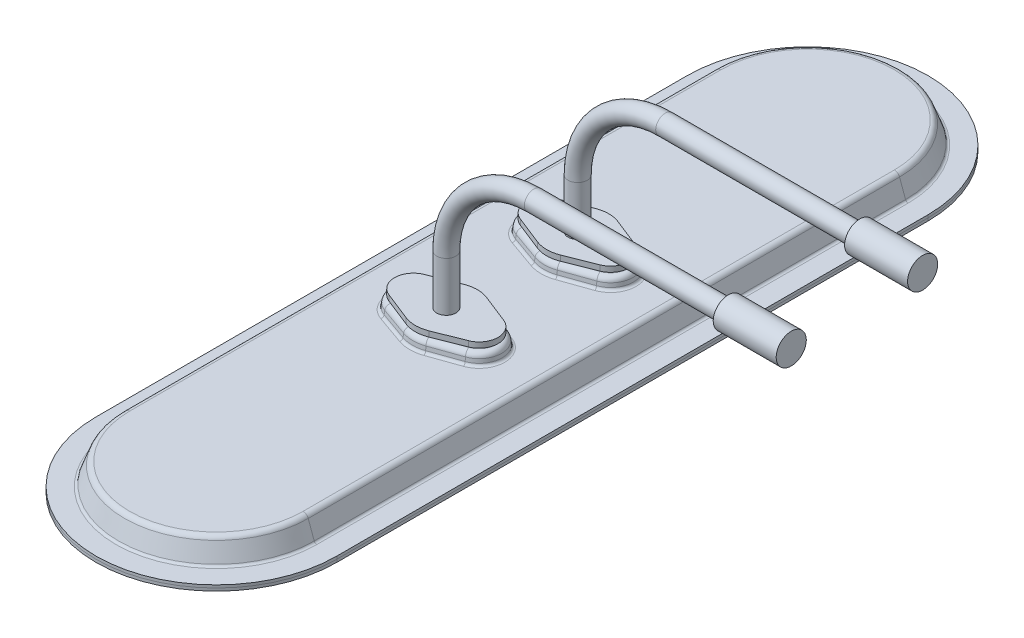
ISO-10303-21;
HEADER;
FILE_DESCRIPTION(('STEP AP214'),'2;1');
FILE_NAME('part.step','',(''),(''),'','','');
FILE_SCHEMA(('AUTOMOTIVE_DESIGN { 1 0 10303 214 1 1 1 1 }'));
ENDSEC;
DATA;
#1=APPLICATION_CONTEXT('core data for automotive mechanical design processes');
#2=APPLICATION_PROTOCOL_DEFINITION('international standard','automotive_design',2000,#1);
#3=PRODUCT_CONTEXT('',#1,'mechanical');
#4=PRODUCT('Part','Part','',(#3));
#5=PRODUCT_RELATED_PRODUCT_CATEGORY('part','',(#4));
#6=PRODUCT_DEFINITION_FORMATION('','',#4);
#7=PRODUCT_DEFINITION_CONTEXT('part definition',#1,'design');
#8=PRODUCT_DEFINITION('design','',#6,#7);
#9=PRODUCT_DEFINITION_SHAPE('','',#8);
#10=(LENGTH_UNIT() NAMED_UNIT(*) SI_UNIT(.MILLI.,.METRE.));
#11=(NAMED_UNIT(*) PLANE_ANGLE_UNIT() SI_UNIT($,.RADIAN.));
#12=(NAMED_UNIT(*) SI_UNIT($,.STERADIAN.) SOLID_ANGLE_UNIT());
#13=UNCERTAINTY_MEASURE_WITH_UNIT(LENGTH_MEASURE(1.E-05),#10,'distance_accuracy_value','');
#14=(GEOMETRIC_REPRESENTATION_CONTEXT(3) GLOBAL_UNCERTAINTY_ASSIGNED_CONTEXT((#13)) GLOBAL_UNIT_ASSIGNED_CONTEXT((#10,
#11,#12)) REPRESENTATION_CONTEXT('',''));
#15=CARTESIAN_POINT('',(0.,0.,0.));
#16=DIRECTION('',(0.,0.,1.));
#17=DIRECTION('',(1.,0.,0.));
#18=AXIS2_PLACEMENT_3D('',#15,#16,#17);
#19=CARTESIAN_POINT('',(0.,51.8,-38.1));
#20=DIRECTION('',(0.,-1.,0.));
#21=DIRECTION('',(0.,0.,-1.));
#22=AXIS2_PLACEMENT_3D('',#19,#20,#21);
#23=CYLINDRICAL_SURFACE('',#22,5.55625);
#24=CARTESIAN_POINT('',(0.,51.8,-38.1));
#25=DIRECTION('',(0.,1.,0.));
#26=DIRECTION('',(0.,0.,1.));
#27=AXIS2_PLACEMENT_3D('',#24,#25,#26);
#28=CIRCLE('',#27,5.55625);
#29=CARTESIAN_POINT('',(-5.55624999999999,51.8,-38.1));
#30=VERTEX_POINT('',#29);
#31=EDGE_CURVE('P0_E181',#30,#30,#28,.T.);
#32=ORIENTED_EDGE('',*,*,#31,.F.);
#33=EDGE_LOOP('',(#32));
#34=FACE_BOUND('',#33,.T.);
#35=CARTESIAN_POINT('',(0.,23.225,-38.1));
#36=DIRECTION('',(0.,-1.,0.));
#37=DIRECTION('',(0.,0.,-1.));
#38=AXIS2_PLACEMENT_3D('',#35,#36,#37);
#39=CIRCLE('',#38,5.55625);
#40=CARTESIAN_POINT('',(0.,23.225,-43.65625));
#41=VERTEX_POINT('',#40);
#42=EDGE_CURVE('P0_E26',#41,#41,#39,.T.);
#43=ORIENTED_EDGE('',*,*,#42,.F.);
#44=EDGE_LOOP('',(#43));
#45=FACE_BOUND('',#44,.T.);
#46=ADVANCED_FACE('P0_F16',(#34,#45),#23,.T.);
#47=CARTESIAN_POINT('',(50.8,102.6,-38.1));
#48=DIRECTION('',(1.,0.,0.));
#49=DIRECTION('',(0.,0.,-1.));
#50=AXIS2_PLACEMENT_3D('',#47,#48,#49);
#51=CYLINDRICAL_SURFACE('',#50,5.55625);
#52=CARTESIAN_POINT('',(163.5125,102.6,-38.1));
#53=DIRECTION('',(-1.,0.,0.));
#54=DIRECTION('',(0.,0.,1.));
#55=AXIS2_PLACEMENT_3D('',#52,#53,#54);
#56=CIRCLE('',#55,5.55625);
#57=CARTESIAN_POINT('',(163.5125,102.6,-32.54375));
#58=VERTEX_POINT('',#57);
#59=EDGE_CURVE('P0_E11',#58,#58,#56,.F.);
#60=ORIENTED_EDGE('',*,*,#59,.F.);
#61=EDGE_LOOP('',(#60));
#62=FACE_BOUND('',#61,.T.);
#63=CARTESIAN_POINT('',(50.8,102.6,-38.1));
#64=DIRECTION('',(1.,0.,0.));
#65=DIRECTION('',(0.,0.,1.));
#66=AXIS2_PLACEMENT_3D('',#63,#64,#65);
#67=CIRCLE('',#66,5.55625);
#68=CARTESIAN_POINT('',(50.8,108.15625,-38.1));
#69=VERTEX_POINT('',#68);
#70=EDGE_CURVE('P0_E200',#69,#69,#67,.T.);
#71=ORIENTED_EDGE('',*,*,#70,.T.);
#72=EDGE_LOOP('',(#71));
#73=FACE_BOUND('',#72,.T.);
#74=ADVANCED_FACE('P0_F18',(#62,#73),#51,.T.);
#75=CARTESIAN_POINT('',(50.8,51.8,-38.1));
#76=DIRECTION('',(0.,0.,-1.));
#77=DIRECTION('',(-1.,0.,0.));
#78=AXIS2_PLACEMENT_3D('',#75,#76,#77);
#79=TOROIDAL_SURFACE('',#78,50.8,5.55625);
#80=CARTESIAN_POINT('',(50.8,51.8,-38.1));
#81=DIRECTION('',(0.,0.,-1.));
#82=DIRECTION('',(-1.,0.,0.));
#83=AXIS2_PLACEMENT_3D('',#80,#81,#82);
#84=CIRCLE('',#83,56.35625);
#85=EDGE_CURVE('',#30,#69,#84,.T.);
#86=ORIENTED_EDGE('',*,*,#31,.T.);
#87=ORIENTED_EDGE('',*,*,#70,.F.);
#88=ORIENTED_EDGE('',*,*,#85,.T.);
#89=ORIENTED_EDGE('',*,*,#85,.F.);
#90=EDGE_LOOP('',(#86,#88,#87,#89));
#91=FACE_BOUND('',#90,.T.);
#92=ADVANCED_FACE('P0_F215',(#91),#79,.T.);
#93=CARTESIAN_POINT('',(0.,23.225,-38.1));
#94=DIRECTION('',(0.,-1.,0.));
#95=DIRECTION('',(0.,0.,-1.));
#96=AXIS2_PLACEMENT_3D('',#93,#94,#95);
#97=PLANE('',#96);
#98=CARTESIAN_POINT('',(0.,23.225,-38.1));
#99=DIRECTION('',(0.,-1.,0.));
#100=DIRECTION('',(0.,0.,-1.));
#101=AXIS2_PLACEMENT_3D('',#98,#99,#100);
#102=CIRCLE('',#101,18.);
#103=CARTESIAN_POINT('',(-6.63157894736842,23.225,-54.8338626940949));
#104=VERTEX_POINT('',#103);
#105=CARTESIAN_POINT('',(6.63157894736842,23.225,-54.8338626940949));
#106=VERTEX_POINT('',#105);
#107=EDGE_CURVE('P0_E178',#104,#106,#102,.T.);
#108=ORIENTED_EDGE('',*,*,#107,.F.);
#109=DIRECTION('',(-0.929659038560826,0.,0.368421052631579));
#110=VECTOR('',#109,1.);
#111=CARTESIAN_POINT('',(-6.63157894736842,23.225,-54.8338626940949));
#112=LINE('',#111,#110);
#113=CARTESIAN_POINT('',(-23.0526315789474,23.225,-48.3262494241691));
#114=VERTEX_POINT('',#113);
#115=EDGE_CURVE('P0_E121',#104,#114,#112,.T.);
#116=ORIENTED_EDGE('',*,*,#115,.T.);
#117=CARTESIAN_POINT('',(-19.,23.225,-38.1));
#118=DIRECTION('',(0.,1.,0.));
#119=DIRECTION('',(0.,0.,1.));
#120=AXIS2_PLACEMENT_3D('',#117,#118,#119);
#121=CIRCLE('',#120,11.);
#122=CARTESIAN_POINT('',(-23.0526315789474,23.225,-27.8737505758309));
#123=VERTEX_POINT('',#122);
#124=EDGE_CURVE('P0_E112',#114,#123,#121,.T.);
#125=ORIENTED_EDGE('',*,*,#124,.T.);
#126=DIRECTION('',(-0.929659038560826,0.,-0.368421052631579));
#127=VECTOR('',#126,1.);
#128=CARTESIAN_POINT('',(-6.63157894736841,23.225,-21.3661373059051));
#129=LINE('',#128,#127);
#130=CARTESIAN_POINT('',(-6.63157894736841,23.225,-21.3661373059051));
#131=VERTEX_POINT('',#130);
#132=EDGE_CURVE('P0_E119',#131,#123,#129,.T.);
#133=ORIENTED_EDGE('',*,*,#132,.F.);
#134=CARTESIAN_POINT('',(0.,23.225,-38.1000000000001));
#135=DIRECTION('',(0.,-1.,0.));
#136=DIRECTION('',(0.,0.,-1.));
#137=AXIS2_PLACEMENT_3D('',#134,#135,#136);
#138=CIRCLE('',#137,18.);
#139=CARTESIAN_POINT('',(6.63157894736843,23.225,-21.3661373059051));
#140=VERTEX_POINT('',#139);
#141=EDGE_CURVE('P0_E139',#140,#131,#138,.T.);
#142=ORIENTED_EDGE('',*,*,#141,.F.);
#143=DIRECTION('',(0.929659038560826,0.,-0.36842105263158));
#144=VECTOR('',#143,1.);
#145=CARTESIAN_POINT('',(6.63157894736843,23.225,-21.3661373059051));
#146=LINE('',#145,#144);
#147=CARTESIAN_POINT('',(23.0526315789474,23.225,-27.8737505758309));
#148=VERTEX_POINT('',#147);
#149=EDGE_CURVE('P0_E144',#140,#148,#146,.T.);
#150=ORIENTED_EDGE('',*,*,#149,.T.);
#151=CARTESIAN_POINT('',(19.,23.225,-38.1));
#152=DIRECTION('',(0.,-1.,0.));
#153=DIRECTION('',(0.,0.,-1.));
#154=AXIS2_PLACEMENT_3D('',#151,#152,#153);
#155=CIRCLE('',#154,11.);
#156=CARTESIAN_POINT('',(23.0526315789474,23.225,-48.3262494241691));
#157=VERTEX_POINT('',#156);
#158=EDGE_CURVE('P0_E269',#157,#148,#155,.T.);
#159=ORIENTED_EDGE('',*,*,#158,.F.);
#160=DIRECTION('',(0.929659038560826,0.,0.368421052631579));
#161=VECTOR('',#160,1.);
#162=CARTESIAN_POINT('',(6.63157894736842,23.225,-54.8338626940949));
#163=LINE('',#162,#161);
#164=EDGE_CURVE('P0_E265',#106,#157,#163,.T.);
#165=ORIENTED_EDGE('',*,*,#164,.F.);
#166=EDGE_LOOP('',(#108,#116,#125,#133,#142,#150,#159,#165));
#167=FACE_BOUND('',#166,.T.);
#168=ORIENTED_EDGE('',*,*,#42,.T.);
#169=EDGE_LOOP('',(#168));
#170=FACE_BOUND('',#169,.T.);
#171=ADVANCED_FACE('P0_F115',(#167,#170),#97,.F.);
#172=CARTESIAN_POINT('',(0.,23.225,-38.1));
#173=DIRECTION('',(0.,-1.,0.));
#174=DIRECTION('',(0.,0.,-1.));
#175=AXIS2_PLACEMENT_3D('',#172,#173,#174);
#176=CYLINDRICAL_SURFACE('',#175,18.);
#177=CARTESIAN_POINT('',(0.,20.05,-38.1));
#178=DIRECTION('',(0.,-1.,0.));
#179=DIRECTION('',(0.,0.,-1.));
#180=AXIS2_PLACEMENT_3D('',#177,#178,#179);
#181=CIRCLE('',#180,18.);
#182=CARTESIAN_POINT('',(-6.63157894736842,20.05,-54.8338626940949));
#183=VERTEX_POINT('',#182);
#184=CARTESIAN_POINT('',(6.63157894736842,20.05,-54.8338626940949));
#185=VERTEX_POINT('',#184);
#186=EDGE_CURVE('P0_E150',#183,#185,#181,.T.);
#187=ORIENTED_EDGE('',*,*,#186,.F.);
#188=DIRECTION('',(0.,-1.,0.));
#189=VECTOR('',#188,1.);
#190=CARTESIAN_POINT('',(-6.63157894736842,23.225,-54.8338626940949));
#191=LINE('',#190,#189);
#192=EDGE_CURVE('P0_E39',#104,#183,#191,.T.);
#193=ORIENTED_EDGE('',*,*,#192,.F.);
#194=ORIENTED_EDGE('',*,*,#107,.T.);
#195=DIRECTION('',(0.,-1.,0.));
#196=VECTOR('',#195,1.);
#197=CARTESIAN_POINT('',(6.63157894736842,23.225,-54.8338626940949));
#198=LINE('',#197,#196);
#199=EDGE_CURVE('P0_E90',#106,#185,#198,.T.);
#200=ORIENTED_EDGE('',*,*,#199,.T.);
#201=EDGE_LOOP('',(#187,#193,#194,#200));
#202=FACE_BOUND('',#201,.T.);
#203=ADVANCED_FACE('P0_F226',(#202),#176,.T.);
#204=CARTESIAN_POINT('',(-6.63157894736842,23.225,-54.8338626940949));
#205=DIRECTION('',(0.368421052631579,0.,0.929659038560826));
#206=DIRECTION('',(0.929659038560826,0.,-0.368421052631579));
#207=AXIS2_PLACEMENT_3D('',#204,#205,#206);
#208=PLANE('',#207);
#209=DIRECTION('',(-0.929659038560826,0.,0.368421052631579));
#210=VECTOR('',#209,1.);
#211=CARTESIAN_POINT('',(-6.63157894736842,20.05,-54.8338626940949));
#212=LINE('',#211,#210);
#213=CARTESIAN_POINT('',(-23.0526315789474,20.05,-48.3262494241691));
#214=VERTEX_POINT('',#213);
#215=EDGE_CURVE('P0_E77',#183,#214,#212,.T.);
#216=ORIENTED_EDGE('',*,*,#215,.T.);
#217=DIRECTION('',(0.,-1.,0.));
#218=VECTOR('',#217,1.);
#219=CARTESIAN_POINT('',(-23.0526315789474,23.225,-48.3262494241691));
#220=LINE('',#219,#218);
#221=EDGE_CURVE('P0_E134',#114,#214,#220,.T.);
#222=ORIENTED_EDGE('',*,*,#221,.F.);
#223=ORIENTED_EDGE('',*,*,#115,.F.);
#224=ORIENTED_EDGE('',*,*,#192,.T.);
#225=EDGE_LOOP('',(#216,#222,#223,#224));
#226=FACE_BOUND('',#225,.T.);
#227=ADVANCED_FACE('P0_F234',(#226),#208,.F.);
#228=CARTESIAN_POINT('',(-19.,23.225,-38.1));
#229=DIRECTION('',(0.,-1.,0.));
#230=DIRECTION('',(0.,0.,-1.));
#231=AXIS2_PLACEMENT_3D('',#228,#229,#230);
#232=CYLINDRICAL_SURFACE('',#231,11.);
#233=CARTESIAN_POINT('',(-19.,20.05,-38.1));
#234=DIRECTION('',(0.,1.,0.));
#235=DIRECTION('',(0.,0.,1.));
#236=AXIS2_PLACEMENT_3D('',#233,#234,#235);
#237=CIRCLE('',#236,11.);
#238=CARTESIAN_POINT('',(-23.0526315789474,20.05,-27.8737505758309));
#239=VERTEX_POINT('',#238);
#240=EDGE_CURVE('P0_E129',#214,#239,#237,.T.);
#241=ORIENTED_EDGE('',*,*,#240,.T.);
#242=DIRECTION('',(0.,-1.,0.));
#243=VECTOR('',#242,1.);
#244=CARTESIAN_POINT('',(-23.0526315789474,23.225,-27.8737505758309));
#245=LINE('',#244,#243);
#246=EDGE_CURVE('P0_E126',#123,#239,#245,.T.);
#247=ORIENTED_EDGE('',*,*,#246,.F.);
#248=ORIENTED_EDGE('',*,*,#124,.F.);
#249=ORIENTED_EDGE('',*,*,#221,.T.);
#250=EDGE_LOOP('',(#241,#247,#248,#249));
#251=FACE_BOUND('',#250,.T.);
#252=ADVANCED_FACE('P0_F127',(#251),#232,.T.);
#253=CARTESIAN_POINT('',(-6.63157894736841,23.225,-21.3661373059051));
#254=DIRECTION('',(-0.368421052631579,0.,0.929659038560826));
#255=DIRECTION('',(0.929659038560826,0.,0.368421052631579));
#256=AXIS2_PLACEMENT_3D('',#253,#254,#255);
#257=PLANE('',#256);
#258=DIRECTION('',(-0.929659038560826,0.,-0.368421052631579));
#259=VECTOR('',#258,1.);
#260=CARTESIAN_POINT('',(-6.63157894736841,20.05,-21.3661373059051));
#261=LINE('',#260,#259);
#262=CARTESIAN_POINT('',(-6.63157894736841,20.05,-21.3661373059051));
#263=VERTEX_POINT('',#262);
#264=EDGE_CURVE('P0_E171',#263,#239,#261,.T.);
#265=ORIENTED_EDGE('',*,*,#264,.F.);
#266=DIRECTION('',(0.,-1.,0.));
#267=VECTOR('',#266,1.);
#268=CARTESIAN_POINT('',(-6.63157894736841,23.225,-21.3661373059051));
#269=LINE('',#268,#267);
#270=EDGE_CURVE('P0_E135',#131,#263,#269,.T.);
#271=ORIENTED_EDGE('',*,*,#270,.F.);
#272=ORIENTED_EDGE('',*,*,#132,.T.);
#273=ORIENTED_EDGE('',*,*,#246,.T.);
#274=EDGE_LOOP('',(#265,#271,#272,#273));
#275=FACE_BOUND('',#274,.T.);
#276=ADVANCED_FACE('P0_F137',(#275),#257,.T.);
#277=CARTESIAN_POINT('',(0.,23.225,-38.1000000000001));
#278=DIRECTION('',(0.,-1.,0.));
#279=DIRECTION('',(0.,0.,-1.));
#280=AXIS2_PLACEMENT_3D('',#277,#278,#279);
#281=CYLINDRICAL_SURFACE('',#280,18.);
#282=CARTESIAN_POINT('',(0.,20.05,-38.1000000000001));
#283=DIRECTION('',(0.,-1.,0.));
#284=DIRECTION('',(0.,0.,-1.));
#285=AXIS2_PLACEMENT_3D('',#282,#283,#284);
#286=CIRCLE('',#285,18.);
#287=CARTESIAN_POINT('',(6.63157894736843,20.05,-21.3661373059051));
#288=VERTEX_POINT('',#287);
#289=EDGE_CURVE('P0_E167',#288,#263,#286,.T.);
#290=ORIENTED_EDGE('',*,*,#289,.F.);
#291=DIRECTION('',(0.,-1.,0.));
#292=VECTOR('',#291,1.);
#293=CARTESIAN_POINT('',(6.63157894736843,23.225,-21.3661373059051));
#294=LINE('',#293,#292);
#295=EDGE_CURVE('P0_E186',#140,#288,#294,.T.);
#296=ORIENTED_EDGE('',*,*,#295,.F.);
#297=ORIENTED_EDGE('',*,*,#141,.T.);
#298=ORIENTED_EDGE('',*,*,#270,.T.);
#299=EDGE_LOOP('',(#290,#296,#297,#298));
#300=FACE_BOUND('',#299,.T.);
#301=ADVANCED_FACE('P0_F245',(#300),#281,.T.);
#302=CARTESIAN_POINT('',(6.63157894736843,23.225,-21.3661373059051));
#303=DIRECTION('',(-0.36842105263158,0.,-0.929659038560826));
#304=DIRECTION('',(-0.929659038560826,0.,0.36842105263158));
#305=AXIS2_PLACEMENT_3D('',#302,#303,#304);
#306=PLANE('',#305);
#307=DIRECTION('',(0.929659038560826,0.,-0.36842105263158));
#308=VECTOR('',#307,1.);
#309=CARTESIAN_POINT('',(6.63157894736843,20.05,-21.3661373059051));
#310=LINE('',#309,#308);
#311=CARTESIAN_POINT('',(23.0526315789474,20.05,-27.8737505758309));
#312=VERTEX_POINT('',#311);
#313=EDGE_CURVE('P0_E163',#288,#312,#310,.T.);
#314=ORIENTED_EDGE('',*,*,#313,.T.);
#315=DIRECTION('',(0.,-1.,0.));
#316=VECTOR('',#315,1.);
#317=CARTESIAN_POINT('',(23.0526315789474,23.225,-27.8737505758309));
#318=LINE('',#317,#316);
#319=EDGE_CURVE('P0_E189',#148,#312,#318,.T.);
#320=ORIENTED_EDGE('',*,*,#319,.F.);
#321=ORIENTED_EDGE('',*,*,#149,.F.);
#322=ORIENTED_EDGE('',*,*,#295,.T.);
#323=EDGE_LOOP('',(#314,#320,#321,#322));
#324=FACE_BOUND('',#323,.T.);
#325=ADVANCED_FACE('P0_F248',(#324),#306,.F.);
#326=CARTESIAN_POINT('',(19.,23.225,-38.1));
#327=DIRECTION('',(0.,-1.,0.));
#328=DIRECTION('',(0.,0.,-1.));
#329=AXIS2_PLACEMENT_3D('',#326,#327,#328);
#330=CYLINDRICAL_SURFACE('',#329,11.);
#331=CARTESIAN_POINT('',(19.,20.05,-38.1));
#332=DIRECTION('',(0.,-1.,0.));
#333=DIRECTION('',(0.,0.,-1.));
#334=AXIS2_PLACEMENT_3D('',#331,#332,#333);
#335=CIRCLE('',#334,11.);
#336=CARTESIAN_POINT('',(23.0526315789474,20.05,-48.3262494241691));
#337=VERTEX_POINT('',#336);
#338=EDGE_CURVE('P0_E159',#337,#312,#335,.T.);
#339=ORIENTED_EDGE('',*,*,#338,.F.);
#340=DIRECTION('',(0.,-1.,0.));
#341=VECTOR('',#340,1.);
#342=CARTESIAN_POINT('',(23.0526315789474,23.225,-48.3262494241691));
#343=LINE('',#342,#341);
#344=EDGE_CURVE('P0_E192',#157,#337,#343,.T.);
#345=ORIENTED_EDGE('',*,*,#344,.F.);
#346=ORIENTED_EDGE('',*,*,#158,.T.);
#347=ORIENTED_EDGE('',*,*,#319,.T.);
#348=EDGE_LOOP('',(#339,#345,#346,#347));
#349=FACE_BOUND('',#348,.T.);
#350=ADVANCED_FACE('P0_F252',(#349),#330,.T.);
#351=CARTESIAN_POINT('',(6.63157894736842,23.225,-54.8338626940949));
#352=DIRECTION('',(0.368421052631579,0.,-0.929659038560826));
#353=DIRECTION('',(-0.929659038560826,0.,-0.368421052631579));
#354=AXIS2_PLACEMENT_3D('',#351,#352,#353);
#355=PLANE('',#354);
#356=DIRECTION('',(0.929659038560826,0.,0.368421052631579));
#357=VECTOR('',#356,1.);
#358=CARTESIAN_POINT('',(6.63157894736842,20.05,-54.8338626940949));
#359=LINE('',#358,#357);
#360=EDGE_CURVE('P0_E154',#185,#337,#359,.T.);
#361=ORIENTED_EDGE('',*,*,#360,.F.);
#362=ORIENTED_EDGE('',*,*,#199,.F.);
#363=ORIENTED_EDGE('',*,*,#164,.T.);
#364=ORIENTED_EDGE('',*,*,#344,.T.);
#365=EDGE_LOOP('',(#361,#362,#363,#364));
#366=FACE_BOUND('',#365,.T.);
#367=ADVANCED_FACE('P0_F256',(#366),#355,.T.);
#368=CARTESIAN_POINT('',(0.,20.05,-38.1));
#369=DIRECTION('',(0.,1.,0.));
#370=DIRECTION('',(0.,0.,1.));
#371=AXIS2_PLACEMENT_3D('',#368,#369,#370);
#372=PLANE('',#371);
#373=ORIENTED_EDGE('',*,*,#186,.T.);
#374=ORIENTED_EDGE('',*,*,#360,.T.);
#375=ORIENTED_EDGE('',*,*,#338,.T.);
#376=ORIENTED_EDGE('',*,*,#313,.F.);
#377=ORIENTED_EDGE('',*,*,#289,.T.);
#378=ORIENTED_EDGE('',*,*,#264,.T.);
#379=ORIENTED_EDGE('',*,*,#240,.F.);
#380=ORIENTED_EDGE('',*,*,#215,.F.);
#381=EDGE_LOOP('',(#373,#374,#375,#376,#377,#378,#379,#380));
#382=FACE_BOUND('',#381,.T.);
#383=ADVANCED_FACE('P0_F219',(#382),#372,.F.);
#384=CARTESIAN_POINT('',(200.025,102.6,-46.83125));
#385=DIRECTION('',(1.,0.,0.));
#386=DIRECTION('',(0.,0.,-1.));
#387=AXIS2_PLACEMENT_3D('',#384,#385,#386);
#388=PLANE('',#387);
#389=CARTESIAN_POINT('',(200.025,102.6,-38.1));
#390=DIRECTION('',(-1.,0.,0.));
#391=DIRECTION('',(0.,0.,1.));
#392=AXIS2_PLACEMENT_3D('',#389,#390,#391);
#393=CIRCLE('',#392,8.73125000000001);
#394=CARTESIAN_POINT('',(200.025,102.6,-29.36875));
#395=VERTEX_POINT('',#394);
#396=EDGE_CURVE('P0_E155',#395,#395,#393,.T.);
#397=ORIENTED_EDGE('',*,*,#396,.F.);
#398=EDGE_LOOP('',(#397));
#399=FACE_BOUND('',#398,.T.);
#400=ADVANCED_FACE('P0_F237',(#399),#388,.T.);
#401=CARTESIAN_POINT('',(165.1,102.6,-38.1));
#402=DIRECTION('',(-1.,0.,0.));
#403=DIRECTION('',(0.,0.,1.));
#404=AXIS2_PLACEMENT_3D('',#401,#402,#403);
#405=CYLINDRICAL_SURFACE('',#404,8.73125);
#406=ORIENTED_EDGE('',*,*,#396,.T.);
#407=EDGE_LOOP('',(#406));
#408=FACE_BOUND('',#407,.T.);
#409=CARTESIAN_POINT('',(163.5125,102.6,-38.1));
#410=DIRECTION('',(-1.,0.,0.));
#411=DIRECTION('',(0.,0.,1.));
#412=AXIS2_PLACEMENT_3D('',#409,#410,#411);
#413=CIRCLE('',#412,8.73125);
#414=CARTESIAN_POINT('',(163.5125,102.6,-29.36875));
#415=VERTEX_POINT('',#414);
#416=EDGE_CURVE('P0_E314',#415,#415,#413,.T.);
#417=ORIENTED_EDGE('',*,*,#416,.F.);
#418=EDGE_LOOP('',(#417));
#419=FACE_BOUND('',#418,.T.);
#420=ADVANCED_FACE('P0_F322',(#408,#419),#405,.T.);
#421=CARTESIAN_POINT('',(163.5125,102.6,-38.1));
#422=DIRECTION('',(-1.,0.,0.));
#423=DIRECTION('',(0.,0.,1.));
#424=AXIS2_PLACEMENT_3D('',#421,#422,#423);
#425=PLANE('',#424);
#426=ORIENTED_EDGE('',*,*,#59,.T.);
#427=EDGE_LOOP('',(#426));
#428=FACE_BOUND('',#427,.T.);
#429=ORIENTED_EDGE('',*,*,#416,.T.);
#430=EDGE_LOOP('',(#429));
#431=FACE_BOUND('',#430,.T.);
#432=ADVANCED_FACE('P0_F320',(#428,#431),#425,.T.);
#433=CLOSED_SHELL('',(#46,#74,#92,#171,#203,#227,#252,#276,#301,#325,#350,#367,#383,#400,#420,#432));
#434=MANIFOLD_SOLID_BREP('P0_B1',#433);
#435=CARTESIAN_POINT('',(0.,51.8,38.1));
#436=DIRECTION('',(0.,-1.,0.));
#437=DIRECTION('',(0.,0.,-1.));
#438=AXIS2_PLACEMENT_3D('',#435,#436,#437);
#439=CYLINDRICAL_SURFACE('',#438,5.55625);
#440=CARTESIAN_POINT('',(0.,51.8,38.1));
#441=DIRECTION('',(0.,1.,0.));
#442=DIRECTION('',(0.,0.,1.));
#443=AXIS2_PLACEMENT_3D('',#440,#441,#442);
#444=CIRCLE('',#443,5.55625);
#445=CARTESIAN_POINT('',(-5.55624999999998,51.8,38.1));
#446=VERTEX_POINT('',#445);
#447=EDGE_CURVE('P1_E181',#446,#446,#444,.T.);
#448=ORIENTED_EDGE('',*,*,#447,.F.);
#449=EDGE_LOOP('',(#448));
#450=FACE_BOUND('',#449,.T.);
#451=CARTESIAN_POINT('',(0.,23.225,38.1));
#452=DIRECTION('',(0.,-1.,0.));
#453=DIRECTION('',(0.,0.,-1.));
#454=AXIS2_PLACEMENT_3D('',#451,#452,#453);
#455=CIRCLE('',#454,5.55625);
#456=CARTESIAN_POINT('',(0.,23.225,32.54375));
#457=VERTEX_POINT('',#456);
#458=EDGE_CURVE('P1_E26',#457,#457,#455,.T.);
#459=ORIENTED_EDGE('',*,*,#458,.F.);
#460=EDGE_LOOP('',(#459));
#461=FACE_BOUND('',#460,.T.);
#462=ADVANCED_FACE('P1_F16',(#450,#461),#439,.T.);
#463=CARTESIAN_POINT('',(50.8,102.6,38.1));
#464=DIRECTION('',(1.,0.,0.));
#465=DIRECTION('',(0.,0.,-1.));
#466=AXIS2_PLACEMENT_3D('',#463,#464,#465);
#467=CYLINDRICAL_SURFACE('',#466,5.55625);
#468=CARTESIAN_POINT('',(163.5125,102.6,38.1));
#469=DIRECTION('',(-1.,0.,0.));
#470=DIRECTION('',(0.,0.,1.));
#471=AXIS2_PLACEMENT_3D('',#468,#469,#470);
#472=CIRCLE('',#471,5.55625);
#473=CARTESIAN_POINT('',(163.5125,102.6,43.65625));
#474=VERTEX_POINT('',#473);
#475=EDGE_CURVE('P1_E11',#474,#474,#472,.F.);
#476=ORIENTED_EDGE('',*,*,#475,.F.);
#477=EDGE_LOOP('',(#476));
#478=FACE_BOUND('',#477,.T.);
#479=CARTESIAN_POINT('',(50.8,102.6,38.1));
#480=DIRECTION('',(1.,0.,0.));
#481=DIRECTION('',(0.,0.,1.));
#482=AXIS2_PLACEMENT_3D('',#479,#480,#481);
#483=CIRCLE('',#482,5.55625);
#484=CARTESIAN_POINT('',(50.8,108.15625,38.1));
#485=VERTEX_POINT('',#484);
#486=EDGE_CURVE('P1_E200',#485,#485,#483,.T.);
#487=ORIENTED_EDGE('',*,*,#486,.T.);
#488=EDGE_LOOP('',(#487));
#489=FACE_BOUND('',#488,.T.);
#490=ADVANCED_FACE('P1_F18',(#478,#489),#467,.T.);
#491=CARTESIAN_POINT('',(50.8,51.8,38.1));
#492=DIRECTION('',(0.,0.,-1.));
#493=DIRECTION('',(-1.,0.,0.));
#494=AXIS2_PLACEMENT_3D('',#491,#492,#493);
#495=TOROIDAL_SURFACE('',#494,50.8,5.55625);
#496=CARTESIAN_POINT('',(50.8,51.8,38.1));
#497=DIRECTION('',(0.,0.,-1.));
#498=DIRECTION('',(-1.,0.,0.));
#499=AXIS2_PLACEMENT_3D('',#496,#497,#498);
#500=CIRCLE('',#499,56.35625);
#501=EDGE_CURVE('',#446,#485,#500,.T.);
#502=ORIENTED_EDGE('',*,*,#447,.T.);
#503=ORIENTED_EDGE('',*,*,#486,.F.);
#504=ORIENTED_EDGE('',*,*,#501,.T.);
#505=ORIENTED_EDGE('',*,*,#501,.F.);
#506=EDGE_LOOP('',(#502,#504,#503,#505));
#507=FACE_BOUND('',#506,.T.);
#508=ADVANCED_FACE('P1_F215',(#507),#495,.T.);
#509=CARTESIAN_POINT('',(0.,23.225,38.1));
#510=DIRECTION('',(0.,-1.,0.));
#511=DIRECTION('',(0.,0.,-1.));
#512=AXIS2_PLACEMENT_3D('',#509,#510,#511);
#513=PLANE('',#512);
#514=CARTESIAN_POINT('',(0.,23.225,38.1));
#515=DIRECTION('',(0.,-1.,0.));
#516=DIRECTION('',(0.,0.,-1.));
#517=AXIS2_PLACEMENT_3D('',#514,#515,#516);
#518=CIRCLE('',#517,18.);
#519=CARTESIAN_POINT('',(-6.63157894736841,23.225,21.3661373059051));
#520=VERTEX_POINT('',#519);
#521=CARTESIAN_POINT('',(6.63157894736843,23.225,21.3661373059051));
#522=VERTEX_POINT('',#521);
#523=EDGE_CURVE('P1_E178',#520,#522,#518,.T.);
#524=ORIENTED_EDGE('',*,*,#523,.F.);
#525=DIRECTION('',(-0.929659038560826,0.,0.368421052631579));
#526=VECTOR('',#525,1.);
#527=CARTESIAN_POINT('',(-6.63157894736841,23.225,21.3661373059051));
#528=LINE('',#527,#526);
#529=CARTESIAN_POINT('',(-23.0526315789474,23.225,27.8737505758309));
#530=VERTEX_POINT('',#529);
#531=EDGE_CURVE('P1_E121',#520,#530,#528,.T.);
#532=ORIENTED_EDGE('',*,*,#531,.T.);
#533=CARTESIAN_POINT('',(-19.,23.225,38.1));
#534=DIRECTION('',(0.,1.,0.));
#535=DIRECTION('',(0.,0.,1.));
#536=AXIS2_PLACEMENT_3D('',#533,#534,#535);
#537=CIRCLE('',#536,11.);
#538=CARTESIAN_POINT('',(-23.0526315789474,23.225,48.3262494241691));
#539=VERTEX_POINT('',#538);
#540=EDGE_CURVE('P1_E112',#530,#539,#537,.T.);
#541=ORIENTED_EDGE('',*,*,#540,.T.);
#542=DIRECTION('',(-0.929659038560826,0.,-0.368421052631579));
#543=VECTOR('',#542,1.);
#544=CARTESIAN_POINT('',(-6.63157894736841,23.225,54.8338626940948));
#545=LINE('',#544,#543);
#546=CARTESIAN_POINT('',(-6.63157894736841,23.225,54.8338626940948));
#547=VERTEX_POINT('',#546);
#548=EDGE_CURVE('P1_E119',#547,#539,#545,.T.);
#549=ORIENTED_EDGE('',*,*,#548,.F.);
#550=CARTESIAN_POINT('',(0.,23.225,38.0999999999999));
#551=DIRECTION('',(0.,-1.,0.));
#552=DIRECTION('',(0.,0.,-1.));
#553=AXIS2_PLACEMENT_3D('',#550,#551,#552);
#554=CIRCLE('',#553,18.);
#555=CARTESIAN_POINT('',(6.63157894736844,23.225,54.8338626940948));
#556=VERTEX_POINT('',#555);
#557=EDGE_CURVE('P1_E139',#556,#547,#554,.T.);
#558=ORIENTED_EDGE('',*,*,#557,.F.);
#559=DIRECTION('',(0.929659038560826,0.,-0.36842105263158));
#560=VECTOR('',#559,1.);
#561=CARTESIAN_POINT('',(6.63157894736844,23.225,54.8338626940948));
#562=LINE('',#561,#560);
#563=CARTESIAN_POINT('',(23.0526315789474,23.225,48.326249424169));
#564=VERTEX_POINT('',#563);
#565=EDGE_CURVE('P1_E144',#556,#564,#562,.T.);
#566=ORIENTED_EDGE('',*,*,#565,.T.);
#567=CARTESIAN_POINT('',(19.,23.225,38.1));
#568=DIRECTION('',(0.,-1.,0.));
#569=DIRECTION('',(0.,0.,-1.));
#570=AXIS2_PLACEMENT_3D('',#567,#568,#569);
#571=CIRCLE('',#570,11.);
#572=CARTESIAN_POINT('',(23.0526315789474,23.225,27.8737505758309));
#573=VERTEX_POINT('',#572);
#574=EDGE_CURVE('P1_E269',#573,#564,#571,.T.);
#575=ORIENTED_EDGE('',*,*,#574,.F.);
#576=DIRECTION('',(0.929659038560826,0.,0.368421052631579));
#577=VECTOR('',#576,1.);
#578=CARTESIAN_POINT('',(6.63157894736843,23.225,21.3661373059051));
#579=LINE('',#578,#577);
#580=EDGE_CURVE('P1_E265',#522,#573,#579,.T.);
#581=ORIENTED_EDGE('',*,*,#580,.F.);
#582=EDGE_LOOP('',(#524,#532,#541,#549,#558,#566,#575,#581));
#583=FACE_BOUND('',#582,.T.);
#584=ORIENTED_EDGE('',*,*,#458,.T.);
#585=EDGE_LOOP('',(#584));
#586=FACE_BOUND('',#585,.T.);
#587=ADVANCED_FACE('P1_F115',(#583,#586),#513,.F.);
#588=CARTESIAN_POINT('',(0.,23.225,38.1));
#589=DIRECTION('',(0.,-1.,0.));
#590=DIRECTION('',(0.,0.,-1.));
#591=AXIS2_PLACEMENT_3D('',#588,#589,#590);
#592=CYLINDRICAL_SURFACE('',#591,18.);
#593=CARTESIAN_POINT('',(0.,20.05,38.1));
#594=DIRECTION('',(0.,-1.,0.));
#595=DIRECTION('',(0.,0.,-1.));
#596=AXIS2_PLACEMENT_3D('',#593,#594,#595);
#597=CIRCLE('',#596,18.);
#598=CARTESIAN_POINT('',(-6.63157894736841,20.05,21.3661373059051));
#599=VERTEX_POINT('',#598);
#600=CARTESIAN_POINT('',(6.63157894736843,20.05,21.3661373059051));
#601=VERTEX_POINT('',#600);
#602=EDGE_CURVE('P1_E150',#599,#601,#597,.T.);
#603=ORIENTED_EDGE('',*,*,#602,.F.);
#604=DIRECTION('',(0.,-1.,0.));
#605=VECTOR('',#604,1.);
#606=CARTESIAN_POINT('',(-6.63157894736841,23.225,21.3661373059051));
#607=LINE('',#606,#605);
#608=EDGE_CURVE('P1_E39',#520,#599,#607,.T.);
#609=ORIENTED_EDGE('',*,*,#608,.F.);
#610=ORIENTED_EDGE('',*,*,#523,.T.);
#611=DIRECTION('',(0.,-1.,0.));
#612=VECTOR('',#611,1.);
#613=CARTESIAN_POINT('',(6.63157894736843,23.225,21.3661373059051));
#614=LINE('',#613,#612);
#615=EDGE_CURVE('P1_E90',#522,#601,#614,.T.);
#616=ORIENTED_EDGE('',*,*,#615,.T.);
#617=EDGE_LOOP('',(#603,#609,#610,#616));
#618=FACE_BOUND('',#617,.T.);
#619=ADVANCED_FACE('P1_F226',(#618),#592,.T.);
#620=CARTESIAN_POINT('',(-6.63157894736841,23.225,21.3661373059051));
#621=DIRECTION('',(0.368421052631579,0.,0.929659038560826));
#622=DIRECTION('',(0.929659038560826,0.,-0.368421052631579));
#623=AXIS2_PLACEMENT_3D('',#620,#621,#622);
#624=PLANE('',#623);
#625=DIRECTION('',(-0.929659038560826,0.,0.368421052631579));
#626=VECTOR('',#625,1.);
#627=CARTESIAN_POINT('',(-6.63157894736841,20.05,21.3661373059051));
#628=LINE('',#627,#626);
#629=CARTESIAN_POINT('',(-23.0526315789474,20.05,27.8737505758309));
#630=VERTEX_POINT('',#629);
#631=EDGE_CURVE('P1_E77',#599,#630,#628,.T.);
#632=ORIENTED_EDGE('',*,*,#631,.T.);
#633=DIRECTION('',(0.,-1.,0.));
#634=VECTOR('',#633,1.);
#635=CARTESIAN_POINT('',(-23.0526315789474,23.225,27.8737505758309));
#636=LINE('',#635,#634);
#637=EDGE_CURVE('P1_E134',#530,#630,#636,.T.);
#638=ORIENTED_EDGE('',*,*,#637,.F.);
#639=ORIENTED_EDGE('',*,*,#531,.F.);
#640=ORIENTED_EDGE('',*,*,#608,.T.);
#641=EDGE_LOOP('',(#632,#638,#639,#640));
#642=FACE_BOUND('',#641,.T.);
#643=ADVANCED_FACE('P1_F234',(#642),#624,.F.);
#644=CARTESIAN_POINT('',(-19.,23.225,38.1));
#645=DIRECTION('',(0.,-1.,0.));
#646=DIRECTION('',(0.,0.,-1.));
#647=AXIS2_PLACEMENT_3D('',#644,#645,#646);
#648=CYLINDRICAL_SURFACE('',#647,11.);
#649=CARTESIAN_POINT('',(-19.,20.05,38.1));
#650=DIRECTION('',(0.,1.,0.));
#651=DIRECTION('',(0.,0.,1.));
#652=AXIS2_PLACEMENT_3D('',#649,#650,#651);
#653=CIRCLE('',#652,11.);
#654=CARTESIAN_POINT('',(-23.0526315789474,20.05,48.3262494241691));
#655=VERTEX_POINT('',#654);
#656=EDGE_CURVE('P1_E129',#630,#655,#653,.T.);
#657=ORIENTED_EDGE('',*,*,#656,.T.);
#658=DIRECTION('',(0.,-1.,0.));
#659=VECTOR('',#658,1.);
#660=CARTESIAN_POINT('',(-23.0526315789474,23.225,48.3262494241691));
#661=LINE('',#660,#659);
#662=EDGE_CURVE('P1_E126',#539,#655,#661,.T.);
#663=ORIENTED_EDGE('',*,*,#662,.F.);
#664=ORIENTED_EDGE('',*,*,#540,.F.);
#665=ORIENTED_EDGE('',*,*,#637,.T.);
#666=EDGE_LOOP('',(#657,#663,#664,#665));
#667=FACE_BOUND('',#666,.T.);
#668=ADVANCED_FACE('P1_F127',(#667),#648,.T.);
#669=CARTESIAN_POINT('',(-6.63157894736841,23.225,54.8338626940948));
#670=DIRECTION('',(-0.368421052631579,0.,0.929659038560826));
#671=DIRECTION('',(0.929659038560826,0.,0.368421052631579));
#672=AXIS2_PLACEMENT_3D('',#669,#670,#671);
#673=PLANE('',#672);
#674=DIRECTION('',(-0.929659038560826,0.,-0.368421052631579));
#675=VECTOR('',#674,1.);
#676=CARTESIAN_POINT('',(-6.63157894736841,20.05,54.8338626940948));
#677=LINE('',#676,#675);
#678=CARTESIAN_POINT('',(-6.63157894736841,20.05,54.8338626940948));
#679=VERTEX_POINT('',#678);
#680=EDGE_CURVE('P1_E171',#679,#655,#677,.T.);
#681=ORIENTED_EDGE('',*,*,#680,.F.);
#682=DIRECTION('',(0.,-1.,0.));
#683=VECTOR('',#682,1.);
#684=CARTESIAN_POINT('',(-6.63157894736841,23.225,54.8338626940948));
#685=LINE('',#684,#683);
#686=EDGE_CURVE('P1_E135',#547,#679,#685,.T.);
#687=ORIENTED_EDGE('',*,*,#686,.F.);
#688=ORIENTED_EDGE('',*,*,#548,.T.);
#689=ORIENTED_EDGE('',*,*,#662,.T.);
#690=EDGE_LOOP('',(#681,#687,#688,#689));
#691=FACE_BOUND('',#690,.T.);
#692=ADVANCED_FACE('P1_F137',(#691),#673,.T.);
#693=CARTESIAN_POINT('',(0.,23.225,38.0999999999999));
#694=DIRECTION('',(0.,-1.,0.));
#695=DIRECTION('',(0.,0.,-1.));
#696=AXIS2_PLACEMENT_3D('',#693,#694,#695);
#697=CYLINDRICAL_SURFACE('',#696,18.);
#698=CARTESIAN_POINT('',(0.,20.05,38.0999999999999));
#699=DIRECTION('',(0.,-1.,0.));
#700=DIRECTION('',(0.,0.,-1.));
#701=AXIS2_PLACEMENT_3D('',#698,#699,#700);
#702=CIRCLE('',#701,18.);
#703=CARTESIAN_POINT('',(6.63157894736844,20.05,54.8338626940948));
#704=VERTEX_POINT('',#703);
#705=EDGE_CURVE('P1_E167',#704,#679,#702,.T.);
#706=ORIENTED_EDGE('',*,*,#705,.F.);
#707=DIRECTION('',(0.,-1.,0.));
#708=VECTOR('',#707,1.);
#709=CARTESIAN_POINT('',(6.63157894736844,23.225,54.8338626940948));
#710=LINE('',#709,#708);
#711=EDGE_CURVE('P1_E186',#556,#704,#710,.T.);
#712=ORIENTED_EDGE('',*,*,#711,.F.);
#713=ORIENTED_EDGE('',*,*,#557,.T.);
#714=ORIENTED_EDGE('',*,*,#686,.T.);
#715=EDGE_LOOP('',(#706,#712,#713,#714));
#716=FACE_BOUND('',#715,.T.);
#717=ADVANCED_FACE('P1_F245',(#716),#697,.T.);
#718=CARTESIAN_POINT('',(6.63157894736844,23.225,54.8338626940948));
#719=DIRECTION('',(-0.36842105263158,0.,-0.929659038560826));
#720=DIRECTION('',(-0.929659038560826,0.,0.36842105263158));
#721=AXIS2_PLACEMENT_3D('',#718,#719,#720);
#722=PLANE('',#721);
#723=DIRECTION('',(0.929659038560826,0.,-0.36842105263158));
#724=VECTOR('',#723,1.);
#725=CARTESIAN_POINT('',(6.63157894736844,20.05,54.8338626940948));
#726=LINE('',#725,#724);
#727=CARTESIAN_POINT('',(23.0526315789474,20.05,48.326249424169));
#728=VERTEX_POINT('',#727);
#729=EDGE_CURVE('P1_E163',#704,#728,#726,.T.);
#730=ORIENTED_EDGE('',*,*,#729,.T.);
#731=DIRECTION('',(0.,-1.,0.));
#732=VECTOR('',#731,1.);
#733=CARTESIAN_POINT('',(23.0526315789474,23.225,48.326249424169));
#734=LINE('',#733,#732);
#735=EDGE_CURVE('P1_E189',#564,#728,#734,.T.);
#736=ORIENTED_EDGE('',*,*,#735,.F.);
#737=ORIENTED_EDGE('',*,*,#565,.F.);
#738=ORIENTED_EDGE('',*,*,#711,.T.);
#739=EDGE_LOOP('',(#730,#736,#737,#738));
#740=FACE_BOUND('',#739,.T.);
#741=ADVANCED_FACE('P1_F248',(#740),#722,.F.);
#742=CARTESIAN_POINT('',(19.,23.225,38.1));
#743=DIRECTION('',(0.,-1.,0.));
#744=DIRECTION('',(0.,0.,-1.));
#745=AXIS2_PLACEMENT_3D('',#742,#743,#744);
#746=CYLINDRICAL_SURFACE('',#745,11.);
#747=CARTESIAN_POINT('',(19.,20.05,38.1));
#748=DIRECTION('',(0.,-1.,0.));
#749=DIRECTION('',(0.,0.,-1.));
#750=AXIS2_PLACEMENT_3D('',#747,#748,#749);
#751=CIRCLE('',#750,11.);
#752=CARTESIAN_POINT('',(23.0526315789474,20.05,27.8737505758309));
#753=VERTEX_POINT('',#752);
#754=EDGE_CURVE('P1_E159',#753,#728,#751,.T.);
#755=ORIENTED_EDGE('',*,*,#754,.F.);
#756=DIRECTION('',(0.,-1.,0.));
#757=VECTOR('',#756,1.);
#758=CARTESIAN_POINT('',(23.0526315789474,23.225,27.8737505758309));
#759=LINE('',#758,#757);
#760=EDGE_CURVE('P1_E192',#573,#753,#759,.T.);
#761=ORIENTED_EDGE('',*,*,#760,.F.);
#762=ORIENTED_EDGE('',*,*,#574,.T.);
#763=ORIENTED_EDGE('',*,*,#735,.T.);
#764=EDGE_LOOP('',(#755,#761,#762,#763));
#765=FACE_BOUND('',#764,.T.);
#766=ADVANCED_FACE('P1_F252',(#765),#746,.T.);
#767=CARTESIAN_POINT('',(6.63157894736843,23.225,21.3661373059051));
#768=DIRECTION('',(0.368421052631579,0.,-0.929659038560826));
#769=DIRECTION('',(-0.929659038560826,0.,-0.368421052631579));
#770=AXIS2_PLACEMENT_3D('',#767,#768,#769);
#771=PLANE('',#770);
#772=DIRECTION('',(0.929659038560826,0.,0.368421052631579));
#773=VECTOR('',#772,1.);
#774=CARTESIAN_POINT('',(6.63157894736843,20.05,21.3661373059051));
#775=LINE('',#774,#773);
#776=EDGE_CURVE('P1_E154',#601,#753,#775,.T.);
#777=ORIENTED_EDGE('',*,*,#776,.F.);
#778=ORIENTED_EDGE('',*,*,#615,.F.);
#779=ORIENTED_EDGE('',*,*,#580,.T.);
#780=ORIENTED_EDGE('',*,*,#760,.T.);
#781=EDGE_LOOP('',(#777,#778,#779,#780));
#782=FACE_BOUND('',#781,.T.);
#783=ADVANCED_FACE('P1_F256',(#782),#771,.T.);
#784=CARTESIAN_POINT('',(0.,20.05,38.1));
#785=DIRECTION('',(0.,1.,0.));
#786=DIRECTION('',(0.,0.,1.));
#787=AXIS2_PLACEMENT_3D('',#784,#785,#786);
#788=PLANE('',#787);
#789=ORIENTED_EDGE('',*,*,#602,.T.);
#790=ORIENTED_EDGE('',*,*,#776,.T.);
#791=ORIENTED_EDGE('',*,*,#754,.T.);
#792=ORIENTED_EDGE('',*,*,#729,.F.);
#793=ORIENTED_EDGE('',*,*,#705,.T.);
#794=ORIENTED_EDGE('',*,*,#680,.T.);
#795=ORIENTED_EDGE('',*,*,#656,.F.);
#796=ORIENTED_EDGE('',*,*,#631,.F.);
#797=EDGE_LOOP('',(#789,#790,#791,#792,#793,#794,#795,#796));
#798=FACE_BOUND('',#797,.T.);
#799=ADVANCED_FACE('P1_F219',(#798),#788,.F.);
#800=CARTESIAN_POINT('',(200.025,102.6,29.36875));
#801=DIRECTION('',(1.,0.,0.));
#802=DIRECTION('',(0.,0.,-1.));
#803=AXIS2_PLACEMENT_3D('',#800,#801,#802);
#804=PLANE('',#803);
#805=CARTESIAN_POINT('',(200.025,102.6,38.1));
#806=DIRECTION('',(-1.,0.,0.));
#807=DIRECTION('',(0.,0.,1.));
#808=AXIS2_PLACEMENT_3D('',#805,#806,#807);
#809=CIRCLE('',#808,8.73125000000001);
#810=CARTESIAN_POINT('',(200.025,102.6,46.83125));
#811=VERTEX_POINT('',#810);
#812=EDGE_CURVE('P1_E155',#811,#811,#809,.T.);
#813=ORIENTED_EDGE('',*,*,#812,.F.);
#814=EDGE_LOOP('',(#813));
#815=FACE_BOUND('',#814,.T.);
#816=ADVANCED_FACE('P1_F237',(#815),#804,.T.);
#817=CARTESIAN_POINT('',(165.1,102.6,38.1));
#818=DIRECTION('',(-1.,0.,0.));
#819=DIRECTION('',(0.,0.,1.));
#820=AXIS2_PLACEMENT_3D('',#817,#818,#819);
#821=CYLINDRICAL_SURFACE('',#820,8.73125);
#822=ORIENTED_EDGE('',*,*,#812,.T.);
#823=EDGE_LOOP('',(#822));
#824=FACE_BOUND('',#823,.T.);
#825=CARTESIAN_POINT('',(163.5125,102.6,38.1));
#826=DIRECTION('',(-1.,0.,0.));
#827=DIRECTION('',(0.,0.,1.));
#828=AXIS2_PLACEMENT_3D('',#825,#826,#827);
#829=CIRCLE('',#828,8.73125);
#830=CARTESIAN_POINT('',(163.5125,102.6,46.83125));
#831=VERTEX_POINT('',#830);
#832=EDGE_CURVE('P1_E314',#831,#831,#829,.T.);
#833=ORIENTED_EDGE('',*,*,#832,.F.);
#834=EDGE_LOOP('',(#833));
#835=FACE_BOUND('',#834,.T.);
#836=ADVANCED_FACE('P1_F322',(#824,#835),#821,.T.);
#837=CARTESIAN_POINT('',(163.5125,102.6,38.1));
#838=DIRECTION('',(-1.,0.,0.));
#839=DIRECTION('',(0.,0.,1.));
#840=AXIS2_PLACEMENT_3D('',#837,#838,#839);
#841=PLANE('',#840);
#842=ORIENTED_EDGE('',*,*,#475,.T.);
#843=EDGE_LOOP('',(#842));
#844=FACE_BOUND('',#843,.T.);
#845=ORIENTED_EDGE('',*,*,#832,.T.);
#846=EDGE_LOOP('',(#845));
#847=FACE_BOUND('',#846,.T.);
#848=ADVANCED_FACE('P1_F320',(#844,#847),#841,.T.);
#849=CLOSED_SHELL('',(#462,#490,#508,#587,#619,#643,#668,#692,#717,#741,#766,#783,#799,#816,
#836,#848));
#850=MANIFOLD_SOLID_BREP('P1_B1',#849);
#851=CARTESIAN_POINT('',(0.,0.,-171.45));
#852=DIRECTION('',(0.,-1.,0.));
#853=DIRECTION('',(-1.,0.,0.));
#854=AXIS2_PLACEMENT_3D('',#851,#852,#853);
#855=CONICAL_SURFACE('',#854,57.15,0.34906585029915);
#856=CARTESIAN_POINT('',(0.,1.04454302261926,-171.45));
#857=DIRECTION('',(0.,-1.,0.));
#858=DIRECTION('',(1.,0.,0.));
#859=AXIS2_PLACEMENT_3D('',#856,#857,#858);
#860=CIRCLE('',#859,56.7698174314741);
#861=CARTESIAN_POINT('',(56.7698174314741,1.04454302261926,-171.45));
#862=VERTEX_POINT('',#861);
#863=CARTESIAN_POINT('',(-56.7698174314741,1.04454302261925,-171.45));
#864=VERTEX_POINT('',#863);
#865=EDGE_CURVE('P2_E962',#862,#864,#860,.F.);
#866=ORIENTED_EDGE('',*,*,#865,.T.);
#867=DIRECTION('',(-0.342020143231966,-0.939692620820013,0.));
#868=VECTOR('',#867,1.);
#869=CARTESIAN_POINT('',(-57.15,0.,-171.45));
#870=LINE('',#869,#868);
#871=CARTESIAN_POINT('',(-53.2879431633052,10.6109139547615,-171.45));
#872=VERTEX_POINT('',#871);
#873=EDGE_CURVE('P2_E943',#872,#864,#870,.T.);
#874=ORIENTED_EDGE('',*,*,#873,.F.);
#875=CARTESIAN_POINT('',(0.,10.6109139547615,-171.45));
#876=DIRECTION('',(0.,1.,0.));
#877=DIRECTION('',(-1.,0.,0.));
#878=AXIS2_PLACEMENT_3D('',#875,#876,#877);
#879=CIRCLE('',#878,53.2879431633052);
#880=CARTESIAN_POINT('',(53.2879431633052,10.6109139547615,-171.45));
#881=VERTEX_POINT('',#880);
#882=EDGE_CURVE('P2_E990',#872,#881,#879,.F.);
#883=ORIENTED_EDGE('',*,*,#882,.T.);
#884=DIRECTION('',(0.342020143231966,-0.939692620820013,0.));
#885=VECTOR('',#884,1.);
#886=CARTESIAN_POINT('',(57.15,0.,-171.45));
#887=LINE('',#886,#885);
#888=EDGE_CURVE('P2_E946',#881,#862,#887,.T.);
#889=ORIENTED_EDGE('',*,*,#888,.T.);
#890=EDGE_LOOP('',(#866,#874,#883,#889));
#891=FACE_BOUND('',#890,.T.);
#892=ADVANCED_FACE('P2_F15',(#891),#855,.T.);
#893=CARTESIAN_POINT('',(-69.85,-12.7,171.45));
#894=DIRECTION('',(1.,0.,0.));
#895=DIRECTION('',(0.,0.,-1.));
#896=AXIS2_PLACEMENT_3D('',#893,#894,#895);
#897=PLANE('',#896);
#898=DIRECTION('',(0.,0.,-1.));
#899=VECTOR('',#898,1.);
#900=CARTESIAN_POINT('',(-69.85,-1.5875,171.45));
#901=LINE('',#900,#899);
#902=CARTESIAN_POINT('',(-69.85,-1.5875,171.45));
#903=VERTEX_POINT('',#902);
#904=CARTESIAN_POINT('',(-69.85,-1.5875,-171.45));
#905=VERTEX_POINT('',#904);
#906=EDGE_CURVE('P2_E866',#903,#905,#901,.T.);
#907=ORIENTED_EDGE('',*,*,#906,.F.);
#908=DIRECTION('',(0.,1.,0.));
#909=VECTOR('',#908,1.);
#910=CARTESIAN_POINT('',(-69.85,-12.7,171.45));
#911=LINE('',#910,#909);
#912=CARTESIAN_POINT('',(-69.85,0.,171.45));
#913=VERTEX_POINT('',#912);
#914=EDGE_CURVE('P2_E483',#903,#913,#911,.T.);
#915=ORIENTED_EDGE('',*,*,#914,.T.);
#916=DIRECTION('',(0.,0.,-1.));
#917=VECTOR('',#916,1.);
#918=CARTESIAN_POINT('',(-69.85,0.,171.45));
#919=LINE('',#918,#917);
#920=CARTESIAN_POINT('',(-69.85,0.,-171.45));
#921=VERTEX_POINT('',#920);
#922=EDGE_CURVE('P2_E926',#913,#921,#919,.T.);
#923=ORIENTED_EDGE('',*,*,#922,.T.);
#924=DIRECTION('',(0.,1.,0.));
#925=VECTOR('',#924,1.);
#926=CARTESIAN_POINT('',(-69.85,-12.7,-171.45));
#927=LINE('',#926,#925);
#928=EDGE_CURVE('P2_E939',#905,#921,#927,.T.);
#929=ORIENTED_EDGE('',*,*,#928,.F.);
#930=EDGE_LOOP('',(#907,#915,#923,#929));
#931=FACE_BOUND('',#930,.T.);
#932=ADVANCED_FACE('P2_F1267',(#931),#897,.F.);
#933=CARTESIAN_POINT('',(0.,-12.7,-171.45));
#934=DIRECTION('',(0.,1.,0.));
#935=DIRECTION('',(-1.,0.,0.));
#936=AXIS2_PLACEMENT_3D('',#933,#934,#935);
#937=CYLINDRICAL_SURFACE('',#936,69.85);
#938=CARTESIAN_POINT('',(0.,-1.5875,-171.45));
#939=DIRECTION('',(0.,-1.,0.));
#940=DIRECTION('',(1.,0.,0.));
#941=AXIS2_PLACEMENT_3D('',#938,#939,#940);
#942=CIRCLE('',#941,69.85);
#943=CARTESIAN_POINT('',(69.85,-1.5875,-171.45));
#944=VERTEX_POINT('',#943);
#945=EDGE_CURVE('P2_E507',#905,#944,#942,.T.);
#946=ORIENTED_EDGE('',*,*,#945,.F.);
#947=ORIENTED_EDGE('',*,*,#928,.T.);
#948=CARTESIAN_POINT('',(0.,0.,-171.45));
#949=DIRECTION('',(0.,-1.,0.));
#950=DIRECTION('',(1.,0.,0.));
#951=AXIS2_PLACEMENT_3D('',#948,#949,#950);
#952=CIRCLE('',#951,69.85);
#953=CARTESIAN_POINT('',(69.85,0.,-171.45));
#954=VERTEX_POINT('',#953);
#955=EDGE_CURVE('P2_E929',#921,#954,#952,.T.);
#956=ORIENTED_EDGE('',*,*,#955,.T.);
#957=DIRECTION('',(0.,1.,0.));
#958=VECTOR('',#957,1.);
#959=CARTESIAN_POINT('',(69.85,-12.7,-171.45));
#960=LINE('',#959,#958);
#961=EDGE_CURVE('P2_E936',#944,#954,#960,.T.);
#962=ORIENTED_EDGE('',*,*,#961,.F.);
#963=EDGE_LOOP('',(#946,#947,#956,#962));
#964=FACE_BOUND('',#963,.T.);
#965=ADVANCED_FACE('P2_F1273',(#964),#937,.T.);
#966=CARTESIAN_POINT('',(69.85,-12.7,-171.45));
#967=DIRECTION('',(-1.,0.,0.));
#968=DIRECTION('',(0.,0.,1.));
#969=AXIS2_PLACEMENT_3D('',#966,#967,#968);
#970=PLANE('',#969);
#971=DIRECTION('',(0.,0.,1.));
#972=VECTOR('',#971,1.);
#973=CARTESIAN_POINT('',(69.85,0.,-171.45));
#974=LINE('',#973,#972);
#975=CARTESIAN_POINT('',(69.85,0.,171.45));
#976=VERTEX_POINT('',#975);
#977=EDGE_CURVE('P2_E494',#954,#976,#974,.T.);
#978=ORIENTED_EDGE('',*,*,#977,.T.);
#979=DIRECTION('',(0.,1.,0.));
#980=VECTOR('',#979,1.);
#981=CARTESIAN_POINT('',(69.85,-12.7,171.45));
#982=LINE('',#981,#980);
#983=CARTESIAN_POINT('',(69.85,-1.58750000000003,171.45));
#984=VERTEX_POINT('',#983);
#985=EDGE_CURVE('P2_E481',#984,#976,#982,.T.);
#986=ORIENTED_EDGE('',*,*,#985,.F.);
#987=DIRECTION('',(0.,0.,1.));
#988=VECTOR('',#987,1.);
#989=CARTESIAN_POINT('',(69.85,-1.5875,-171.45));
#990=LINE('',#989,#988);
#991=EDGE_CURVE('P2_E39',#944,#984,#990,.T.);
#992=ORIENTED_EDGE('',*,*,#991,.F.);
#993=ORIENTED_EDGE('',*,*,#961,.T.);
#994=EDGE_LOOP('',(#978,#986,#992,#993));
#995=FACE_BOUND('',#994,.T.);
#996=ADVANCED_FACE('P2_F492',(#995),#970,.F.);
#997=CARTESIAN_POINT('',(0.,12.7,171.45));
#998=DIRECTION('',(0.,-1.,0.));
#999=DIRECTION('',(1.,0.,0.));
#1000=AXIS2_PLACEMENT_3D('',#997,#998,#999);
#1001=PLANE('',#1000);
#1002=CARTESIAN_POINT('',(0.,12.7,-38.1));
#1003=DIRECTION('',(0.,-1.,0.));
#1004=DIRECTION('',(1.,0.,0.));
#1005=AXIS2_PLACEMENT_3D('',#1002,#1003,#1004);
#1006=CIRCLE('',#1005,21.2341833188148);
#1007=CARTESIAN_POINT('',(-7.07806110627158,12.7,-58.1197800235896));
#1008=VERTEX_POINT('',#1007);
#1009=CARTESIAN_POINT('',(7.07806110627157,12.7,-58.1197800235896));
#1010=VERTEX_POINT('',#1009);
#1011=EDGE_CURVE('P2_E1017',#1008,#1010,#1006,.T.);
#1012=ORIENTED_EDGE('',*,*,#1011,.T.);
#1013=DIRECTION('',(-0.942809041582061,0.,-0.333333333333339));
#1014=VECTOR('',#1013,1.);
#1015=CARTESIAN_POINT('',(24.011394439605,12.7,-52.1329426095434));
#1016=LINE('',#1015,#1014);
#1017=CARTESIAN_POINT('',(24.011394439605,12.7,-52.1329426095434));
#1018=VERTEX_POINT('',#1017);
#1019=EDGE_CURVE('P2_E1023',#1010,#1018,#1016,.F.);
#1020=ORIENTED_EDGE('',*,*,#1019,.T.);
#1021=CARTESIAN_POINT('',(19.05,12.7,-38.1));
#1022=DIRECTION('',(0.,-1.,0.));
#1023=DIRECTION('',(1.,0.,0.));
#1024=AXIS2_PLACEMENT_3D('',#1021,#1022,#1023);
#1025=CIRCLE('',#1024,14.8841833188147);
#1026=CARTESIAN_POINT('',(24.0113944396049,12.7,-24.0670573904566));
#1027=VERTEX_POINT('',#1026);
#1028=EDGE_CURVE('P2_E1020',#1018,#1027,#1025,.T.);
#1029=ORIENTED_EDGE('',*,*,#1028,.T.);
#1030=DIRECTION('',(0.942809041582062,0.,-0.333333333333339));
#1031=VECTOR('',#1030,1.);
#1032=CARTESIAN_POINT('',(-58.7771504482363,12.7,5.20311335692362));
#1033=LINE('',#1032,#1031);
#1034=CARTESIAN_POINT('',(7.07806110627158,12.7,-18.0802199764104));
#1035=VERTEX_POINT('',#1034);
#1036=EDGE_CURVE('P2_E1014',#1027,#1035,#1033,.F.);
#1037=ORIENTED_EDGE('',*,*,#1036,.T.);
#1038=CARTESIAN_POINT('',(0.,12.7,-38.1));
#1039=DIRECTION('',(0.,-1.,0.));
#1040=DIRECTION('',(1.,0.,0.));
#1041=AXIS2_PLACEMENT_3D('',#1038,#1039,#1040);
#1042=CIRCLE('',#1041,21.2341833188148);
#1043=CARTESIAN_POINT('',(-7.07806110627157,12.7,-18.0802199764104));
#1044=VERTEX_POINT('',#1043);
#1045=EDGE_CURVE('P2_E1008',#1035,#1044,#1042,.T.);
#1046=ORIENTED_EDGE('',*,*,#1045,.T.);
#1047=DIRECTION('',(0.942809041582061,0.,0.33333333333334));
#1048=VECTOR('',#1047,1.);
#1049=CARTESIAN_POINT('',(-24.011394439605,12.7,-24.0670573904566));
#1050=LINE('',#1049,#1048);
#1051=CARTESIAN_POINT('',(-24.011394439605,12.7,-24.0670573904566));
#1052=VERTEX_POINT('',#1051);
#1053=EDGE_CURVE('P2_E996',#1044,#1052,#1050,.F.);
#1054=ORIENTED_EDGE('',*,*,#1053,.T.);
#1055=CARTESIAN_POINT('',(-19.05,12.7,-38.1));
#1056=DIRECTION('',(0.,-1.,0.));
#1057=DIRECTION('',(1.,0.,0.));
#1058=AXIS2_PLACEMENT_3D('',#1055,#1056,#1057);
#1059=CIRCLE('',#1058,14.8841833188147);
#1060=CARTESIAN_POINT('',(-24.011394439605,12.7,-52.1329426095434));
#1061=VERTEX_POINT('',#1060);
#1062=EDGE_CURVE('P2_E1005',#1052,#1061,#1059,.T.);
#1063=ORIENTED_EDGE('',*,*,#1062,.T.);
#1064=DIRECTION('',(-0.942809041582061,0.,0.333333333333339));
#1065=VECTOR('',#1064,1.);
#1066=CARTESIAN_POINT('',(-72.9332726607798,12.7,-34.8364466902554));
#1067=LINE('',#1066,#1065);
#1068=EDGE_CURVE('P2_E1011',#1061,#1008,#1067,.F.);
#1069=ORIENTED_EDGE('',*,*,#1068,.T.);
#1070=EDGE_LOOP('',(#1012,#1020,#1029,#1037,#1046,#1054,#1063,#1069));
#1071=FACE_BOUND('',#1070,.T.);
#1072=DIRECTION('',(0.,0.,-1.));
#1073=VECTOR('',#1072,1.);
#1074=CARTESIAN_POINT('',(-50.3044190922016,12.7,171.45));
#1075=LINE('',#1074,#1073);
#1076=CARTESIAN_POINT('',(-50.3044190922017,12.7,-171.45));
#1077=VERTEX_POINT('',#1076);
#1078=CARTESIAN_POINT('',(-50.3044190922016,12.7,171.45));
#1079=VERTEX_POINT('',#1078);
#1080=EDGE_CURVE('P2_E981',#1077,#1079,#1075,.F.);
#1081=ORIENTED_EDGE('',*,*,#1080,.T.);
#1082=CARTESIAN_POINT('',(0.,12.7,171.45));
#1083=DIRECTION('',(0.,1.,0.));
#1084=DIRECTION('',(1.,0.,0.));
#1085=AXIS2_PLACEMENT_3D('',#1082,#1083,#1084);
#1086=CIRCLE('',#1085,50.3044190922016);
#1087=CARTESIAN_POINT('',(50.3044190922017,12.7,171.45));
#1088=VERTEX_POINT('',#1087);
#1089=EDGE_CURVE('P2_E692',#1088,#1079,#1086,.F.);
#1090=ORIENTED_EDGE('',*,*,#1089,.F.);
#1091=DIRECTION('',(0.,0.,1.));
#1092=VECTOR('',#1091,1.);
#1093=CARTESIAN_POINT('',(50.3044190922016,12.7,-171.45));
#1094=LINE('',#1093,#1092);
#1095=CARTESIAN_POINT('',(50.3044190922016,12.7,-171.45));
#1096=VERTEX_POINT('',#1095);
#1097=EDGE_CURVE('P2_E987',#1088,#1096,#1094,.F.);
#1098=ORIENTED_EDGE('',*,*,#1097,.T.);
#1099=CARTESIAN_POINT('',(0.,12.7,-171.45));
#1100=DIRECTION('',(0.,-1.,0.));
#1101=DIRECTION('',(1.,0.,0.));
#1102=AXIS2_PLACEMENT_3D('',#1099,#1100,#1101);
#1103=CIRCLE('',#1102,50.3044190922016);
#1104=EDGE_CURVE('P2_E984',#1096,#1077,#1103,.F.);
#1105=ORIENTED_EDGE('',*,*,#1104,.T.);
#1106=EDGE_LOOP('',(#1081,#1090,#1098,#1105));
#1107=FACE_BOUND('',#1106,.T.);
#1108=CARTESIAN_POINT('',(0.,12.7,38.1));
#1109=DIRECTION('',(0.,1.,0.));
#1110=DIRECTION('',(1.,0.,0.));
#1111=AXIS2_PLACEMENT_3D('',#1108,#1109,#1110);
#1112=CIRCLE('',#1111,21.2341833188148);
#1113=CARTESIAN_POINT('',(-7.07806110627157,12.7,58.1197800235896));
#1114=VERTEX_POINT('',#1113);
#1115=CARTESIAN_POINT('',(7.07806110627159,12.7,58.1197800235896));
#1116=VERTEX_POINT('',#1115);
#1117=EDGE_CURVE('P2_E734',#1114,#1116,#1112,.T.);
#1118=ORIENTED_EDGE('',*,*,#1117,.F.);
#1119=DIRECTION('',(-0.942809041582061,0.,-0.333333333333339));
#1120=VECTOR('',#1119,1.);
#1121=CARTESIAN_POINT('',(-72.9332726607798,12.7,34.8364466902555));
#1122=LINE('',#1121,#1120);
#1123=CARTESIAN_POINT('',(-24.011394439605,12.7,52.1329426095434));
#1124=VERTEX_POINT('',#1123);
#1125=EDGE_CURVE('P2_E726',#1124,#1114,#1122,.F.);
#1126=ORIENTED_EDGE('',*,*,#1125,.F.);
#1127=CARTESIAN_POINT('',(-19.05,12.7,38.1));
#1128=DIRECTION('',(0.,1.,0.));
#1129=DIRECTION('',(1.,0.,0.));
#1130=AXIS2_PLACEMENT_3D('',#1127,#1128,#1129);
#1131=CIRCLE('',#1130,14.8841833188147);
#1132=CARTESIAN_POINT('',(-24.011394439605,12.7,24.0670573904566));
#1133=VERTEX_POINT('',#1132);
#1134=EDGE_CURVE('P2_E718',#1133,#1124,#1131,.T.);
#1135=ORIENTED_EDGE('',*,*,#1134,.F.);
#1136=DIRECTION('',(0.942809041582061,0.,-0.33333333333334));
#1137=VECTOR('',#1136,1.);
#1138=CARTESIAN_POINT('',(-24.011394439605,12.7,24.0670573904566));
#1139=LINE('',#1138,#1137);
#1140=CARTESIAN_POINT('',(-7.07806110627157,12.7,18.0802199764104));
#1141=VERTEX_POINT('',#1140);
#1142=EDGE_CURVE('P2_E708',#1141,#1133,#1139,.F.);
#1143=ORIENTED_EDGE('',*,*,#1142,.F.);
#1144=CARTESIAN_POINT('',(0.,12.7,38.1));
#1145=DIRECTION('',(0.,1.,0.));
#1146=DIRECTION('',(1.,0.,0.));
#1147=AXIS2_PLACEMENT_3D('',#1144,#1145,#1146);
#1148=CIRCLE('',#1147,21.2341833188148);
#1149=CARTESIAN_POINT('',(7.07806110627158,12.7,18.0802199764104));
#1150=VERTEX_POINT('',#1149);
#1151=EDGE_CURVE('P2_E722',#1150,#1141,#1148,.T.);
#1152=ORIENTED_EDGE('',*,*,#1151,.F.);
#1153=DIRECTION('',(0.942809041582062,0.,0.333333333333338));
#1154=VECTOR('',#1153,1.);
#1155=CARTESIAN_POINT('',(-58.7771504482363,12.7,-5.2031133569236));
#1156=LINE('',#1155,#1154);
#1157=CARTESIAN_POINT('',(24.0113944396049,12.7,24.0670573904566));
#1158=VERTEX_POINT('',#1157);
#1159=EDGE_CURVE('P2_E730',#1158,#1150,#1156,.F.);
#1160=ORIENTED_EDGE('',*,*,#1159,.F.);
#1161=CARTESIAN_POINT('',(19.05,12.7,38.1));
#1162=DIRECTION('',(0.,1.,0.));
#1163=DIRECTION('',(1.,0.,0.));
#1164=AXIS2_PLACEMENT_3D('',#1161,#1162,#1163);
#1165=CIRCLE('',#1164,14.8841833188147);
#1166=CARTESIAN_POINT('',(24.011394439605,12.7,52.1329426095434));
#1167=VERTEX_POINT('',#1166);
#1168=EDGE_CURVE('P2_E738',#1167,#1158,#1165,.T.);
#1169=ORIENTED_EDGE('',*,*,#1168,.F.);
#1170=DIRECTION('',(-0.942809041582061,0.,0.333333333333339));
#1171=VECTOR('',#1170,1.);
#1172=CARTESIAN_POINT('',(24.011394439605,12.7,52.1329426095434));
#1173=LINE('',#1172,#1171);
#1174=EDGE_CURVE('P2_E742',#1116,#1167,#1173,.F.);
#1175=ORIENTED_EDGE('',*,*,#1174,.F.);
#1176=EDGE_LOOP('',(#1118,#1126,#1135,#1143,#1152,#1160,#1169,#1175));
#1177=FACE_BOUND('',#1176,.T.);
#1178=ADVANCED_FACE('P2_F1201',(#1071,#1107,#1177),#1001,.F.);
#1179=CARTESIAN_POINT('',(57.15,0.,-171.45));
#1180=DIRECTION('',(0.939692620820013,0.342020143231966,0.));
#1181=DIRECTION('',(-0.342020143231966,0.939692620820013,0.));
#1182=AXIS2_PLACEMENT_3D('',#1179,#1180,#1181);
#1183=PLANE('',#1182);
#1184=DIRECTION('',(0.,0.,1.));
#1185=VECTOR('',#1184,1.);
#1186=CARTESIAN_POINT('',(56.7698174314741,1.04454302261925,-171.45));
#1187=LINE('',#1186,#1185);
#1188=CARTESIAN_POINT('',(56.7698174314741,1.04454302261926,171.45));
#1189=VERTEX_POINT('',#1188);
#1190=EDGE_CURVE('P2_E958',#1189,#862,#1187,.F.);
#1191=ORIENTED_EDGE('',*,*,#1190,.T.);
#1192=ORIENTED_EDGE('',*,*,#888,.F.);
#1193=DIRECTION('',(0.,0.,1.));
#1194=VECTOR('',#1193,1.);
#1195=CARTESIAN_POINT('',(53.2879431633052,10.6109139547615,171.45));
#1196=LINE('',#1195,#1194);
#1197=CARTESIAN_POINT('',(53.2879431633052,10.6109139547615,171.45));
#1198=VERTEX_POINT('',#1197);
#1199=EDGE_CURVE('P2_E969',#881,#1198,#1196,.T.);
#1200=ORIENTED_EDGE('',*,*,#1199,.T.);
#1201=DIRECTION('',(0.342020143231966,-0.939692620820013,0.));
#1202=VECTOR('',#1201,1.);
#1203=CARTESIAN_POINT('',(57.15,0.,171.45));
#1204=LINE('',#1203,#1202);
#1205=EDGE_CURVE('P2_E680',#1198,#1189,#1204,.T.);
#1206=ORIENTED_EDGE('',*,*,#1205,.T.);
#1207=EDGE_LOOP('',(#1191,#1192,#1200,#1206));
#1208=FACE_BOUND('',#1207,.T.);
#1209=ADVANCED_FACE('P2_F1280',(#1208),#1183,.T.);
#1210=CARTESIAN_POINT('',(-57.15,0.,-171.45));
#1211=DIRECTION('',(-0.939692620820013,0.342020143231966,0.));
#1212=DIRECTION('',(-0.342020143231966,-0.939692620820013,0.));
#1213=AXIS2_PLACEMENT_3D('',#1210,#1211,#1212);
#1214=PLANE('',#1213);
#1215=ORIENTED_EDGE('',*,*,#873,.T.);
#1216=DIRECTION('',(0.,0.,1.));
#1217=VECTOR('',#1216,1.);
#1218=CARTESIAN_POINT('',(-56.7698174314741,1.04454302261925,171.45));
#1219=LINE('',#1218,#1217);
#1220=CARTESIAN_POINT('',(-56.7698174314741,1.04454302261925,171.45));
#1221=VERTEX_POINT('',#1220);
#1222=EDGE_CURVE('P2_E966',#864,#1221,#1219,.T.);
#1223=ORIENTED_EDGE('',*,*,#1222,.T.);
#1224=DIRECTION('',(-0.342020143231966,-0.939692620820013,0.));
#1225=VECTOR('',#1224,1.);
#1226=CARTESIAN_POINT('',(-57.15,0.,171.45));
#1227=LINE('',#1226,#1225);
#1228=CARTESIAN_POINT('',(-53.2879431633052,10.6109139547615,171.45));
#1229=VERTEX_POINT('',#1228);
#1230=EDGE_CURVE('P2_E676',#1229,#1221,#1227,.T.);
#1231=ORIENTED_EDGE('',*,*,#1230,.F.);
#1232=DIRECTION('',(0.,0.,1.));
#1233=VECTOR('',#1232,1.);
#1234=CARTESIAN_POINT('',(-53.2879431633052,10.6109139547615,-171.45));
#1235=LINE('',#1234,#1233);
#1236=EDGE_CURVE('P2_E993',#1229,#872,#1235,.F.);
#1237=ORIENTED_EDGE('',*,*,#1236,.T.);
#1238=EDGE_LOOP('',(#1215,#1223,#1231,#1237));
#1239=FACE_BOUND('',#1238,.T.);
#1240=ADVANCED_FACE('P2_F1278',(#1239),#1214,.T.);
#1241=CARTESIAN_POINT('',(0.,0.,171.45));
#1242=DIRECTION('',(0.,-1.,0.));
#1243=DIRECTION('',(1.,0.,0.));
#1244=AXIS2_PLACEMENT_3D('',#1241,#1242,#1243);
#1245=PLANE('',#1244);
#1246=CARTESIAN_POINT('',(0.,0.,171.45));
#1247=DIRECTION('',(0.,1.,0.));
#1248=DIRECTION('',(1.,0.,0.));
#1249=AXIS2_PLACEMENT_3D('',#1246,#1247,#1248);
#1250=CIRCLE('',#1249,58.2615794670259);
#1251=CARTESIAN_POINT('',(-58.2615794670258,0.,171.45));
#1252=VERTEX_POINT('',#1251);
#1253=CARTESIAN_POINT('',(58.2615794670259,0.,171.45));
#1254=VERTEX_POINT('',#1253);
#1255=EDGE_CURVE('P2_E684',#1252,#1254,#1250,.T.);
#1256=ORIENTED_EDGE('',*,*,#1255,.F.);
#1257=DIRECTION('',(0.,0.,-1.));
#1258=VECTOR('',#1257,1.);
#1259=CARTESIAN_POINT('',(-58.2615794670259,0.,-171.45));
#1260=LINE('',#1259,#1258);
#1261=CARTESIAN_POINT('',(-58.2615794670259,0.,-171.45));
#1262=VERTEX_POINT('',#1261);
#1263=EDGE_CURVE('P2_E949',#1252,#1262,#1260,.T.);
#1264=ORIENTED_EDGE('',*,*,#1263,.T.);
#1265=CARTESIAN_POINT('',(0.,0.,-171.45));
#1266=DIRECTION('',(0.,-1.,0.));
#1267=DIRECTION('',(1.,0.,0.));
#1268=AXIS2_PLACEMENT_3D('',#1265,#1266,#1267);
#1269=CIRCLE('',#1268,58.2615794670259);
#1270=CARTESIAN_POINT('',(58.2615794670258,0.,-171.45));
#1271=VERTEX_POINT('',#1270);
#1272=EDGE_CURVE('P2_E952',#1262,#1271,#1269,.T.);
#1273=ORIENTED_EDGE('',*,*,#1272,.T.);
#1274=DIRECTION('',(0.,0.,1.));
#1275=VECTOR('',#1274,1.);
#1276=CARTESIAN_POINT('',(58.2615794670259,0.,171.45));
#1277=LINE('',#1276,#1275);
#1278=EDGE_CURVE('P2_E955',#1271,#1254,#1277,.T.);
#1279=ORIENTED_EDGE('',*,*,#1278,.T.);
#1280=EDGE_LOOP('',(#1256,#1264,#1273,#1279));
#1281=FACE_BOUND('',#1280,.T.);
#1282=ORIENTED_EDGE('',*,*,#922,.F.);
#1283=CARTESIAN_POINT('',(0.,0.,171.45));
#1284=DIRECTION('',(0.,1.,0.));
#1285=DIRECTION('',(1.,0.,0.));
#1286=AXIS2_PLACEMENT_3D('',#1283,#1284,#1285);
#1287=CIRCLE('',#1286,69.85);
#1288=EDGE_CURVE('P2_E497',#913,#976,#1287,.T.);
#1289=ORIENTED_EDGE('',*,*,#1288,.T.);
#1290=ORIENTED_EDGE('',*,*,#977,.F.);
#1291=ORIENTED_EDGE('',*,*,#955,.F.);
#1292=EDGE_LOOP('',(#1282,#1289,#1290,#1291));
#1293=FACE_BOUND('',#1292,.T.);
#1294=ADVANCED_FACE('P2_F1296',(#1281,#1293),#1245,.F.);
#1295=CARTESIAN_POINT('',(-58.2615794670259,1.5875,-171.45));
#1296=DIRECTION('',(0.,0.,1.));
#1297=DIRECTION('',(1.,0.,0.));
#1298=AXIS2_PLACEMENT_3D('',#1295,#1296,#1297);
#1299=CYLINDRICAL_SURFACE('',#1298,1.5875);
#1300=ORIENTED_EDGE('',*,*,#1263,.F.);
#1301=CARTESIAN_POINT('',(-58.2615794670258,1.5875,171.45));
#1302=DIRECTION('',(0.,0.,1.));
#1303=DIRECTION('',(1.,0.,0.));
#1304=AXIS2_PLACEMENT_3D('',#1301,#1302,#1303);
#1305=CIRCLE('',#1304,1.5875);
#1306=EDGE_CURVE('P2_E672',#1252,#1221,#1305,.T.);
#1307=ORIENTED_EDGE('',*,*,#1306,.T.);
#1308=ORIENTED_EDGE('',*,*,#1222,.F.);
#1309=CARTESIAN_POINT('',(-58.2615794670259,1.5875,-171.45));
#1310=DIRECTION('',(0.,0.,1.));
#1311=DIRECTION('',(1.,0.,0.));
#1312=AXIS2_PLACEMENT_3D('',#1309,#1310,#1311);
#1313=CIRCLE('',#1312,1.5875);
#1314=EDGE_CURVE('P2_E930',#1262,#864,#1313,.T.);
#1315=ORIENTED_EDGE('',*,*,#1314,.F.);
#1316=EDGE_LOOP('',(#1300,#1307,#1308,#1315));
#1317=FACE_BOUND('',#1316,.T.);
#1318=ADVANCED_FACE('P2_F1292',(#1317),#1299,.F.);
#1319=CARTESIAN_POINT('',(0.,1.5875,-171.45));
#1320=DIRECTION('',(0.,-1.,0.));
#1321=DIRECTION('',(1.,0.,0.));
#1322=AXIS2_PLACEMENT_3D('',#1319,#1320,#1321);
#1323=TOROIDAL_SURFACE('',#1322,58.2615794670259,1.5875);
#1324=ORIENTED_EDGE('',*,*,#1314,.T.);
#1325=ORIENTED_EDGE('',*,*,#865,.F.);
#1326=CARTESIAN_POINT('',(58.2615794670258,1.5875,-171.45));
#1327=DIRECTION('',(0.,0.,-1.));
#1328=DIRECTION('',(-1.,0.,0.));
#1329=AXIS2_PLACEMENT_3D('',#1326,#1327,#1328);
#1330=CIRCLE('',#1329,1.5875);
#1331=EDGE_CURVE('P2_E970',#1271,#862,#1330,.T.);
#1332=ORIENTED_EDGE('',*,*,#1331,.F.);
#1333=ORIENTED_EDGE('',*,*,#1272,.F.);
#1334=EDGE_LOOP('',(#1324,#1325,#1332,#1333));
#1335=FACE_BOUND('',#1334,.T.);
#1336=ADVANCED_FACE('P2_F1288',(#1335),#1323,.F.);
#1337=CARTESIAN_POINT('',(58.2615794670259,1.5875,171.45));
#1338=DIRECTION('',(0.,0.,1.));
#1339=DIRECTION('',(1.,0.,0.));
#1340=AXIS2_PLACEMENT_3D('',#1337,#1338,#1339);
#1341=CYLINDRICAL_SURFACE('',#1340,1.5875);
#1342=ORIENTED_EDGE('',*,*,#1190,.F.);
#1343=CARTESIAN_POINT('',(58.2615794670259,1.5875,171.45));
#1344=DIRECTION('',(0.,0.,-1.));
#1345=DIRECTION('',(-1.,0.,0.));
#1346=AXIS2_PLACEMENT_3D('',#1343,#1344,#1345);
#1347=CIRCLE('',#1346,1.5875);
#1348=EDGE_CURVE('P2_E693',#1254,#1189,#1347,.T.);
#1349=ORIENTED_EDGE('',*,*,#1348,.F.);
#1350=ORIENTED_EDGE('',*,*,#1278,.F.);
#1351=ORIENTED_EDGE('',*,*,#1331,.T.);
#1352=EDGE_LOOP('',(#1342,#1349,#1350,#1351));
#1353=FACE_BOUND('',#1352,.T.);
#1354=ADVANCED_FACE('P2_F1284',(#1353),#1341,.F.);
#1355=CARTESIAN_POINT('',(-50.3044190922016,9.525,171.45));
#1356=DIRECTION('',(0.,0.,-1.));
#1357=DIRECTION('',(-1.,0.,0.));
#1358=AXIS2_PLACEMENT_3D('',#1355,#1356,#1357);
#1359=CYLINDRICAL_SURFACE('',#1358,3.175);
#1360=ORIENTED_EDGE('',*,*,#1236,.F.);
#1361=CARTESIAN_POINT('',(-50.3044190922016,9.525,171.45));
#1362=DIRECTION('',(0.,0.,-1.));
#1363=DIRECTION('',(-1.,0.,0.));
#1364=AXIS2_PLACEMENT_3D('',#1361,#1362,#1363);
#1365=CIRCLE('',#1364,3.175);
#1366=EDGE_CURVE('P2_E697',#1229,#1079,#1365,.T.);
#1367=ORIENTED_EDGE('',*,*,#1366,.T.);
#1368=ORIENTED_EDGE('',*,*,#1080,.F.);
#1369=CARTESIAN_POINT('',(-50.3044190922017,9.525,-171.45));
#1370=DIRECTION('',(0.,0.,-1.));
#1371=DIRECTION('',(-1.,0.,0.));
#1372=AXIS2_PLACEMENT_3D('',#1369,#1370,#1371);
#1373=CIRCLE('',#1372,3.175);
#1374=EDGE_CURVE('P2_E974',#872,#1077,#1373,.T.);
#1375=ORIENTED_EDGE('',*,*,#1374,.F.);
#1376=EDGE_LOOP('',(#1360,#1367,#1368,#1375));
#1377=FACE_BOUND('',#1376,.T.);
#1378=ADVANCED_FACE('P2_F1287',(#1377),#1359,.T.);
#1379=CARTESIAN_POINT('',(0.,9.525,-171.45));
#1380=DIRECTION('',(0.,-1.,0.));
#1381=DIRECTION('',(1.,0.,0.));
#1382=AXIS2_PLACEMENT_3D('',#1379,#1380,#1381);
#1383=TOROIDAL_SURFACE('',#1382,50.3044190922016,3.175);
#1384=ORIENTED_EDGE('',*,*,#1374,.T.);
#1385=ORIENTED_EDGE('',*,*,#1104,.F.);
#1386=CARTESIAN_POINT('',(50.3044190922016,9.525,-171.45));
#1387=DIRECTION('',(0.,0.,1.));
#1388=DIRECTION('',(1.,0.,0.));
#1389=AXIS2_PLACEMENT_3D('',#1386,#1387,#1388);
#1390=CIRCLE('',#1389,3.175);
#1391=EDGE_CURVE('P2_E921',#881,#1096,#1390,.T.);
#1392=ORIENTED_EDGE('',*,*,#1391,.F.);
#1393=ORIENTED_EDGE('',*,*,#882,.F.);
#1394=EDGE_LOOP('',(#1384,#1385,#1392,#1393));
#1395=FACE_BOUND('',#1394,.T.);
#1396=ADVANCED_FACE('P2_F1301',(#1395),#1383,.T.);
#1397=CARTESIAN_POINT('',(50.3044190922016,9.525,-171.45));
#1398=DIRECTION('',(0.,0.,-1.));
#1399=DIRECTION('',(-1.,0.,0.));
#1400=AXIS2_PLACEMENT_3D('',#1397,#1398,#1399);
#1401=CYLINDRICAL_SURFACE('',#1400,3.175);
#1402=ORIENTED_EDGE('',*,*,#1097,.F.);
#1403=CARTESIAN_POINT('',(50.3044190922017,9.525,171.45));
#1404=DIRECTION('',(0.,0.,1.));
#1405=DIRECTION('',(1.,0.,0.));
#1406=AXIS2_PLACEMENT_3D('',#1403,#1404,#1405);
#1407=CIRCLE('',#1406,3.175);
#1408=EDGE_CURVE('P2_E666',#1198,#1088,#1407,.T.);
#1409=ORIENTED_EDGE('',*,*,#1408,.F.);
#1410=ORIENTED_EDGE('',*,*,#1199,.F.);
#1411=ORIENTED_EDGE('',*,*,#1391,.T.);
#1412=EDGE_LOOP('',(#1402,#1409,#1410,#1411));
#1413=FACE_BOUND('',#1412,.T.);
#1414=ADVANCED_FACE('P2_F1298',(#1413),#1401,.T.);
#1415=CARTESIAN_POINT('',(0.,19.05,-38.1));
#1416=DIRECTION('',(0.,-1.,0.));
#1417=DIRECTION('',(1.,0.,0.));
#1418=AXIS2_PLACEMENT_3D('',#1415,#1416,#1417);
#1419=CONICAL_SURFACE('',#1418,19.0500000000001,0.12217304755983);
#1420=DIRECTION('',(-0.0406231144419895,-0.992546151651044,-0.114899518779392));
#1421=VECTOR('',#1420,1.);
#1422=CARTESIAN_POINT('',(-6.35000000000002,19.05,-56.0605122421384));
#1423=LINE('',#1422,#1421);
#1424=CARTESIAN_POINT('',(-6.55283876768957,14.09403241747,-56.6342269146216));
#1425=VERTEX_POINT('',#1424);
#1426=CARTESIAN_POINT('',(-6.46411043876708,16.2619351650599,-56.3832653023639));
#1427=VERTEX_POINT('',#1426);
#1428=EDGE_CURVE('P2_E899',#1425,#1427,#1423,.F.);
#1429=ORIENTED_EDGE('',*,*,#1428,.T.);
#1430=CARTESIAN_POINT('',(0.,16.2619351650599,-38.1));
#1431=DIRECTION('',(0.,1.,0.));
#1432=DIRECTION('',(-1.,0.,0.));
#1433=AXIS2_PLACEMENT_3D('',#1430,#1431,#1432);
#1434=CIRCLE('',#1433,19.3923313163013);
#1435=CARTESIAN_POINT('',(6.46411043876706,16.2619351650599,-56.3832653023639));
#1436=VERTEX_POINT('',#1435);
#1437=EDGE_CURVE('P2_E1113',#1427,#1436,#1434,.F.);
#1438=ORIENTED_EDGE('',*,*,#1437,.T.);
#1439=DIRECTION('',(0.0406231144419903,-0.992546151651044,-0.114899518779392));
#1440=VECTOR('',#1439,1.);
#1441=CARTESIAN_POINT('',(6.35,19.05,-56.0605122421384));
#1442=LINE('',#1441,#1440);
#1443=CARTESIAN_POINT('',(6.55283876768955,14.09403241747,-56.6342269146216));
#1444=VERTEX_POINT('',#1443);
#1445=EDGE_CURVE('P2_E894',#1444,#1436,#1442,.F.);
#1446=ORIENTED_EDGE('',*,*,#1445,.F.);
#1447=CARTESIAN_POINT('',(0.,14.09403241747,-38.1));
#1448=DIRECTION('',(0.,-1.,0.));
#1449=DIRECTION('',(1.,0.,0.));
#1450=AXIS2_PLACEMENT_3D('',#1447,#1448,#1449);
#1451=CIRCLE('',#1450,19.6585163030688);
#1452=EDGE_CURVE('P2_E1034',#1444,#1425,#1451,.F.);
#1453=ORIENTED_EDGE('',*,*,#1452,.T.);
#1454=EDGE_LOOP('',(#1429,#1438,#1446,#1453));
#1455=FACE_BOUND('',#1454,.T.);
#1456=ADVANCED_FACE('P2_F1182',(#1455),#1419,.T.);
#1457=CARTESIAN_POINT('',(6.35,19.05,-56.0605122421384));
#1458=DIRECTION('',(0.33084871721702,0.121869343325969,-0.935781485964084));
#1459=DIRECTION('',(-0.942809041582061,0.,-0.333333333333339));
#1460=AXIS2_PLACEMENT_3D('',#1457,#1458,#1459);
#1461=PLANE('',#1460);
#1462=ORIENTED_EDGE('',*,*,#1445,.T.);
#1463=DIRECTION('',(0.942809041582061,0.,0.333333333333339));
#1464=VECTOR('',#1463,1.);
#1465=CARTESIAN_POINT('',(6.46411043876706,16.2619351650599,-56.3832653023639));
#1466=LINE('',#1465,#1464);
#1467=CARTESIAN_POINT('',(23.3974437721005,16.2619351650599,-50.3964278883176));
#1468=VERTEX_POINT('',#1467);
#1469=EDGE_CURVE('P2_E1052',#1436,#1468,#1466,.T.);
#1470=ORIENTED_EDGE('',*,*,#1469,.T.);
#1471=DIRECTION('',(0.0406231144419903,-0.992546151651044,-0.114899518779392));
#1472=VECTOR('',#1471,1.);
#1473=CARTESIAN_POINT('',(23.2833333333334,19.05,-50.0736748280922));
#1474=LINE('',#1473,#1472);
#1475=CARTESIAN_POINT('',(23.486172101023,14.09403241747,-50.6473895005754));
#1476=VERTEX_POINT('',#1475);
#1477=EDGE_CURVE('P2_E898',#1476,#1468,#1474,.F.);
#1478=ORIENTED_EDGE('',*,*,#1477,.F.);
#1479=DIRECTION('',(0.942809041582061,0.,0.333333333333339));
#1480=VECTOR('',#1479,1.);
#1481=CARTESIAN_POINT('',(6.55283876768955,14.09403241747,-56.6342269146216));
#1482=LINE('',#1481,#1480);
#1483=EDGE_CURVE('P2_E1027',#1476,#1444,#1482,.F.);
#1484=ORIENTED_EDGE('',*,*,#1483,.T.);
#1485=EDGE_LOOP('',(#1462,#1470,#1478,#1484));
#1486=FACE_BOUND('',#1485,.T.);
#1487=ADVANCED_FACE('P2_F1185',(#1486),#1461,.T.);
#1488=CARTESIAN_POINT('',(19.05,19.05,-38.1));
#1489=DIRECTION('',(0.,-1.,0.));
#1490=DIRECTION('',(1.,0.,0.));
#1491=AXIS2_PLACEMENT_3D('',#1488,#1489,#1490);
#1492=CONICAL_SURFACE('',#1491,12.7,0.12217304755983);
#1493=ORIENTED_EDGE('',*,*,#1477,.T.);
#1494=CARTESIAN_POINT('',(19.05,16.2619351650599,-38.1));
#1495=DIRECTION('',(0.,1.,0.));
#1496=DIRECTION('',(-1.,0.,0.));
#1497=AXIS2_PLACEMENT_3D('',#1494,#1495,#1496);
#1498=CIRCLE('',#1497,13.0423313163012);
#1499=CARTESIAN_POINT('',(23.3974437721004,16.2619351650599,-25.8035721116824));
#1500=VERTEX_POINT('',#1499);
#1501=EDGE_CURVE('P2_E1110',#1468,#1500,#1498,.F.);
#1502=ORIENTED_EDGE('',*,*,#1501,.T.);
#1503=DIRECTION('',(0.0406231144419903,-0.992546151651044,0.114899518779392));
#1504=VECTOR('',#1503,1.);
#1505=CARTESIAN_POINT('',(23.2833333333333,19.05,-26.1263251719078));
#1506=LINE('',#1505,#1504);
#1507=CARTESIAN_POINT('',(23.4861721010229,14.09403241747,-25.5526104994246));
#1508=VERTEX_POINT('',#1507);
#1509=EDGE_CURVE('P2_E903',#1508,#1500,#1506,.F.);
#1510=ORIENTED_EDGE('',*,*,#1509,.F.);
#1511=CARTESIAN_POINT('',(19.05,14.09403241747,-38.1));
#1512=DIRECTION('',(0.,-1.,0.));
#1513=DIRECTION('',(1.,0.,0.));
#1514=AXIS2_PLACEMENT_3D('',#1511,#1512,#1513);
#1515=CIRCLE('',#1514,13.3085163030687);
#1516=EDGE_CURVE('P2_E1031',#1508,#1476,#1515,.F.);
#1517=ORIENTED_EDGE('',*,*,#1516,.T.);
#1518=EDGE_LOOP('',(#1493,#1502,#1510,#1517));
#1519=FACE_BOUND('',#1518,.T.);
#1520=ADVANCED_FACE('P2_F1345',(#1519),#1492,.T.);
#1521=CARTESIAN_POINT('',(6.35,19.05,-20.1394877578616));
#1522=DIRECTION('',(0.33084871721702,0.121869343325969,0.935781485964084));
#1523=DIRECTION('',(0.942809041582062,0.,-0.333333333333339));
#1524=AXIS2_PLACEMENT_3D('',#1521,#1522,#1523);
#1525=PLANE('',#1524);
#1526=ORIENTED_EDGE('',*,*,#1509,.T.);
#1527=DIRECTION('',(0.942809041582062,0.,-0.333333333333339));
#1528=VECTOR('',#1527,1.);
#1529=CARTESIAN_POINT('',(6.46411043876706,16.2619351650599,-19.8167346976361));
#1530=LINE('',#1529,#1528);
#1531=CARTESIAN_POINT('',(6.46411043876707,16.2619351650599,-19.8167346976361));
#1532=VERTEX_POINT('',#1531);
#1533=EDGE_CURVE('P2_E1116',#1500,#1532,#1530,.F.);
#1534=ORIENTED_EDGE('',*,*,#1533,.T.);
#1535=DIRECTION('',(0.0406231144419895,-0.992546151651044,0.114899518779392));
#1536=VECTOR('',#1535,1.);
#1537=CARTESIAN_POINT('',(6.35000000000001,19.05,-20.1394877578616));
#1538=LINE('',#1537,#1536);
#1539=CARTESIAN_POINT('',(6.55283876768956,14.09403241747,-19.5657730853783));
#1540=VERTEX_POINT('',#1539);
#1541=EDGE_CURVE('P2_E907',#1540,#1532,#1538,.F.);
#1542=ORIENTED_EDGE('',*,*,#1541,.F.);
#1543=DIRECTION('',(0.942809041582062,0.,-0.333333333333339));
#1544=VECTOR('',#1543,1.);
#1545=CARTESIAN_POINT('',(6.55283876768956,14.09403241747,-19.5657730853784));
#1546=LINE('',#1545,#1544);
#1547=EDGE_CURVE('P2_E1037',#1540,#1508,#1546,.T.);
#1548=ORIENTED_EDGE('',*,*,#1547,.T.);
#1549=EDGE_LOOP('',(#1526,#1534,#1542,#1548));
#1550=FACE_BOUND('',#1549,.T.);
#1551=ADVANCED_FACE('P2_F1239',(#1550),#1525,.T.);
#1552=CARTESIAN_POINT('',(0.,19.05,-38.1));
#1553=DIRECTION('',(0.,-1.,0.));
#1554=DIRECTION('',(-1.,0.,0.));
#1555=AXIS2_PLACEMENT_3D('',#1552,#1553,#1554);
#1556=CONICAL_SURFACE('',#1555,19.0500000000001,0.12217304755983);
#1557=ORIENTED_EDGE('',*,*,#1541,.T.);
#1558=CARTESIAN_POINT('',(0.,16.2619351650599,-38.1));
#1559=DIRECTION('',(0.,-1.,0.));
#1560=DIRECTION('',(1.,0.,0.));
#1561=AXIS2_PLACEMENT_3D('',#1558,#1559,#1560);
#1562=CIRCLE('',#1561,19.3923313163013);
#1563=CARTESIAN_POINT('',(-6.46411043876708,16.2619351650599,-19.8167346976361));
#1564=VERTEX_POINT('',#1563);
#1565=EDGE_CURVE('P2_E1122',#1532,#1564,#1562,.T.);
#1566=ORIENTED_EDGE('',*,*,#1565,.T.);
#1567=DIRECTION('',(-0.0406231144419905,-0.992546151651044,0.114899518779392));
#1568=VECTOR('',#1567,1.);
#1569=CARTESIAN_POINT('',(-6.35000000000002,19.05,-20.1394877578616));
#1570=LINE('',#1569,#1568);
#1571=CARTESIAN_POINT('',(-6.55283876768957,14.09403241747,-19.5657730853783));
#1572=VERTEX_POINT('',#1571);
#1573=EDGE_CURVE('P2_E911',#1572,#1564,#1570,.F.);
#1574=ORIENTED_EDGE('',*,*,#1573,.F.);
#1575=CARTESIAN_POINT('',(0.,14.09403241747,-38.1));
#1576=DIRECTION('',(0.,1.,0.));
#1577=DIRECTION('',(-1.,0.,0.));
#1578=AXIS2_PLACEMENT_3D('',#1575,#1576,#1577);
#1579=CIRCLE('',#1578,19.6585163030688);
#1580=EDGE_CURVE('P2_E1043',#1572,#1540,#1579,.T.);
#1581=ORIENTED_EDGE('',*,*,#1580,.T.);
#1582=EDGE_LOOP('',(#1557,#1566,#1574,#1581));
#1583=FACE_BOUND('',#1582,.T.);
#1584=ADVANCED_FACE('P2_F1237',(#1583),#1556,.T.);
#1585=CARTESIAN_POINT('',(-6.35000000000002,19.05,-20.1394877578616));
#1586=DIRECTION('',(-0.330848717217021,0.121869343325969,0.935781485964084));
#1587=DIRECTION('',(0.942809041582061,0.,0.33333333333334));
#1588=AXIS2_PLACEMENT_3D('',#1585,#1586,#1587);
#1589=PLANE('',#1588);
#1590=ORIENTED_EDGE('',*,*,#1573,.T.);
#1591=DIRECTION('',(-0.942809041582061,0.,-0.33333333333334));
#1592=VECTOR('',#1591,1.);
#1593=CARTESIAN_POINT('',(-6.46411043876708,16.2619351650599,-19.8167346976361));
#1594=LINE('',#1593,#1592);
#1595=CARTESIAN_POINT('',(-23.3974437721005,16.2619351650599,-25.8035721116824));
#1596=VERTEX_POINT('',#1595);
#1597=EDGE_CURVE('P2_E10',#1564,#1596,#1594,.T.);
#1598=ORIENTED_EDGE('',*,*,#1597,.T.);
#1599=DIRECTION('',(-0.0406231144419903,-0.992546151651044,0.114899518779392));
#1600=VECTOR('',#1599,1.);
#1601=CARTESIAN_POINT('',(-23.2833333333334,19.05,-26.1263251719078));
#1602=LINE('',#1601,#1600);
#1603=CARTESIAN_POINT('',(-23.486172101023,14.09403241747,-25.5526104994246));
#1604=VERTEX_POINT('',#1603);
#1605=EDGE_CURVE('P2_E914',#1604,#1596,#1602,.F.);
#1606=ORIENTED_EDGE('',*,*,#1605,.F.);
#1607=DIRECTION('',(-0.942809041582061,0.,-0.33333333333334));
#1608=VECTOR('',#1607,1.);
#1609=CARTESIAN_POINT('',(-6.55283876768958,14.09403241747,-19.5657730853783));
#1610=LINE('',#1609,#1608);
#1611=EDGE_CURVE('P2_E1049',#1604,#1572,#1610,.F.);
#1612=ORIENTED_EDGE('',*,*,#1611,.T.);
#1613=EDGE_LOOP('',(#1590,#1598,#1606,#1612));
#1614=FACE_BOUND('',#1613,.T.);
#1615=ADVANCED_FACE('P2_F1223',(#1614),#1589,.T.);
#1616=CARTESIAN_POINT('',(-19.05,19.05,-38.1));
#1617=DIRECTION('',(0.,-1.,0.));
#1618=DIRECTION('',(-1.,0.,0.));
#1619=AXIS2_PLACEMENT_3D('',#1616,#1617,#1618);
#1620=CONICAL_SURFACE('',#1619,12.7,0.12217304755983);
#1621=ORIENTED_EDGE('',*,*,#1605,.T.);
#1622=CARTESIAN_POINT('',(-19.05,16.2619351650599,-38.1));
#1623=DIRECTION('',(0.,-1.,0.));
#1624=DIRECTION('',(1.,0.,0.));
#1625=AXIS2_PLACEMENT_3D('',#1622,#1623,#1624);
#1626=CIRCLE('',#1625,13.0423313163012);
#1627=CARTESIAN_POINT('',(-23.3974437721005,16.2619351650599,-50.3964278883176));
#1628=VERTEX_POINT('',#1627);
#1629=EDGE_CURVE('P2_E25',#1596,#1628,#1626,.T.);
#1630=ORIENTED_EDGE('',*,*,#1629,.T.);
#1631=DIRECTION('',(-0.0406231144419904,-0.992546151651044,-0.114899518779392));
#1632=VECTOR('',#1631,1.);
#1633=CARTESIAN_POINT('',(-23.2833333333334,19.05,-50.0736748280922));
#1634=LINE('',#1633,#1632);
#1635=CARTESIAN_POINT('',(-23.486172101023,14.09403241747,-50.6473895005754));
#1636=VERTEX_POINT('',#1635);
#1637=EDGE_CURVE('P2_E917',#1636,#1628,#1634,.F.);
#1638=ORIENTED_EDGE('',*,*,#1637,.F.);
#1639=CARTESIAN_POINT('',(-19.05,14.09403241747,-38.1));
#1640=DIRECTION('',(0.,1.,0.));
#1641=DIRECTION('',(-1.,0.,0.));
#1642=AXIS2_PLACEMENT_3D('',#1639,#1640,#1641);
#1643=CIRCLE('',#1642,13.3085163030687);
#1644=EDGE_CURVE('P2_E1046',#1636,#1604,#1643,.T.);
#1645=ORIENTED_EDGE('',*,*,#1644,.T.);
#1646=EDGE_LOOP('',(#1621,#1630,#1638,#1645));
#1647=FACE_BOUND('',#1646,.T.);
#1648=ADVANCED_FACE('P2_F1221',(#1647),#1620,.T.);
#1649=CARTESIAN_POINT('',(-6.35000000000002,19.05,-56.0605122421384));
#1650=DIRECTION('',(-0.33084871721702,0.121869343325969,-0.935781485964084));
#1651=DIRECTION('',(-0.942809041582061,0.,0.333333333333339));
#1652=AXIS2_PLACEMENT_3D('',#1649,#1650,#1651);
#1653=PLANE('',#1652);
#1654=ORIENTED_EDGE('',*,*,#1637,.T.);
#1655=DIRECTION('',(-0.942809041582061,0.,0.333333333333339));
#1656=VECTOR('',#1655,1.);
#1657=CARTESIAN_POINT('',(-6.46411043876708,16.2619351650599,-56.3832653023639));
#1658=LINE('',#1657,#1656);
#1659=EDGE_CURVE('P2_E1119',#1628,#1427,#1658,.F.);
#1660=ORIENTED_EDGE('',*,*,#1659,.T.);
#1661=ORIENTED_EDGE('',*,*,#1428,.F.);
#1662=DIRECTION('',(-0.942809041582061,0.,0.333333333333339));
#1663=VECTOR('',#1662,1.);
#1664=CARTESIAN_POINT('',(-6.55283876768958,14.09403241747,-56.6342269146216));
#1665=LINE('',#1664,#1663);
#1666=EDGE_CURVE('P2_E1040',#1425,#1636,#1665,.T.);
#1667=ORIENTED_EDGE('',*,*,#1666,.T.);
#1668=EDGE_LOOP('',(#1654,#1660,#1661,#1667));
#1669=FACE_BOUND('',#1668,.T.);
#1670=ADVANCED_FACE('P2_F1210',(#1669),#1653,.T.);
#1671=CARTESIAN_POINT('',(0.,19.05,-38.1));
#1672=DIRECTION('',(0.,-1.,0.));
#1673=DIRECTION('',(1.,0.,0.));
#1674=AXIS2_PLACEMENT_3D('',#1671,#1672,#1673);
#1675=PLANE('',#1674);
#1676=CARTESIAN_POINT('',(19.05,19.05,-38.1));
#1677=DIRECTION('',(0.,-1.,0.));
#1678=DIRECTION('',(1.,0.,0.));
#1679=AXIS2_PLACEMENT_3D('',#1676,#1677,#1678);
#1680=CIRCLE('',#1679,9.89099728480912);
#1681=CARTESIAN_POINT('',(22.3469990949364,19.05,-28.7746783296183));
#1682=VERTEX_POINT('',#1681);
#1683=CARTESIAN_POINT('',(22.3469990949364,19.05,-47.4253216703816));
#1684=VERTEX_POINT('',#1683);
#1685=EDGE_CURVE('P2_E1103',#1682,#1684,#1680,.F.);
#1686=ORIENTED_EDGE('',*,*,#1685,.T.);
#1687=DIRECTION('',(-0.942809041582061,0.,-0.333333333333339));
#1688=VECTOR('',#1687,1.);
#1689=CARTESIAN_POINT('',(5.41366576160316,19.05,-53.4121590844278));
#1690=LINE('',#1689,#1688);
#1691=CARTESIAN_POINT('',(5.41366576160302,19.05,-53.4121590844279));
#1692=VERTEX_POINT('',#1691);
#1693=EDGE_CURVE('P2_E1106',#1684,#1692,#1690,.T.);
#1694=ORIENTED_EDGE('',*,*,#1693,.T.);
#1695=CARTESIAN_POINT('',(0.,19.05,-38.1));
#1696=DIRECTION('',(0.,-1.,0.));
#1697=DIRECTION('',(1.,0.,0.));
#1698=AXIS2_PLACEMENT_3D('',#1695,#1696,#1697);
#1699=CIRCLE('',#1698,16.2409972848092);
#1700=CARTESIAN_POINT('',(-5.41366576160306,19.05,-53.4121590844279));
#1701=VERTEX_POINT('',#1700);
#1702=EDGE_CURVE('P2_E1100',#1692,#1701,#1699,.F.);
#1703=ORIENTED_EDGE('',*,*,#1702,.T.);
#1704=DIRECTION('',(-0.942809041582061,0.,0.333333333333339));
#1705=VECTOR('',#1704,1.);
#1706=CARTESIAN_POINT('',(-22.3469990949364,19.05,-47.4253216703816));
#1707=LINE('',#1706,#1705);
#1708=CARTESIAN_POINT('',(-22.3469990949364,19.05,-47.4253216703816));
#1709=VERTEX_POINT('',#1708);
#1710=EDGE_CURVE('P2_E1094',#1701,#1709,#1707,.T.);
#1711=ORIENTED_EDGE('',*,*,#1710,.T.);
#1712=CARTESIAN_POINT('',(-19.05,19.05,-38.1));
#1713=DIRECTION('',(0.,-1.,0.));
#1714=DIRECTION('',(1.,0.,0.));
#1715=AXIS2_PLACEMENT_3D('',#1712,#1713,#1714);
#1716=CIRCLE('',#1715,9.89099728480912);
#1717=CARTESIAN_POINT('',(-22.3469990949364,19.05,-28.7746783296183));
#1718=VERTEX_POINT('',#1717);
#1719=EDGE_CURVE('P2_E1088',#1709,#1718,#1716,.F.);
#1720=ORIENTED_EDGE('',*,*,#1719,.T.);
#1721=DIRECTION('',(0.942809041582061,0.,0.33333333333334));
#1722=VECTOR('',#1721,1.);
#1723=CARTESIAN_POINT('',(-5.4136657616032,19.05,-22.7878409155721));
#1724=LINE('',#1723,#1722);
#1725=CARTESIAN_POINT('',(-5.41366576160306,19.05,-22.7878409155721));
#1726=VERTEX_POINT('',#1725);
#1727=EDGE_CURVE('P2_E1085',#1718,#1726,#1724,.T.);
#1728=ORIENTED_EDGE('',*,*,#1727,.T.);
#1729=CARTESIAN_POINT('',(0.,19.05,-38.1));
#1730=DIRECTION('',(0.,-1.,0.));
#1731=DIRECTION('',(1.,0.,0.));
#1732=AXIS2_PLACEMENT_3D('',#1729,#1730,#1731);
#1733=CIRCLE('',#1732,16.2409972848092);
#1734=CARTESIAN_POINT('',(5.41366576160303,19.05,-22.7878409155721));
#1735=VERTEX_POINT('',#1734);
#1736=EDGE_CURVE('P2_E1091',#1726,#1735,#1733,.F.);
#1737=ORIENTED_EDGE('',*,*,#1736,.T.);
#1738=DIRECTION('',(0.942809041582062,0.,-0.333333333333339));
#1739=VECTOR('',#1738,1.);
#1740=CARTESIAN_POINT('',(22.3469990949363,19.05,-28.7746783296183));
#1741=LINE('',#1740,#1739);
#1742=EDGE_CURVE('P2_E1097',#1735,#1682,#1741,.T.);
#1743=ORIENTED_EDGE('',*,*,#1742,.T.);
#1744=EDGE_LOOP('',(#1686,#1694,#1703,#1711,#1720,#1728,#1737,#1743));
#1745=FACE_BOUND('',#1744,.T.);
#1746=ADVANCED_FACE('P2_F1167',(#1745),#1675,.F.);
#1747=CARTESIAN_POINT('',(58.7771504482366,14.2875,5.20311335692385));
#1748=DIRECTION('',(-0.942809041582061,0.,-0.33333333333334));
#1749=DIRECTION('',(-0.33333333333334,0.,0.942809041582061));
#1750=AXIS2_PLACEMENT_3D('',#1747,#1748,#1749);
#1751=CYLINDRICAL_SURFACE('',#1750,1.5875);
#1752=CARTESIAN_POINT('',(-7.0780611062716,14.2875,-18.0802199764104));
#1753=DIRECTION('',(-0.942809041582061,0.,-0.333333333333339));
#1754=DIRECTION('',(-0.333333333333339,0.,0.942809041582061));
#1755=AXIS2_PLACEMENT_3D('',#1752,#1753,#1754);
#1756=CIRCLE('',#1755,1.5875);
#1757=EDGE_CURVE('P2_E1075',#1572,#1044,#1756,.T.);
#1758=ORIENTED_EDGE('',*,*,#1757,.F.);
#1759=ORIENTED_EDGE('',*,*,#1611,.F.);
#1760=CARTESIAN_POINT('',(-24.011394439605,14.2875,-24.0670573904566));
#1761=DIRECTION('',(0.942809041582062,0.,0.333333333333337));
#1762=DIRECTION('',(0.333333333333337,0.,-0.942809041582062));
#1763=AXIS2_PLACEMENT_3D('',#1760,#1761,#1762);
#1764=CIRCLE('',#1763,1.5875);
#1765=EDGE_CURVE('P2_E925',#1052,#1604,#1764,.T.);
#1766=ORIENTED_EDGE('',*,*,#1765,.F.);
#1767=ORIENTED_EDGE('',*,*,#1053,.F.);
#1768=EDGE_LOOP('',(#1758,#1759,#1766,#1767));
#1769=FACE_BOUND('',#1768,.T.);
#1770=ADVANCED_FACE('P2_F1227',(#1769),#1751,.F.);
#1771=CARTESIAN_POINT('',(-19.05,14.2875,-38.1));
#1772=DIRECTION('',(0.,-1.,0.));
#1773=DIRECTION('',(1.,0.,0.));
#1774=AXIS2_PLACEMENT_3D('',#1771,#1772,#1773);
#1775=TOROIDAL_SURFACE('',#1774,14.8841833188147,1.5875);
#1776=ORIENTED_EDGE('',*,*,#1765,.T.);
#1777=ORIENTED_EDGE('',*,*,#1644,.F.);
#1778=CARTESIAN_POINT('',(-24.011394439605,14.2875,-52.1329426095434));
#1779=DIRECTION('',(-0.942809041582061,0.,0.333333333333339));
#1780=DIRECTION('',(0.333333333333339,0.,0.942809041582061));
#1781=AXIS2_PLACEMENT_3D('',#1778,#1779,#1780);
#1782=CIRCLE('',#1781,1.5875);
#1783=EDGE_CURVE('P2_E1071',#1061,#1636,#1782,.T.);
#1784=ORIENTED_EDGE('',*,*,#1783,.F.);
#1785=ORIENTED_EDGE('',*,*,#1062,.F.);
#1786=EDGE_LOOP('',(#1776,#1777,#1784,#1785));
#1787=FACE_BOUND('',#1786,.T.);
#1788=ADVANCED_FACE('P2_F1218',(#1787),#1775,.F.);
#1789=CARTESIAN_POINT('',(0.,14.2875,-38.1));
#1790=DIRECTION('',(0.,-1.,0.));
#1791=DIRECTION('',(1.,0.,0.));
#1792=AXIS2_PLACEMENT_3D('',#1789,#1790,#1791);
#1793=TOROIDAL_SURFACE('',#1792,21.2341833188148,1.5875);
#1794=ORIENTED_EDGE('',*,*,#1757,.T.);
#1795=ORIENTED_EDGE('',*,*,#1045,.F.);
#1796=CARTESIAN_POINT('',(7.07806110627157,14.2875,-18.0802199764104));
#1797=DIRECTION('',(-0.942809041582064,0.,0.333333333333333));
#1798=DIRECTION('',(0.333333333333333,0.,0.942809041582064));
#1799=AXIS2_PLACEMENT_3D('',#1796,#1797,#1798);
#1800=CIRCLE('',#1799,1.5875);
#1801=EDGE_CURVE('P2_E1067',#1540,#1035,#1800,.T.);
#1802=ORIENTED_EDGE('',*,*,#1801,.F.);
#1803=ORIENTED_EDGE('',*,*,#1580,.F.);
#1804=EDGE_LOOP('',(#1794,#1795,#1802,#1803));
#1805=FACE_BOUND('',#1804,.T.);
#1806=ADVANCED_FACE('P2_F1233',(#1805),#1793,.F.);
#1807=CARTESIAN_POINT('',(-7.0780611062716,14.2875,-58.1197800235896));
#1808=DIRECTION('',(-0.942809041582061,0.,0.333333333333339));
#1809=DIRECTION('',(0.333333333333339,0.,0.942809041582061));
#1810=AXIS2_PLACEMENT_3D('',#1807,#1808,#1809);
#1811=CYLINDRICAL_SURFACE('',#1810,1.5875);
#1812=ORIENTED_EDGE('',*,*,#1783,.T.);
#1813=ORIENTED_EDGE('',*,*,#1666,.F.);
#1814=CARTESIAN_POINT('',(-7.07806110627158,14.2875,-58.1197800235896));
#1815=DIRECTION('',(-0.942809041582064,0.,0.333333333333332));
#1816=DIRECTION('',(0.333333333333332,0.,0.942809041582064));
#1817=AXIS2_PLACEMENT_3D('',#1814,#1815,#1816);
#1818=CIRCLE('',#1817,1.5875);
#1819=EDGE_CURVE('P2_E1063',#1008,#1425,#1818,.T.);
#1820=ORIENTED_EDGE('',*,*,#1819,.F.);
#1821=ORIENTED_EDGE('',*,*,#1068,.F.);
#1822=EDGE_LOOP('',(#1812,#1813,#1820,#1821));
#1823=FACE_BOUND('',#1822,.T.);
#1824=ADVANCED_FACE('P2_F1213',(#1823),#1811,.F.);
#1825=CARTESIAN_POINT('',(7.07806110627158,14.2875,-18.0802199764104));
#1826=DIRECTION('',(0.942809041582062,0.,-0.333333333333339));
#1827=DIRECTION('',(-0.333333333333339,0.,-0.942809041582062));
#1828=AXIS2_PLACEMENT_3D('',#1825,#1826,#1827);
#1829=CYLINDRICAL_SURFACE('',#1828,1.5875);
#1830=ORIENTED_EDGE('',*,*,#1801,.T.);
#1831=ORIENTED_EDGE('',*,*,#1036,.F.);
#1832=CARTESIAN_POINT('',(24.0113944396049,14.2875,-24.0670573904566));
#1833=DIRECTION('',(-0.942809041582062,0.,0.333333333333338));
#1834=DIRECTION('',(0.333333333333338,0.,0.942809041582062));
#1835=AXIS2_PLACEMENT_3D('',#1832,#1833,#1834);
#1836=CIRCLE('',#1835,1.5875);
#1837=EDGE_CURVE('P2_E1059',#1508,#1027,#1836,.T.);
#1838=ORIENTED_EDGE('',*,*,#1837,.F.);
#1839=ORIENTED_EDGE('',*,*,#1547,.F.);
#1840=EDGE_LOOP('',(#1830,#1831,#1838,#1839));
#1841=FACE_BOUND('',#1840,.T.);
#1842=ADVANCED_FACE('P2_F1315',(#1841),#1829,.F.);
#1843=CARTESIAN_POINT('',(0.,14.2875,-38.1));
#1844=DIRECTION('',(0.,-1.,0.));
#1845=DIRECTION('',(1.,0.,0.));
#1846=AXIS2_PLACEMENT_3D('',#1843,#1844,#1845);
#1847=TOROIDAL_SURFACE('',#1846,21.2341833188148,1.5875);
#1848=ORIENTED_EDGE('',*,*,#1819,.T.);
#1849=ORIENTED_EDGE('',*,*,#1452,.F.);
#1850=CARTESIAN_POINT('',(7.07806110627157,14.2875,-58.1197800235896));
#1851=DIRECTION('',(-0.942809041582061,0.,-0.333333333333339));
#1852=DIRECTION('',(-0.333333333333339,0.,0.942809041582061));
#1853=AXIS2_PLACEMENT_3D('',#1850,#1851,#1852);
#1854=CIRCLE('',#1853,1.5875);
#1855=EDGE_CURVE('P2_E1056',#1010,#1444,#1854,.T.);
#1856=ORIENTED_EDGE('',*,*,#1855,.F.);
#1857=ORIENTED_EDGE('',*,*,#1011,.F.);
#1858=EDGE_LOOP('',(#1848,#1849,#1856,#1857));
#1859=FACE_BOUND('',#1858,.T.);
#1860=ADVANCED_FACE('P2_F1207',(#1859),#1847,.F.);
#1861=CARTESIAN_POINT('',(19.05,14.2875,-38.1));
#1862=DIRECTION('',(0.,-1.,0.));
#1863=DIRECTION('',(1.,0.,0.));
#1864=AXIS2_PLACEMENT_3D('',#1861,#1862,#1863);
#1865=TOROIDAL_SURFACE('',#1864,14.8841833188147,1.5875);
#1866=ORIENTED_EDGE('',*,*,#1837,.T.);
#1867=ORIENTED_EDGE('',*,*,#1028,.F.);
#1868=CARTESIAN_POINT('',(24.011394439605,14.2875,-52.1329426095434));
#1869=DIRECTION('',(0.942809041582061,0.,0.333333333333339));
#1870=DIRECTION('',(0.333333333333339,0.,-0.942809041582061));
#1871=AXIS2_PLACEMENT_3D('',#1868,#1869,#1870);
#1872=CIRCLE('',#1871,1.5875);
#1873=EDGE_CURVE('P2_E1053',#1476,#1018,#1872,.T.);
#1874=ORIENTED_EDGE('',*,*,#1873,.F.);
#1875=ORIENTED_EDGE('',*,*,#1516,.F.);
#1876=EDGE_LOOP('',(#1866,#1867,#1874,#1875));
#1877=FACE_BOUND('',#1876,.T.);
#1878=ADVANCED_FACE('P2_F1197',(#1877),#1865,.F.);
#1879=CARTESIAN_POINT('',(72.9332726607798,14.2875,-34.8364466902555));
#1880=DIRECTION('',(0.942809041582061,0.,0.333333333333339));
#1881=DIRECTION('',(0.333333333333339,0.,-0.942809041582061));
#1882=AXIS2_PLACEMENT_3D('',#1879,#1880,#1881);
#1883=CYLINDRICAL_SURFACE('',#1882,1.5875);
#1884=ORIENTED_EDGE('',*,*,#1855,.T.);
#1885=ORIENTED_EDGE('',*,*,#1483,.F.);
#1886=ORIENTED_EDGE('',*,*,#1873,.T.);
#1887=ORIENTED_EDGE('',*,*,#1019,.F.);
#1888=EDGE_LOOP('',(#1884,#1885,#1886,#1887));
#1889=FACE_BOUND('',#1888,.T.);
#1890=ADVANCED_FACE('P2_F1190',(#1889),#1883,.F.);
#1891=CARTESIAN_POINT('',(-5.41366576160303,15.875,-22.7878409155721));
#1892=DIRECTION('',(0.942809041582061,0.,0.33333333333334));
#1893=DIRECTION('',(0.33333333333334,0.,-0.942809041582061));
#1894=AXIS2_PLACEMENT_3D('',#1891,#1892,#1893);
#1895=CYLINDRICAL_SURFACE('',#1894,3.175);
#1896=CARTESIAN_POINT('',(-5.41366576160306,15.875,-22.7878409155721));
#1897=DIRECTION('',(0.942809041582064,0.,0.333333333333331));
#1898=DIRECTION('',(0.333333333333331,0.,-0.942809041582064));
#1899=AXIS2_PLACEMENT_3D('',#1896,#1897,#1898);
#1900=CIRCLE('',#1899,3.175);
#1901=EDGE_CURVE('P2_E1147',#1726,#1564,#1900,.T.);
#1902=ORIENTED_EDGE('',*,*,#1901,.F.);
#1903=ORIENTED_EDGE('',*,*,#1727,.F.);
#1904=CARTESIAN_POINT('',(-22.3469990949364,15.875,-28.7746783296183));
#1905=DIRECTION('',(-0.942809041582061,0.,-0.33333333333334));
#1906=DIRECTION('',(-0.33333333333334,0.,0.942809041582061));
#1907=AXIS2_PLACEMENT_3D('',#1904,#1905,#1906);
#1908=CIRCLE('',#1907,3.175);
#1909=EDGE_CURVE('P2_E19',#1596,#1718,#1908,.T.);
#1910=ORIENTED_EDGE('',*,*,#1909,.F.);
#1911=ORIENTED_EDGE('',*,*,#1597,.F.);
#1912=EDGE_LOOP('',(#1902,#1903,#1910,#1911));
#1913=FACE_BOUND('',#1912,.T.);
#1914=ADVANCED_FACE('P2_F17',(#1913),#1895,.T.);
#1915=CARTESIAN_POINT('',(-19.05,15.875,-38.1));
#1916=DIRECTION('',(0.,-1.,0.));
#1917=DIRECTION('',(1.,0.,0.));
#1918=AXIS2_PLACEMENT_3D('',#1915,#1916,#1917);
#1919=TOROIDAL_SURFACE('',#1918,9.89099728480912,3.175);
#1920=ORIENTED_EDGE('',*,*,#1909,.T.);
#1921=ORIENTED_EDGE('',*,*,#1719,.F.);
#1922=CARTESIAN_POINT('',(-22.3469990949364,15.875,-47.4253216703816));
#1923=DIRECTION('',(0.942809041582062,0.,-0.333333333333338));
#1924=DIRECTION('',(-0.333333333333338,0.,-0.942809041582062));
#1925=AXIS2_PLACEMENT_3D('',#1922,#1923,#1924);
#1926=CIRCLE('',#1925,3.175);
#1927=EDGE_CURVE('P2_E1144',#1628,#1709,#1926,.T.);
#1928=ORIENTED_EDGE('',*,*,#1927,.F.);
#1929=ORIENTED_EDGE('',*,*,#1629,.F.);
#1930=EDGE_LOOP('',(#1920,#1921,#1928,#1929));
#1931=FACE_BOUND('',#1930,.T.);
#1932=ADVANCED_FACE('P2_F1162',(#1931),#1919,.T.);
#1933=CARTESIAN_POINT('',(0.,15.875,-38.1));
#1934=DIRECTION('',(0.,-1.,0.));
#1935=DIRECTION('',(1.,0.,0.));
#1936=AXIS2_PLACEMENT_3D('',#1933,#1934,#1935);
#1937=TOROIDAL_SURFACE('',#1936,16.2409972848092,3.175);
#1938=ORIENTED_EDGE('',*,*,#1901,.T.);
#1939=ORIENTED_EDGE('',*,*,#1565,.F.);
#1940=CARTESIAN_POINT('',(5.41366576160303,15.875,-22.7878409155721));
#1941=DIRECTION('',(0.942809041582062,0.,-0.333333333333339));
#1942=DIRECTION('',(-0.333333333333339,0.,-0.942809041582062));
#1943=AXIS2_PLACEMENT_3D('',#1940,#1941,#1942);
#1944=CIRCLE('',#1943,3.175);
#1945=EDGE_CURVE('P2_E1140',#1735,#1532,#1944,.T.);
#1946=ORIENTED_EDGE('',*,*,#1945,.F.);
#1947=ORIENTED_EDGE('',*,*,#1736,.F.);
#1948=EDGE_LOOP('',(#1938,#1939,#1946,#1947));
#1949=FACE_BOUND('',#1948,.T.);
#1950=ADVANCED_FACE('P2_F1517',(#1949),#1937,.T.);
#1951=CARTESIAN_POINT('',(-5.41366576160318,15.875,-53.4121590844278));
#1952=DIRECTION('',(0.942809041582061,0.,-0.333333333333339));
#1953=DIRECTION('',(-0.333333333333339,0.,-0.942809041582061));
#1954=AXIS2_PLACEMENT_3D('',#1951,#1952,#1953);
#1955=CYLINDRICAL_SURFACE('',#1954,3.175);
#1956=ORIENTED_EDGE('',*,*,#1927,.T.);
#1957=ORIENTED_EDGE('',*,*,#1710,.F.);
#1958=CARTESIAN_POINT('',(-5.41366576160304,15.875,-53.4121590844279));
#1959=DIRECTION('',(0.942809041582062,0.,-0.333333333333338));
#1960=DIRECTION('',(-0.333333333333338,0.,-0.942809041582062));
#1961=AXIS2_PLACEMENT_3D('',#1958,#1959,#1960);
#1962=CIRCLE('',#1961,3.175);
#1963=EDGE_CURVE('P2_E1136',#1427,#1701,#1962,.T.);
#1964=ORIENTED_EDGE('',*,*,#1963,.F.);
#1965=ORIENTED_EDGE('',*,*,#1659,.F.);
#1966=EDGE_LOOP('',(#1956,#1957,#1964,#1965));
#1967=FACE_BOUND('',#1966,.T.);
#1968=ADVANCED_FACE('P2_F1173',(#1967),#1955,.T.);
#1969=CARTESIAN_POINT('',(5.41366576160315,15.875,-22.7878409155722));
#1970=DIRECTION('',(-0.942809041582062,0.,0.333333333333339));
#1971=DIRECTION('',(0.333333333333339,0.,0.942809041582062));
#1972=AXIS2_PLACEMENT_3D('',#1969,#1970,#1971);
#1973=CYLINDRICAL_SURFACE('',#1972,3.175);
#1974=ORIENTED_EDGE('',*,*,#1945,.T.);
#1975=ORIENTED_EDGE('',*,*,#1533,.F.);
#1976=CARTESIAN_POINT('',(22.3469990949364,15.875,-28.7746783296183));
#1977=DIRECTION('',(0.942809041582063,0.,-0.333333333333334));
#1978=DIRECTION('',(-0.333333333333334,0.,-0.942809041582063));
#1979=AXIS2_PLACEMENT_3D('',#1976,#1977,#1978);
#1980=CIRCLE('',#1979,3.175);
#1981=EDGE_CURVE('P2_E1132',#1682,#1500,#1980,.T.);
#1982=ORIENTED_EDGE('',*,*,#1981,.F.);
#1983=ORIENTED_EDGE('',*,*,#1742,.F.);
#1984=EDGE_LOOP('',(#1974,#1975,#1982,#1983));
#1985=FACE_BOUND('',#1984,.T.);
#1986=ADVANCED_FACE('P2_F1244',(#1985),#1973,.T.);
#1987=CARTESIAN_POINT('',(0.,15.875,-38.1));
#1988=DIRECTION('',(0.,-1.,0.));
#1989=DIRECTION('',(1.,0.,0.));
#1990=AXIS2_PLACEMENT_3D('',#1987,#1988,#1989);
#1991=TOROIDAL_SURFACE('',#1990,16.2409972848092,3.175);
#1992=ORIENTED_EDGE('',*,*,#1963,.T.);
#1993=ORIENTED_EDGE('',*,*,#1702,.F.);
#1994=CARTESIAN_POINT('',(5.41366576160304,15.875,-53.4121590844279));
#1995=DIRECTION('',(0.942809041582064,0.,0.333333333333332));
#1996=DIRECTION('',(0.333333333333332,0.,-0.942809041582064));
#1997=AXIS2_PLACEMENT_3D('',#1994,#1995,#1996);
#1998=CIRCLE('',#1997,3.175);
#1999=EDGE_CURVE('P2_E1129',#1436,#1692,#1998,.T.);
#2000=ORIENTED_EDGE('',*,*,#1999,.F.);
#2001=ORIENTED_EDGE('',*,*,#1437,.F.);
#2002=EDGE_LOOP('',(#1992,#1993,#2000,#2001));
#2003=FACE_BOUND('',#2002,.T.);
#2004=ADVANCED_FACE('P2_F1177',(#2003),#1991,.T.);
#2005=CARTESIAN_POINT('',(19.05,15.875,-38.1));
#2006=DIRECTION('',(0.,-1.,0.));
#2007=DIRECTION('',(1.,0.,0.));
#2008=AXIS2_PLACEMENT_3D('',#2005,#2006,#2007);
#2009=TOROIDAL_SURFACE('',#2008,9.89099728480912,3.175);
#2010=ORIENTED_EDGE('',*,*,#1981,.T.);
#2011=ORIENTED_EDGE('',*,*,#1501,.F.);
#2012=CARTESIAN_POINT('',(22.3469990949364,15.875,-47.4253216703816));
#2013=DIRECTION('',(-0.942809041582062,0.,-0.333333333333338));
#2014=DIRECTION('',(-0.333333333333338,0.,0.942809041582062));
#2015=AXIS2_PLACEMENT_3D('',#2012,#2013,#2014);
#2016=CIRCLE('',#2015,3.175);
#2017=EDGE_CURVE('P2_E506',#1684,#1468,#2016,.T.);
#2018=ORIENTED_EDGE('',*,*,#2017,.F.);
#2019=ORIENTED_EDGE('',*,*,#1685,.F.);
#2020=EDGE_LOOP('',(#2010,#2011,#2018,#2019));
#2021=FACE_BOUND('',#2020,.T.);
#2022=ADVANCED_FACE('P2_F1249',(#2021),#2009,.T.);
#2023=CARTESIAN_POINT('',(5.41366576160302,15.875,-53.4121590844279));
#2024=DIRECTION('',(-0.942809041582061,0.,-0.333333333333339));
#2025=DIRECTION('',(-0.333333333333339,0.,0.942809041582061));
#2026=AXIS2_PLACEMENT_3D('',#2023,#2024,#2025);
#2027=CYLINDRICAL_SURFACE('',#2026,3.175);
#2028=ORIENTED_EDGE('',*,*,#1999,.T.);
#2029=ORIENTED_EDGE('',*,*,#1693,.F.);
#2030=ORIENTED_EDGE('',*,*,#2017,.T.);
#2031=ORIENTED_EDGE('',*,*,#1469,.F.);
#2032=EDGE_LOOP('',(#2028,#2029,#2030,#2031));
#2033=FACE_BOUND('',#2032,.T.);
#2034=ADVANCED_FACE('P2_F1253',(#2033),#2027,.T.);
#2035=CARTESIAN_POINT('',(0.,0.,171.45));
#2036=DIRECTION('',(0.,-1.,0.));
#2037=DIRECTION('',(-1.,0.,0.));
#2038=AXIS2_PLACEMENT_3D('',#2035,#2036,#2037);
#2039=CONICAL_SURFACE('',#2038,57.15,0.34906585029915);
#2040=ORIENTED_EDGE('',*,*,#1230,.T.);
#2041=CARTESIAN_POINT('',(0.,1.04454302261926,171.45));
#2042=DIRECTION('',(0.,1.,0.));
#2043=DIRECTION('',(1.,0.,0.));
#2044=AXIS2_PLACEMENT_3D('',#2041,#2042,#2043);
#2045=CIRCLE('',#2044,56.7698174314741);
#2046=EDGE_CURVE('P2_E688',#1189,#1221,#2045,.F.);
#2047=ORIENTED_EDGE('',*,*,#2046,.F.);
#2048=ORIENTED_EDGE('',*,*,#1205,.F.);
#2049=CARTESIAN_POINT('',(0.,10.6109139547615,171.45));
#2050=DIRECTION('',(0.,-1.,0.));
#2051=DIRECTION('',(-1.,0.,0.));
#2052=AXIS2_PLACEMENT_3D('',#2049,#2050,#2051);
#2053=CIRCLE('',#2052,53.2879431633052);
#2054=EDGE_CURVE('P2_E704',#1229,#1198,#2053,.F.);
#2055=ORIENTED_EDGE('',*,*,#2054,.F.);
#2056=EDGE_LOOP('',(#2040,#2047,#2048,#2055));
#2057=FACE_BOUND('',#2056,.T.);
#2058=ADVANCED_FACE('P2_F1255',(#2057),#2039,.T.);
#2059=CARTESIAN_POINT('',(0.,-12.7,171.45));
#2060=DIRECTION('',(0.,1.,0.));
#2061=DIRECTION('',(-1.,0.,0.));
#2062=AXIS2_PLACEMENT_3D('',#2059,#2060,#2061);
#2063=CYLINDRICAL_SURFACE('',#2062,69.85);
#2064=CARTESIAN_POINT('',(0.,-1.5875,171.45));
#2065=DIRECTION('',(0.,1.,0.));
#2066=DIRECTION('',(1.,0.,0.));
#2067=AXIS2_PLACEMENT_3D('',#2064,#2065,#2066);
#2068=CIRCLE('',#2067,69.85);
#2069=EDGE_CURVE('P2_E478',#903,#984,#2068,.T.);
#2070=ORIENTED_EDGE('',*,*,#2069,.T.);
#2071=ORIENTED_EDGE('',*,*,#985,.T.);
#2072=ORIENTED_EDGE('',*,*,#1288,.F.);
#2073=ORIENTED_EDGE('',*,*,#914,.F.);
#2074=EDGE_LOOP('',(#2070,#2071,#2072,#2073));
#2075=FACE_BOUND('',#2074,.T.);
#2076=ADVANCED_FACE('P2_F479',(#2075),#2063,.T.);
#2077=CARTESIAN_POINT('',(0.,1.5875,171.45));
#2078=DIRECTION('',(0.,-1.,0.));
#2079=DIRECTION('',(1.,0.,0.));
#2080=AXIS2_PLACEMENT_3D('',#2077,#2078,#2079);
#2081=TOROIDAL_SURFACE('',#2080,58.2615794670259,1.5875);
#2082=ORIENTED_EDGE('',*,*,#1306,.F.);
#2083=ORIENTED_EDGE('',*,*,#1255,.T.);
#2084=ORIENTED_EDGE('',*,*,#1348,.T.);
#2085=ORIENTED_EDGE('',*,*,#2046,.T.);
#2086=EDGE_LOOP('',(#2082,#2083,#2084,#2085));
#2087=FACE_BOUND('',#2086,.T.);
#2088=ADVANCED_FACE('P2_F1581',(#2087),#2081,.F.);
#2089=CARTESIAN_POINT('',(0.,9.525,171.45));
#2090=DIRECTION('',(0.,-1.,0.));
#2091=DIRECTION('',(1.,0.,0.));
#2092=AXIS2_PLACEMENT_3D('',#2089,#2090,#2091);
#2093=TOROIDAL_SURFACE('',#2092,50.3044190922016,3.175);
#2094=ORIENTED_EDGE('',*,*,#1366,.F.);
#2095=ORIENTED_EDGE('',*,*,#2054,.T.);
#2096=ORIENTED_EDGE('',*,*,#1408,.T.);
#2097=ORIENTED_EDGE('',*,*,#1089,.T.);
#2098=EDGE_LOOP('',(#2094,#2095,#2096,#2097));
#2099=FACE_BOUND('',#2098,.T.);
#2100=ADVANCED_FACE('P2_F1591',(#2099),#2093,.T.);
#2101=CARTESIAN_POINT('',(0.,19.05,38.1));
#2102=DIRECTION('',(0.,-1.,0.));
#2103=DIRECTION('',(1.,0.,0.));
#2104=AXIS2_PLACEMENT_3D('',#2101,#2102,#2103);
#2105=CONICAL_SURFACE('',#2104,19.0500000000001,0.12217304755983);
#2106=DIRECTION('',(-0.0406231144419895,-0.992546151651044,0.114899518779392));
#2107=VECTOR('',#2106,1.);
#2108=CARTESIAN_POINT('',(-6.35000000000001,19.05,56.0605122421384));
#2109=LINE('',#2108,#2107);
#2110=CARTESIAN_POINT('',(-6.55283876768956,14.09403241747,56.6342269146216));
#2111=VERTEX_POINT('',#2110);
#2112=CARTESIAN_POINT('',(-6.46411043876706,16.2619351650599,56.3832653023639));
#2113=VERTEX_POINT('',#2112);
#2114=EDGE_CURVE('P2_E642',#2111,#2113,#2109,.F.);
#2115=ORIENTED_EDGE('',*,*,#2114,.F.);
#2116=CARTESIAN_POINT('',(0.,14.09403241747,38.1));
#2117=DIRECTION('',(0.,1.,0.));
#2118=DIRECTION('',(1.,0.,0.));
#2119=AXIS2_PLACEMENT_3D('',#2116,#2117,#2118);
#2120=CIRCLE('',#2119,19.6585163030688);
#2121=CARTESIAN_POINT('',(6.55283876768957,14.09403241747,56.6342269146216));
#2122=VERTEX_POINT('',#2121);
#2123=EDGE_CURVE('P2_E754',#2122,#2111,#2120,.F.);
#2124=ORIENTED_EDGE('',*,*,#2123,.F.);
#2125=DIRECTION('',(0.0406231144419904,-0.992546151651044,0.114899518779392));
#2126=VECTOR('',#2125,1.);
#2127=CARTESIAN_POINT('',(6.35000000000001,19.05,56.0605122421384));
#2128=LINE('',#2127,#2126);
#2129=CARTESIAN_POINT('',(6.46411043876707,16.2619351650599,56.3832653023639));
#2130=VERTEX_POINT('',#2129);
#2131=EDGE_CURVE('P2_E637',#2122,#2130,#2128,.F.);
#2132=ORIENTED_EDGE('',*,*,#2131,.T.);
#2133=CARTESIAN_POINT('',(0.,16.2619351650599,38.1));
#2134=DIRECTION('',(0.,-1.,0.));
#2135=DIRECTION('',(-1.,0.,0.));
#2136=AXIS2_PLACEMENT_3D('',#2133,#2134,#2135);
#2137=CIRCLE('',#2136,19.3923313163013);
#2138=EDGE_CURVE('P2_E842',#2113,#2130,#2137,.F.);
#2139=ORIENTED_EDGE('',*,*,#2138,.F.);
#2140=EDGE_LOOP('',(#2115,#2124,#2132,#2139));
#2141=FACE_BOUND('',#2140,.T.);
#2142=ADVANCED_FACE('P2_F1602',(#2141),#2105,.T.);
#2143=CARTESIAN_POINT('',(6.35000000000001,19.05,56.0605122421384));
#2144=DIRECTION('',(0.33084871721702,0.121869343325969,0.935781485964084));
#2145=DIRECTION('',(-0.942809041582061,0.,0.333333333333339));
#2146=AXIS2_PLACEMENT_3D('',#2143,#2144,#2145);
#2147=PLANE('',#2146);
#2148=ORIENTED_EDGE('',*,*,#2131,.F.);
#2149=DIRECTION('',(0.942809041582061,0.,-0.333333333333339));
#2150=VECTOR('',#2149,1.);
#2151=CARTESIAN_POINT('',(6.55283876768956,14.09403241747,56.6342269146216));
#2152=LINE('',#2151,#2150);
#2153=CARTESIAN_POINT('',(23.486172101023,14.09403241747,50.6473895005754));
#2154=VERTEX_POINT('',#2153);
#2155=EDGE_CURVE('P2_E746',#2154,#2122,#2152,.F.);
#2156=ORIENTED_EDGE('',*,*,#2155,.F.);
#2157=DIRECTION('',(0.0406231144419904,-0.992546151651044,0.114899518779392));
#2158=VECTOR('',#2157,1.);
#2159=CARTESIAN_POINT('',(23.2833333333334,19.05,50.0736748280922));
#2160=LINE('',#2159,#2158);
#2161=CARTESIAN_POINT('',(23.3974437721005,16.2619351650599,50.3964278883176));
#2162=VERTEX_POINT('',#2161);
#2163=EDGE_CURVE('P2_E641',#2154,#2162,#2160,.F.);
#2164=ORIENTED_EDGE('',*,*,#2163,.T.);
#2165=DIRECTION('',(0.942809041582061,0.,-0.333333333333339));
#2166=VECTOR('',#2165,1.);
#2167=CARTESIAN_POINT('',(6.46411043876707,16.2619351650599,56.3832653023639));
#2168=LINE('',#2167,#2166);
#2169=EDGE_CURVE('P2_E778',#2130,#2162,#2168,.T.);
#2170=ORIENTED_EDGE('',*,*,#2169,.F.);
#2171=EDGE_LOOP('',(#2148,#2156,#2164,#2170));
#2172=FACE_BOUND('',#2171,.T.);
#2173=ADVANCED_FACE('P2_F1613',(#2172),#2147,.T.);
#2174=CARTESIAN_POINT('',(19.05,19.05,38.1));
#2175=DIRECTION('',(0.,-1.,0.));
#2176=DIRECTION('',(1.,0.,0.));
#2177=AXIS2_PLACEMENT_3D('',#2174,#2175,#2176);
#2178=CONICAL_SURFACE('',#2177,12.7,0.12217304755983);
#2179=ORIENTED_EDGE('',*,*,#2163,.F.);
#2180=CARTESIAN_POINT('',(19.05,14.09403241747,38.1));
#2181=DIRECTION('',(0.,1.,0.));
#2182=DIRECTION('',(1.,0.,0.));
#2183=AXIS2_PLACEMENT_3D('',#2180,#2181,#2182);
#2184=CIRCLE('',#2183,13.3085163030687);
#2185=CARTESIAN_POINT('',(23.4861721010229,14.09403241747,25.5526104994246));
#2186=VERTEX_POINT('',#2185);
#2187=EDGE_CURVE('P2_E750',#2186,#2154,#2184,.F.);
#2188=ORIENTED_EDGE('',*,*,#2187,.F.);
#2189=DIRECTION('',(0.0406231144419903,-0.992546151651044,-0.114899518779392));
#2190=VECTOR('',#2189,1.);
#2191=CARTESIAN_POINT('',(23.2833333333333,19.05,26.1263251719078));
#2192=LINE('',#2191,#2190);
#2193=CARTESIAN_POINT('',(23.3974437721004,16.2619351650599,25.8035721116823));
#2194=VERTEX_POINT('',#2193);
#2195=EDGE_CURVE('P2_E646',#2186,#2194,#2192,.F.);
#2196=ORIENTED_EDGE('',*,*,#2195,.T.);
#2197=CARTESIAN_POINT('',(19.05,16.2619351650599,38.1));
#2198=DIRECTION('',(0.,-1.,0.));
#2199=DIRECTION('',(-1.,0.,0.));
#2200=AXIS2_PLACEMENT_3D('',#2197,#2198,#2199);
#2201=CIRCLE('',#2200,13.0423313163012);
#2202=EDGE_CURVE('P2_E838',#2162,#2194,#2201,.F.);
#2203=ORIENTED_EDGE('',*,*,#2202,.F.);
#2204=EDGE_LOOP('',(#2179,#2188,#2196,#2203));
#2205=FACE_BOUND('',#2204,.T.);
#2206=ADVANCED_FACE('P2_F1624',(#2205),#2178,.T.);
#2207=CARTESIAN_POINT('',(6.35000000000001,19.05,20.1394877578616));
#2208=DIRECTION('',(0.33084871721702,0.121869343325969,-0.935781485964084));
#2209=DIRECTION('',(0.942809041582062,0.,0.333333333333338));
#2210=AXIS2_PLACEMENT_3D('',#2207,#2208,#2209);
#2211=PLANE('',#2210);
#2212=ORIENTED_EDGE('',*,*,#2195,.F.);
#2213=DIRECTION('',(0.942809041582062,0.,0.333333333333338));
#2214=VECTOR('',#2213,1.);
#2215=CARTESIAN_POINT('',(6.55283876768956,14.09403241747,19.5657730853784));
#2216=LINE('',#2215,#2214);
#2217=CARTESIAN_POINT('',(6.55283876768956,14.09403241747,19.5657730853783));
#2218=VERTEX_POINT('',#2217);
#2219=EDGE_CURVE('P2_E758',#2218,#2186,#2216,.T.);
#2220=ORIENTED_EDGE('',*,*,#2219,.F.);
#2221=DIRECTION('',(0.0406231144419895,-0.992546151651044,-0.114899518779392));
#2222=VECTOR('',#2221,1.);
#2223=CARTESIAN_POINT('',(6.35000000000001,19.05,20.1394877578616));
#2224=LINE('',#2223,#2222);
#2225=CARTESIAN_POINT('',(6.46411043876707,16.2619351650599,19.8167346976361));
#2226=VERTEX_POINT('',#2225);
#2227=EDGE_CURVE('P2_E650',#2218,#2226,#2224,.F.);
#2228=ORIENTED_EDGE('',*,*,#2227,.T.);
#2229=DIRECTION('',(0.942809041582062,0.,0.333333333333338));
#2230=VECTOR('',#2229,1.);
#2231=CARTESIAN_POINT('',(6.46411043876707,16.2619351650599,19.8167346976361));
#2232=LINE('',#2231,#2230);
#2233=EDGE_CURVE('P2_E846',#2194,#2226,#2232,.F.);
#2234=ORIENTED_EDGE('',*,*,#2233,.F.);
#2235=EDGE_LOOP('',(#2212,#2220,#2228,#2234));
#2236=FACE_BOUND('',#2235,.T.);
#2237=ADVANCED_FACE('P2_F1635',(#2236),#2211,.T.);
#2238=CARTESIAN_POINT('',(0.,19.05,38.1));
#2239=DIRECTION('',(0.,-1.,0.));
#2240=DIRECTION('',(-1.,0.,0.));
#2241=AXIS2_PLACEMENT_3D('',#2238,#2239,#2240);
#2242=CONICAL_SURFACE('',#2241,19.0500000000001,0.12217304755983);
#2243=ORIENTED_EDGE('',*,*,#2227,.F.);
#2244=CARTESIAN_POINT('',(0.,14.09403241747,38.1));
#2245=DIRECTION('',(0.,-1.,0.));
#2246=DIRECTION('',(-1.,0.,0.));
#2247=AXIS2_PLACEMENT_3D('',#2244,#2245,#2246);
#2248=CIRCLE('',#2247,19.6585163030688);
#2249=CARTESIAN_POINT('',(-6.55283876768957,14.09403241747,19.5657730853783));
#2250=VERTEX_POINT('',#2249);
#2251=EDGE_CURVE('P2_E766',#2250,#2218,#2248,.T.);
#2252=ORIENTED_EDGE('',*,*,#2251,.F.);
#2253=DIRECTION('',(-0.0406231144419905,-0.992546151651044,-0.114899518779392));
#2254=VECTOR('',#2253,1.);
#2255=CARTESIAN_POINT('',(-6.35000000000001,19.05,20.1394877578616));
#2256=LINE('',#2255,#2254);
#2257=CARTESIAN_POINT('',(-6.46411043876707,16.2619351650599,19.8167346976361));
#2258=VERTEX_POINT('',#2257);
#2259=EDGE_CURVE('P2_E654',#2250,#2258,#2256,.F.);
#2260=ORIENTED_EDGE('',*,*,#2259,.T.);
#2261=CARTESIAN_POINT('',(0.,16.2619351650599,38.1));
#2262=DIRECTION('',(0.,1.,0.));
#2263=DIRECTION('',(1.,0.,0.));
#2264=AXIS2_PLACEMENT_3D('',#2261,#2262,#2263);
#2265=CIRCLE('',#2264,19.3923313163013);
#2266=EDGE_CURVE('P2_E854',#2226,#2258,#2265,.T.);
#2267=ORIENTED_EDGE('',*,*,#2266,.F.);
#2268=EDGE_LOOP('',(#2243,#2252,#2260,#2267));
#2269=FACE_BOUND('',#2268,.T.);
#2270=ADVANCED_FACE('P2_F1646',(#2269),#2242,.T.);
#2271=CARTESIAN_POINT('',(-6.35000000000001,19.05,20.1394877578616));
#2272=DIRECTION('',(-0.330848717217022,0.121869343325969,-0.935781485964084));
#2273=DIRECTION('',(0.942809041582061,0.,-0.33333333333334));
#2274=AXIS2_PLACEMENT_3D('',#2271,#2272,#2273);
#2275=PLANE('',#2274);
#2276=ORIENTED_EDGE('',*,*,#2259,.F.);
#2277=DIRECTION('',(-0.942809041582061,0.,0.33333333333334));
#2278=VECTOR('',#2277,1.);
#2279=CARTESIAN_POINT('',(-6.55283876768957,14.09403241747,19.5657730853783));
#2280=LINE('',#2279,#2278);
#2281=CARTESIAN_POINT('',(-23.486172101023,14.09403241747,25.5526104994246));
#2282=VERTEX_POINT('',#2281);
#2283=EDGE_CURVE('P2_E774',#2282,#2250,#2280,.F.);
#2284=ORIENTED_EDGE('',*,*,#2283,.F.);
#2285=DIRECTION('',(-0.0406231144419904,-0.992546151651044,-0.114899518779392));
#2286=VECTOR('',#2285,1.);
#2287=CARTESIAN_POINT('',(-23.2833333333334,19.05,26.1263251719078));
#2288=LINE('',#2287,#2286);
#2289=CARTESIAN_POINT('',(-23.3974437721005,16.2619351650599,25.8035721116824));
#2290=VERTEX_POINT('',#2289);
#2291=EDGE_CURVE('P2_E658',#2282,#2290,#2288,.F.);
#2292=ORIENTED_EDGE('',*,*,#2291,.T.);
#2293=DIRECTION('',(-0.942809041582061,0.,0.33333333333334));
#2294=VECTOR('',#2293,1.);
#2295=CARTESIAN_POINT('',(-6.46411043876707,16.2619351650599,19.8167346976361));
#2296=LINE('',#2295,#2294);
#2297=EDGE_CURVE('P2_E862',#2258,#2290,#2296,.T.);
#2298=ORIENTED_EDGE('',*,*,#2297,.F.);
#2299=EDGE_LOOP('',(#2276,#2284,#2292,#2298));
#2300=FACE_BOUND('',#2299,.T.);
#2301=ADVANCED_FACE('P2_F1657',(#2300),#2275,.T.);
#2302=CARTESIAN_POINT('',(-19.05,19.05,38.1));
#2303=DIRECTION('',(0.,-1.,0.));
#2304=DIRECTION('',(-1.,0.,0.));
#2305=AXIS2_PLACEMENT_3D('',#2302,#2303,#2304);
#2306=CONICAL_SURFACE('',#2305,12.7,0.12217304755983);
#2307=ORIENTED_EDGE('',*,*,#2291,.F.);
#2308=CARTESIAN_POINT('',(-19.05,14.09403241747,38.1));
#2309=DIRECTION('',(0.,-1.,0.));
#2310=DIRECTION('',(-1.,0.,0.));
#2311=AXIS2_PLACEMENT_3D('',#2308,#2309,#2310);
#2312=CIRCLE('',#2311,13.3085163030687);
#2313=CARTESIAN_POINT('',(-23.486172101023,14.09403241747,50.6473895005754));
#2314=VERTEX_POINT('',#2313);
#2315=EDGE_CURVE('P2_E770',#2314,#2282,#2312,.T.);
#2316=ORIENTED_EDGE('',*,*,#2315,.F.);
#2317=DIRECTION('',(-0.0406231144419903,-0.992546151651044,0.114899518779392));
#2318=VECTOR('',#2317,1.);
#2319=CARTESIAN_POINT('',(-23.2833333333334,19.05,50.0736748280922));
#2320=LINE('',#2319,#2318);
#2321=CARTESIAN_POINT('',(-23.3974437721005,16.2619351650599,50.3964278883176));
#2322=VERTEX_POINT('',#2321);
#2323=EDGE_CURVE('P2_E662',#2314,#2322,#2320,.F.);
#2324=ORIENTED_EDGE('',*,*,#2323,.T.);
#2325=CARTESIAN_POINT('',(-19.05,16.2619351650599,38.1));
#2326=DIRECTION('',(0.,1.,0.));
#2327=DIRECTION('',(1.,0.,0.));
#2328=AXIS2_PLACEMENT_3D('',#2325,#2326,#2327);
#2329=CIRCLE('',#2328,13.0423313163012);
#2330=EDGE_CURVE('P2_E858',#2290,#2322,#2329,.T.);
#2331=ORIENTED_EDGE('',*,*,#2330,.F.);
#2332=EDGE_LOOP('',(#2307,#2316,#2324,#2331));
#2333=FACE_BOUND('',#2332,.T.);
#2334=ADVANCED_FACE('P2_F1668',(#2333),#2306,.T.);
#2335=CARTESIAN_POINT('',(-6.35000000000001,19.05,56.0605122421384));
#2336=DIRECTION('',(-0.33084871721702,0.121869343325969,0.935781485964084));
#2337=DIRECTION('',(-0.942809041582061,0.,-0.333333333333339));
#2338=AXIS2_PLACEMENT_3D('',#2335,#2336,#2337);
#2339=PLANE('',#2338);
#2340=ORIENTED_EDGE('',*,*,#2323,.F.);
#2341=DIRECTION('',(-0.942809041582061,0.,-0.333333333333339));
#2342=VECTOR('',#2341,1.);
#2343=CARTESIAN_POINT('',(-6.55283876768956,14.09403241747,56.6342269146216));
#2344=LINE('',#2343,#2342);
#2345=EDGE_CURVE('P2_E762',#2111,#2314,#2344,.T.);
#2346=ORIENTED_EDGE('',*,*,#2345,.F.);
#2347=ORIENTED_EDGE('',*,*,#2114,.T.);
#2348=DIRECTION('',(-0.942809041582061,0.,-0.333333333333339));
#2349=VECTOR('',#2348,1.);
#2350=CARTESIAN_POINT('',(-6.46411043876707,16.2619351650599,56.3832653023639));
#2351=LINE('',#2350,#2349);
#2352=EDGE_CURVE('P2_E850',#2322,#2113,#2351,.F.);
#2353=ORIENTED_EDGE('',*,*,#2352,.F.);
#2354=EDGE_LOOP('',(#2340,#2346,#2347,#2353));
#2355=FACE_BOUND('',#2354,.T.);
#2356=ADVANCED_FACE('P2_F1679',(#2355),#2339,.T.);
#2357=CARTESIAN_POINT('',(0.,19.05,38.1));
#2358=DIRECTION('',(0.,-1.,0.));
#2359=DIRECTION('',(1.,0.,0.));
#2360=AXIS2_PLACEMENT_3D('',#2357,#2358,#2359);
#2361=PLANE('',#2360);
#2362=CARTESIAN_POINT('',(19.05,19.05,38.1));
#2363=DIRECTION('',(0.,1.,0.));
#2364=DIRECTION('',(1.,0.,0.));
#2365=AXIS2_PLACEMENT_3D('',#2362,#2363,#2364);
#2366=CIRCLE('',#2365,9.89099728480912);
#2367=CARTESIAN_POINT('',(22.3469990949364,19.05,28.7746783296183));
#2368=VERTEX_POINT('',#2367);
#2369=CARTESIAN_POINT('',(22.3469990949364,19.05,47.4253216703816));
#2370=VERTEX_POINT('',#2369);
#2371=EDGE_CURVE('P2_E830',#2368,#2370,#2366,.F.);
#2372=ORIENTED_EDGE('',*,*,#2371,.F.);
#2373=DIRECTION('',(0.942809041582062,0.,0.333333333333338));
#2374=VECTOR('',#2373,1.);
#2375=CARTESIAN_POINT('',(22.3469990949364,19.05,28.7746783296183));
#2376=LINE('',#2375,#2374);
#2377=CARTESIAN_POINT('',(5.41366576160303,19.05,22.7878409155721));
#2378=VERTEX_POINT('',#2377);
#2379=EDGE_CURVE('P2_E822',#2378,#2368,#2376,.T.);
#2380=ORIENTED_EDGE('',*,*,#2379,.F.);
#2381=CARTESIAN_POINT('',(0.,19.05,38.1));
#2382=DIRECTION('',(0.,1.,0.));
#2383=DIRECTION('',(1.,0.,0.));
#2384=AXIS2_PLACEMENT_3D('',#2381,#2382,#2383);
#2385=CIRCLE('',#2384,16.2409972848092);
#2386=CARTESIAN_POINT('',(-5.41366576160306,19.05,22.7878409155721));
#2387=VERTEX_POINT('',#2386);
#2388=EDGE_CURVE('P2_E814',#2387,#2378,#2385,.F.);
#2389=ORIENTED_EDGE('',*,*,#2388,.F.);
#2390=DIRECTION('',(0.942809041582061,0.,-0.33333333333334));
#2391=VECTOR('',#2390,1.);
#2392=CARTESIAN_POINT('',(-5.41366576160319,19.05,22.7878409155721));
#2393=LINE('',#2392,#2391);
#2394=CARTESIAN_POINT('',(-22.3469990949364,19.05,28.7746783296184));
#2395=VERTEX_POINT('',#2394);
#2396=EDGE_CURVE('P2_E806',#2395,#2387,#2393,.T.);
#2397=ORIENTED_EDGE('',*,*,#2396,.F.);
#2398=CARTESIAN_POINT('',(-19.05,19.05,38.1));
#2399=DIRECTION('',(0.,1.,0.));
#2400=DIRECTION('',(1.,0.,0.));
#2401=AXIS2_PLACEMENT_3D('',#2398,#2399,#2400);
#2402=CIRCLE('',#2401,9.89099728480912);
#2403=CARTESIAN_POINT('',(-22.3469990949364,19.05,47.4253216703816));
#2404=VERTEX_POINT('',#2403);
#2405=EDGE_CURVE('P2_E810',#2404,#2395,#2402,.F.);
#2406=ORIENTED_EDGE('',*,*,#2405,.F.);
#2407=DIRECTION('',(-0.942809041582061,0.,-0.333333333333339));
#2408=VECTOR('',#2407,1.);
#2409=CARTESIAN_POINT('',(-22.3469990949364,19.05,47.4253216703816));
#2410=LINE('',#2409,#2408);
#2411=CARTESIAN_POINT('',(-5.41366576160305,19.05,53.4121590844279));
#2412=VERTEX_POINT('',#2411);
#2413=EDGE_CURVE('P2_E818',#2412,#2404,#2410,.T.);
#2414=ORIENTED_EDGE('',*,*,#2413,.F.);
#2415=CARTESIAN_POINT('',(0.,19.05,38.1));
#2416=DIRECTION('',(0.,1.,0.));
#2417=DIRECTION('',(1.,0.,0.));
#2418=AXIS2_PLACEMENT_3D('',#2415,#2416,#2417);
#2419=CIRCLE('',#2418,16.2409972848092);
#2420=CARTESIAN_POINT('',(5.41366576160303,19.05,53.4121590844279));
#2421=VERTEX_POINT('',#2420);
#2422=EDGE_CURVE('P2_E826',#2421,#2412,#2419,.F.);
#2423=ORIENTED_EDGE('',*,*,#2422,.F.);
#2424=DIRECTION('',(-0.942809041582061,0.,0.333333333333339));
#2425=VECTOR('',#2424,1.);
#2426=CARTESIAN_POINT('',(5.41366576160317,19.05,53.4121590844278));
#2427=LINE('',#2426,#2425);
#2428=EDGE_CURVE('P2_E834',#2370,#2421,#2427,.T.);
#2429=ORIENTED_EDGE('',*,*,#2428,.F.);
#2430=EDGE_LOOP('',(#2372,#2380,#2389,#2397,#2406,#2414,#2423,#2429));
#2431=FACE_BOUND('',#2430,.T.);
#2432=ADVANCED_FACE('P2_F1690',(#2431),#2361,.F.);
#2433=CARTESIAN_POINT('',(58.7771504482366,14.2875,-5.20311335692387));
#2434=DIRECTION('',(-0.942809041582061,0.,0.33333333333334));
#2435=DIRECTION('',(-0.33333333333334,0.,-0.942809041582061));
#2436=AXIS2_PLACEMENT_3D('',#2433,#2434,#2435);
#2437=CYLINDRICAL_SURFACE('',#2436,1.5875);
#2438=CARTESIAN_POINT('',(-7.07806110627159,14.2875,18.0802199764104));
#2439=DIRECTION('',(0.942809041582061,0.,-0.333333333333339));
#2440=DIRECTION('',(-0.333333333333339,0.,-0.942809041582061));
#2441=AXIS2_PLACEMENT_3D('',#2438,#2439,#2440);
#2442=CIRCLE('',#2441,1.5875);
#2443=EDGE_CURVE('P2_E798',#2250,#1141,#2442,.T.);
#2444=ORIENTED_EDGE('',*,*,#2443,.T.);
#2445=ORIENTED_EDGE('',*,*,#1142,.T.);
#2446=CARTESIAN_POINT('',(-24.011394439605,14.2875,24.0670573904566));
#2447=DIRECTION('',(-0.942809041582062,0.,0.333333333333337));
#2448=DIRECTION('',(0.333333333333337,0.,0.942809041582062));
#2449=AXIS2_PLACEMENT_3D('',#2446,#2447,#2448);
#2450=CIRCLE('',#2449,1.5875);
#2451=EDGE_CURVE('P2_E670',#1133,#2282,#2450,.T.);
#2452=ORIENTED_EDGE('',*,*,#2451,.T.);
#2453=ORIENTED_EDGE('',*,*,#2283,.T.);
#2454=EDGE_LOOP('',(#2444,#2445,#2452,#2453));
#2455=FACE_BOUND('',#2454,.T.);
#2456=ADVANCED_FACE('P2_F1701',(#2455),#2437,.F.);
#2457=CARTESIAN_POINT('',(-19.05,14.2875,38.1));
#2458=DIRECTION('',(0.,-1.,0.));
#2459=DIRECTION('',(1.,0.,0.));
#2460=AXIS2_PLACEMENT_3D('',#2457,#2458,#2459);
#2461=TOROIDAL_SURFACE('',#2460,14.8841833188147,1.5875);
#2462=ORIENTED_EDGE('',*,*,#2451,.F.);
#2463=ORIENTED_EDGE('',*,*,#1134,.T.);
#2464=CARTESIAN_POINT('',(-24.011394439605,14.2875,52.1329426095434));
#2465=DIRECTION('',(0.942809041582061,0.,0.333333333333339));
#2466=DIRECTION('',(0.333333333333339,0.,-0.942809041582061));
#2467=AXIS2_PLACEMENT_3D('',#2464,#2465,#2466);
#2468=CIRCLE('',#2467,1.5875);
#2469=EDGE_CURVE('P2_E795',#1124,#2314,#2468,.T.);
#2470=ORIENTED_EDGE('',*,*,#2469,.T.);
#2471=ORIENTED_EDGE('',*,*,#2315,.T.);
#2472=EDGE_LOOP('',(#2462,#2463,#2470,#2471));
#2473=FACE_BOUND('',#2472,.T.);
#2474=ADVANCED_FACE('P2_F1712',(#2473),#2461,.F.);
#2475=CARTESIAN_POINT('',(0.,14.2875,38.1));
#2476=DIRECTION('',(0.,-1.,0.));
#2477=DIRECTION('',(1.,0.,0.));
#2478=AXIS2_PLACEMENT_3D('',#2475,#2476,#2477);
#2479=TOROIDAL_SURFACE('',#2478,21.2341833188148,1.5875);
#2480=ORIENTED_EDGE('',*,*,#2443,.F.);
#2481=ORIENTED_EDGE('',*,*,#2251,.T.);
#2482=CARTESIAN_POINT('',(7.07806110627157,14.2875,18.0802199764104));
#2483=DIRECTION('',(0.942809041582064,0.,0.333333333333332));
#2484=DIRECTION('',(0.333333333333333,0.,-0.942809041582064));
#2485=AXIS2_PLACEMENT_3D('',#2482,#2483,#2484);
#2486=CIRCLE('',#2485,1.5875);
#2487=EDGE_CURVE('P2_E792',#2218,#1150,#2486,.T.);
#2488=ORIENTED_EDGE('',*,*,#2487,.T.);
#2489=ORIENTED_EDGE('',*,*,#1151,.T.);
#2490=EDGE_LOOP('',(#2480,#2481,#2488,#2489));
#2491=FACE_BOUND('',#2490,.T.);
#2492=ADVANCED_FACE('P2_F1723',(#2491),#2479,.F.);
#2493=CARTESIAN_POINT('',(-7.07806110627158,14.2875,58.1197800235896));
#2494=DIRECTION('',(-0.942809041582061,0.,-0.333333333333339));
#2495=DIRECTION('',(0.333333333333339,0.,-0.942809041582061));
#2496=AXIS2_PLACEMENT_3D('',#2493,#2494,#2495);
#2497=CYLINDRICAL_SURFACE('',#2496,1.5875);
#2498=ORIENTED_EDGE('',*,*,#2469,.F.);
#2499=ORIENTED_EDGE('',*,*,#1125,.T.);
#2500=CARTESIAN_POINT('',(-7.07806110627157,14.2875,58.1197800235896));
#2501=DIRECTION('',(0.942809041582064,0.,0.333333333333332));
#2502=DIRECTION('',(0.333333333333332,0.,-0.942809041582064));
#2503=AXIS2_PLACEMENT_3D('',#2500,#2501,#2502);
#2504=CIRCLE('',#2503,1.5875);
#2505=EDGE_CURVE('P2_E789',#1114,#2111,#2504,.T.);
#2506=ORIENTED_EDGE('',*,*,#2505,.T.);
#2507=ORIENTED_EDGE('',*,*,#2345,.T.);
#2508=EDGE_LOOP('',(#2498,#2499,#2506,#2507));
#2509=FACE_BOUND('',#2508,.T.);
#2510=ADVANCED_FACE('P2_F1734',(#2509),#2497,.F.);
#2511=CARTESIAN_POINT('',(7.07806110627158,14.2875,18.0802199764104));
#2512=DIRECTION('',(0.942809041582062,0.,0.333333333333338));
#2513=DIRECTION('',(-0.333333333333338,0.,0.942809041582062));
#2514=AXIS2_PLACEMENT_3D('',#2511,#2512,#2513);
#2515=CYLINDRICAL_SURFACE('',#2514,1.5875);
#2516=ORIENTED_EDGE('',*,*,#2487,.F.);
#2517=ORIENTED_EDGE('',*,*,#2219,.T.);
#2518=CARTESIAN_POINT('',(24.0113944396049,14.2875,24.0670573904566));
#2519=DIRECTION('',(0.942809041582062,0.,0.333333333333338));
#2520=DIRECTION('',(0.333333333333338,0.,-0.942809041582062));
#2521=AXIS2_PLACEMENT_3D('',#2518,#2519,#2520);
#2522=CIRCLE('',#2521,1.5875);
#2523=EDGE_CURVE('P2_E786',#2186,#1158,#2522,.T.);
#2524=ORIENTED_EDGE('',*,*,#2523,.T.);
#2525=ORIENTED_EDGE('',*,*,#1159,.T.);
#2526=EDGE_LOOP('',(#2516,#2517,#2524,#2525));
#2527=FACE_BOUND('',#2526,.T.);
#2528=ADVANCED_FACE('P2_F1745',(#2527),#2515,.F.);
#2529=CARTESIAN_POINT('',(0.,14.2875,38.1));
#2530=DIRECTION('',(0.,-1.,0.));
#2531=DIRECTION('',(1.,0.,0.));
#2532=AXIS2_PLACEMENT_3D('',#2529,#2530,#2531);
#2533=TOROIDAL_SURFACE('',#2532,21.2341833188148,1.5875);
#2534=ORIENTED_EDGE('',*,*,#2505,.F.);
#2535=ORIENTED_EDGE('',*,*,#1117,.T.);
#2536=CARTESIAN_POINT('',(7.07806110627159,14.2875,58.1197800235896));
#2537=DIRECTION('',(0.942809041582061,0.,-0.33333333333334));
#2538=DIRECTION('',(-0.33333333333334,0.,-0.942809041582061));
#2539=AXIS2_PLACEMENT_3D('',#2536,#2537,#2538);
#2540=CIRCLE('',#2539,1.5875);
#2541=EDGE_CURVE('P2_E782',#1116,#2122,#2540,.T.);
#2542=ORIENTED_EDGE('',*,*,#2541,.T.);
#2543=ORIENTED_EDGE('',*,*,#2123,.T.);
#2544=EDGE_LOOP('',(#2534,#2535,#2542,#2543));
#2545=FACE_BOUND('',#2544,.T.);
#2546=ADVANCED_FACE('P2_F1756',(#2545),#2533,.F.);
#2547=CARTESIAN_POINT('',(19.05,14.2875,38.1));
#2548=DIRECTION('',(0.,-1.,0.));
#2549=DIRECTION('',(1.,0.,0.));
#2550=AXIS2_PLACEMENT_3D('',#2547,#2548,#2549);
#2551=TOROIDAL_SURFACE('',#2550,14.8841833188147,1.5875);
#2552=ORIENTED_EDGE('',*,*,#2523,.F.);
#2553=ORIENTED_EDGE('',*,*,#2187,.T.);
#2554=CARTESIAN_POINT('',(24.011394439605,14.2875,52.1329426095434));
#2555=DIRECTION('',(-0.942809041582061,0.,0.333333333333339));
#2556=DIRECTION('',(0.333333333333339,0.,0.942809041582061));
#2557=AXIS2_PLACEMENT_3D('',#2554,#2555,#2556);
#2558=CIRCLE('',#2557,1.5875);
#2559=EDGE_CURVE('P2_E779',#2154,#1167,#2558,.T.);
#2560=ORIENTED_EDGE('',*,*,#2559,.T.);
#2561=ORIENTED_EDGE('',*,*,#1168,.T.);
#2562=EDGE_LOOP('',(#2552,#2553,#2560,#2561));
#2563=FACE_BOUND('',#2562,.T.);
#2564=ADVANCED_FACE('P2_F1767',(#2563),#2551,.F.);
#2565=CARTESIAN_POINT('',(72.9332726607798,14.2875,34.8364466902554));
#2566=DIRECTION('',(0.942809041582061,0.,-0.333333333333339));
#2567=DIRECTION('',(0.333333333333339,0.,0.942809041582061));
#2568=AXIS2_PLACEMENT_3D('',#2565,#2566,#2567);
#2569=CYLINDRICAL_SURFACE('',#2568,1.5875);
#2570=ORIENTED_EDGE('',*,*,#2541,.F.);
#2571=ORIENTED_EDGE('',*,*,#1174,.T.);
#2572=ORIENTED_EDGE('',*,*,#2559,.F.);
#2573=ORIENTED_EDGE('',*,*,#2155,.T.);
#2574=EDGE_LOOP('',(#2570,#2571,#2572,#2573));
#2575=FACE_BOUND('',#2574,.T.);
#2576=ADVANCED_FACE('P2_F1778',(#2575),#2569,.F.);
#2577=CARTESIAN_POINT('',(-5.41366576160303,15.875,22.7878409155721));
#2578=DIRECTION('',(0.942809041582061,0.,-0.33333333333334));
#2579=DIRECTION('',(0.33333333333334,0.,0.942809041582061));
#2580=AXIS2_PLACEMENT_3D('',#2577,#2578,#2579);
#2581=CYLINDRICAL_SURFACE('',#2580,3.175);
#2582=CARTESIAN_POINT('',(-5.41366576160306,15.875,22.7878409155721));
#2583=DIRECTION('',(-0.942809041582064,0.,0.333333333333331));
#2584=DIRECTION('',(0.333333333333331,0.,0.942809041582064));
#2585=AXIS2_PLACEMENT_3D('',#2582,#2583,#2584);
#2586=CIRCLE('',#2585,3.175);
#2587=EDGE_CURVE('P2_E884',#2387,#2258,#2586,.T.);
#2588=ORIENTED_EDGE('',*,*,#2587,.T.);
#2589=ORIENTED_EDGE('',*,*,#2297,.T.);
#2590=CARTESIAN_POINT('',(-22.3469990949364,15.875,28.7746783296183));
#2591=DIRECTION('',(0.942809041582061,0.,-0.33333333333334));
#2592=DIRECTION('',(-0.33333333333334,0.,-0.942809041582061));
#2593=AXIS2_PLACEMENT_3D('',#2590,#2591,#2592);
#2594=CIRCLE('',#2593,3.175);
#2595=EDGE_CURVE('P2_E783',#2290,#2395,#2594,.T.);
#2596=ORIENTED_EDGE('',*,*,#2595,.T.);
#2597=ORIENTED_EDGE('',*,*,#2396,.T.);
#2598=EDGE_LOOP('',(#2588,#2589,#2596,#2597));
#2599=FACE_BOUND('',#2598,.T.);
#2600=ADVANCED_FACE('P2_F1334',(#2599),#2581,.T.);
#2601=CARTESIAN_POINT('',(-19.05,15.875,38.1));
#2602=DIRECTION('',(0.,-1.,0.));
#2603=DIRECTION('',(1.,0.,0.));
#2604=AXIS2_PLACEMENT_3D('',#2601,#2602,#2603);
#2605=TOROIDAL_SURFACE('',#2604,9.89099728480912,3.175);
#2606=ORIENTED_EDGE('',*,*,#2595,.F.);
#2607=ORIENTED_EDGE('',*,*,#2330,.T.);
#2608=CARTESIAN_POINT('',(-22.3469990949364,15.875,47.4253216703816));
#2609=DIRECTION('',(-0.942809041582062,0.,-0.333333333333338));
#2610=DIRECTION('',(-0.333333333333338,0.,0.942809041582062));
#2611=AXIS2_PLACEMENT_3D('',#2608,#2609,#2610);
#2612=CIRCLE('',#2611,3.175);
#2613=EDGE_CURVE('P2_E881',#2322,#2404,#2612,.T.);
#2614=ORIENTED_EDGE('',*,*,#2613,.T.);
#2615=ORIENTED_EDGE('',*,*,#2405,.T.);
#2616=EDGE_LOOP('',(#2606,#2607,#2614,#2615));
#2617=FACE_BOUND('',#2616,.T.);
#2618=ADVANCED_FACE('P2_F1799',(#2617),#2605,.T.);
#2619=CARTESIAN_POINT('',(0.,15.875,38.1));
#2620=DIRECTION('',(0.,-1.,0.));
#2621=DIRECTION('',(1.,0.,0.));
#2622=AXIS2_PLACEMENT_3D('',#2619,#2620,#2621);
#2623=TOROIDAL_SURFACE('',#2622,16.2409972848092,3.175);
#2624=ORIENTED_EDGE('',*,*,#2587,.F.);
#2625=ORIENTED_EDGE('',*,*,#2388,.T.);
#2626=CARTESIAN_POINT('',(5.41366576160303,15.875,22.7878409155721));
#2627=DIRECTION('',(-0.942809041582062,0.,-0.333333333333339));
#2628=DIRECTION('',(-0.333333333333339,0.,0.942809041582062));
#2629=AXIS2_PLACEMENT_3D('',#2626,#2627,#2628);
#2630=CIRCLE('',#2629,3.175);
#2631=EDGE_CURVE('P2_E878',#2378,#2226,#2630,.T.);
#2632=ORIENTED_EDGE('',*,*,#2631,.T.);
#2633=ORIENTED_EDGE('',*,*,#2266,.T.);
#2634=EDGE_LOOP('',(#2624,#2625,#2632,#2633));
#2635=FACE_BOUND('',#2634,.T.);
#2636=ADVANCED_FACE('P2_F1809',(#2635),#2623,.T.);
#2637=CARTESIAN_POINT('',(-5.41366576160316,15.875,53.4121590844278));
#2638=DIRECTION('',(0.942809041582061,0.,0.333333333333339));
#2639=DIRECTION('',(-0.333333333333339,0.,0.942809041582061));
#2640=AXIS2_PLACEMENT_3D('',#2637,#2638,#2639);
#2641=CYLINDRICAL_SURFACE('',#2640,3.175);
#2642=ORIENTED_EDGE('',*,*,#2613,.F.);
#2643=ORIENTED_EDGE('',*,*,#2352,.T.);
#2644=CARTESIAN_POINT('',(-5.41366576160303,15.875,53.4121590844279));
#2645=DIRECTION('',(-0.942809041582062,0.,-0.333333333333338));
#2646=DIRECTION('',(-0.333333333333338,0.,0.942809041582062));
#2647=AXIS2_PLACEMENT_3D('',#2644,#2645,#2646);
#2648=CIRCLE('',#2647,3.175);
#2649=EDGE_CURVE('P2_E875',#2113,#2412,#2648,.T.);
#2650=ORIENTED_EDGE('',*,*,#2649,.T.);
#2651=ORIENTED_EDGE('',*,*,#2413,.T.);
#2652=EDGE_LOOP('',(#2642,#2643,#2650,#2651));
#2653=FACE_BOUND('',#2652,.T.);
#2654=ADVANCED_FACE('P2_F1819',(#2653),#2641,.T.);
#2655=CARTESIAN_POINT('',(5.41366576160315,15.875,22.7878409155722));
#2656=DIRECTION('',(-0.942809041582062,0.,-0.333333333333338));
#2657=DIRECTION('',(0.333333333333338,0.,-0.942809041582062));
#2658=AXIS2_PLACEMENT_3D('',#2655,#2656,#2657);
#2659=CYLINDRICAL_SURFACE('',#2658,3.175);
#2660=ORIENTED_EDGE('',*,*,#2631,.F.);
#2661=ORIENTED_EDGE('',*,*,#2379,.T.);
#2662=CARTESIAN_POINT('',(22.3469990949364,15.875,28.7746783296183));
#2663=DIRECTION('',(-0.942809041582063,0.,-0.333333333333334));
#2664=DIRECTION('',(-0.333333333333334,0.,0.942809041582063));
#2665=AXIS2_PLACEMENT_3D('',#2662,#2663,#2664);
#2666=CIRCLE('',#2665,3.175);
#2667=EDGE_CURVE('P2_E872',#2368,#2194,#2666,.T.);
#2668=ORIENTED_EDGE('',*,*,#2667,.T.);
#2669=ORIENTED_EDGE('',*,*,#2233,.T.);
#2670=EDGE_LOOP('',(#2660,#2661,#2668,#2669));
#2671=FACE_BOUND('',#2670,.T.);
#2672=ADVANCED_FACE('P2_F1830',(#2671),#2659,.T.);
#2673=CARTESIAN_POINT('',(0.,15.875,38.1));
#2674=DIRECTION('',(0.,-1.,0.));
#2675=DIRECTION('',(1.,0.,0.));
#2676=AXIS2_PLACEMENT_3D('',#2673,#2674,#2675);
#2677=TOROIDAL_SURFACE('',#2676,16.2409972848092,3.175);
#2678=ORIENTED_EDGE('',*,*,#2649,.F.);
#2679=ORIENTED_EDGE('',*,*,#2138,.T.);
#2680=CARTESIAN_POINT('',(5.41366576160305,15.875,53.4121590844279));
#2681=DIRECTION('',(-0.942809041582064,0.,0.333333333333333));
#2682=DIRECTION('',(0.333333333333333,0.,0.942809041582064));
#2683=AXIS2_PLACEMENT_3D('',#2680,#2681,#2682);
#2684=CIRCLE('',#2683,3.175);
#2685=EDGE_CURVE('P2_E869',#2130,#2421,#2684,.T.);
#2686=ORIENTED_EDGE('',*,*,#2685,.T.);
#2687=ORIENTED_EDGE('',*,*,#2422,.T.);
#2688=EDGE_LOOP('',(#2678,#2679,#2686,#2687));
#2689=FACE_BOUND('',#2688,.T.);
#2690=ADVANCED_FACE('P2_F1841',(#2689),#2677,.T.);
#2691=CARTESIAN_POINT('',(19.05,15.875,38.1));
#2692=DIRECTION('',(0.,-1.,0.));
#2693=DIRECTION('',(1.,0.,0.));
#2694=AXIS2_PLACEMENT_3D('',#2691,#2692,#2693);
#2695=TOROIDAL_SURFACE('',#2694,9.89099728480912,3.175);
#2696=ORIENTED_EDGE('',*,*,#2667,.F.);
#2697=ORIENTED_EDGE('',*,*,#2371,.T.);
#2698=CARTESIAN_POINT('',(22.3469990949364,15.875,47.4253216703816));
#2699=DIRECTION('',(0.942809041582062,0.,-0.333333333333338));
#2700=DIRECTION('',(-0.333333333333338,0.,-0.942809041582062));
#2701=AXIS2_PLACEMENT_3D('',#2698,#2699,#2700);
#2702=CIRCLE('',#2701,3.175);
#2703=EDGE_CURVE('P2_E489',#2370,#2162,#2702,.T.);
#2704=ORIENTED_EDGE('',*,*,#2703,.T.);
#2705=ORIENTED_EDGE('',*,*,#2202,.T.);
#2706=EDGE_LOOP('',(#2696,#2697,#2704,#2705));
#2707=FACE_BOUND('',#2706,.T.);
#2708=ADVANCED_FACE('P2_F1852',(#2707),#2695,.T.);
#2709=CARTESIAN_POINT('',(5.41366576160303,15.875,53.4121590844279));
#2710=DIRECTION('',(-0.942809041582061,0.,0.333333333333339));
#2711=DIRECTION('',(-0.333333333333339,0.,-0.942809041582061));
#2712=AXIS2_PLACEMENT_3D('',#2709,#2710,#2711);
#2713=CYLINDRICAL_SURFACE('',#2712,3.175);
#2714=ORIENTED_EDGE('',*,*,#2685,.F.);
#2715=ORIENTED_EDGE('',*,*,#2169,.T.);
#2716=ORIENTED_EDGE('',*,*,#2703,.F.);
#2717=ORIENTED_EDGE('',*,*,#2428,.T.);
#2718=EDGE_LOOP('',(#2714,#2715,#2716,#2717));
#2719=FACE_BOUND('',#2718,.T.);
#2720=ADVANCED_FACE('P2_F1863',(#2719),#2713,.T.);
#2721=CARTESIAN_POINT('',(69.85,9.52499999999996,171.45));
#2722=DIRECTION('',(-1.,0.,0.));
#2723=DIRECTION('',(0.,0.,-1.));
#2724=AXIS2_PLACEMENT_3D('',#2721,#2722,#2723);
#2725=PLANE('',#2724);
#2726=ORIENTED_EDGE('',*,*,#991,.T.);
#2727=DIRECTION('',(0.,-1.,0.));
#2728=VECTOR('',#2727,1.);
#2729=CARTESIAN_POINT('',(69.85,9.52499999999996,171.45));
#2730=LINE('',#2729,#2728);
#2731=CARTESIAN_POINT('',(69.85,-3.17500000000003,171.45));
#2732=VERTEX_POINT('',#2731);
#2733=EDGE_CURVE('P2_E503',#984,#2732,#2730,.T.);
#2734=ORIENTED_EDGE('',*,*,#2733,.T.);
#2735=DIRECTION('',(0.,0.,-1.));
#2736=VECTOR('',#2735,1.);
#2737=CARTESIAN_POINT('',(69.85,-3.17500000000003,171.45));
#2738=LINE('',#2737,#2736);
#2739=CARTESIAN_POINT('',(69.85,-3.17499999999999,-171.45));
#2740=VERTEX_POINT('',#2739);
#2741=EDGE_CURVE('P2_E565',#2732,#2740,#2738,.T.);
#2742=ORIENTED_EDGE('',*,*,#2741,.T.);
#2743=DIRECTION('',(0.,-1.,0.));
#2744=VECTOR('',#2743,1.);
#2745=CARTESIAN_POINT('',(69.85,9.52500000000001,-171.45));
#2746=LINE('',#2745,#2744);
#2747=EDGE_CURVE('P2_E505',#944,#2740,#2746,.T.);
#2748=ORIENTED_EDGE('',*,*,#2747,.F.);
#2749=EDGE_LOOP('',(#2726,#2734,#2742,#2748));
#2750=FACE_BOUND('',#2749,.T.);
#2751=ADVANCED_FACE('P2_F502',(#2750),#2725,.F.);
#2752=CARTESIAN_POINT('',(0.,9.52500000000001,-171.45));
#2753=DIRECTION('',(0.,-1.,0.));
#2754=DIRECTION('',(1.,0.,0.));
#2755=AXIS2_PLACEMENT_3D('',#2752,#2753,#2754);
#2756=CYLINDRICAL_SURFACE('',#2755,69.85);
#2757=ORIENTED_EDGE('',*,*,#945,.T.);
#2758=ORIENTED_EDGE('',*,*,#2747,.T.);
#2759=CARTESIAN_POINT('',(0.,-3.17499999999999,-171.45));
#2760=DIRECTION('',(0.,1.,0.));
#2761=DIRECTION('',(-1.,0.,0.));
#2762=AXIS2_PLACEMENT_3D('',#2759,#2760,#2761);
#2763=CIRCLE('',#2762,69.85);
#2764=CARTESIAN_POINT('',(-69.8499999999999,-3.17499999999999,-171.45));
#2765=VERTEX_POINT('',#2764);
#2766=EDGE_CURVE('P2_E567',#2740,#2765,#2763,.T.);
#2767=ORIENTED_EDGE('',*,*,#2766,.T.);
#2768=DIRECTION('',(0.,-1.,0.));
#2769=VECTOR('',#2768,1.);
#2770=CARTESIAN_POINT('',(-69.8499999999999,9.52500000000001,-171.45));
#2771=LINE('',#2770,#2769);
#2772=EDGE_CURVE('P2_E575',#905,#2765,#2771,.T.);
#2773=ORIENTED_EDGE('',*,*,#2772,.F.);
#2774=EDGE_LOOP('',(#2757,#2758,#2767,#2773));
#2775=FACE_BOUND('',#2774,.T.);
#2776=ADVANCED_FACE('P2_F1885',(#2775),#2756,.T.);
#2777=CARTESIAN_POINT('',(-69.8499999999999,9.52500000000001,-171.45));
#2778=DIRECTION('',(1.,0.,0.));
#2779=DIRECTION('',(0.,0.,1.));
#2780=AXIS2_PLACEMENT_3D('',#2777,#2778,#2779);
#2781=PLANE('',#2780);
#2782=DIRECTION('',(0.,0.,1.));
#2783=VECTOR('',#2782,1.);
#2784=CARTESIAN_POINT('',(-69.8499999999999,-3.17499999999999,-171.45));
#2785=LINE('',#2784,#2783);
#2786=CARTESIAN_POINT('',(-69.8499999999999,-3.17500000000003,171.45));
#2787=VERTEX_POINT('',#2786);
#2788=EDGE_CURVE('P2_E572',#2765,#2787,#2785,.T.);
#2789=ORIENTED_EDGE('',*,*,#2788,.T.);
#2790=DIRECTION('',(0.,-1.,0.));
#2791=VECTOR('',#2790,1.);
#2792=CARTESIAN_POINT('',(-69.8499999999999,9.52499999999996,171.45));
#2793=LINE('',#2792,#2791);
#2794=EDGE_CURVE('P2_E515',#903,#2787,#2793,.T.);
#2795=ORIENTED_EDGE('',*,*,#2794,.F.);
#2796=ORIENTED_EDGE('',*,*,#906,.T.);
#2797=ORIENTED_EDGE('',*,*,#2772,.T.);
#2798=EDGE_LOOP('',(#2789,#2795,#2796,#2797));
#2799=FACE_BOUND('',#2798,.T.);
#2800=ADVANCED_FACE('P2_F1894',(#2799),#2781,.F.);
#2801=CARTESIAN_POINT('',(-57.1499999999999,-3.17499999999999,-171.45));
#2802=DIRECTION('',(-0.939692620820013,-0.342020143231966,0.));
#2803=DIRECTION('',(0.342020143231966,-0.939692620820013,0.));
#2804=AXIS2_PLACEMENT_3D('',#2801,#2802,#2803);
#2805=PLANE('',#2804);
#2806=DIRECTION('',(0.,0.,1.));
#2807=VECTOR('',#2806,1.);
#2808=CARTESIAN_POINT('',(-53.2879431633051,-13.7859139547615,171.45));
#2809=LINE('',#2808,#2807);
#2810=CARTESIAN_POINT('',(-53.2879431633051,-13.7859139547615,-171.45));
#2811=VERTEX_POINT('',#2810);
#2812=CARTESIAN_POINT('',(-53.2879431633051,-13.7859139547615,171.45));
#2813=VERTEX_POINT('',#2812);
#2814=EDGE_CURVE('P2_E606',#2811,#2813,#2809,.T.);
#2815=ORIENTED_EDGE('',*,*,#2814,.T.);
#2816=DIRECTION('',(-0.342020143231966,0.939692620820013,0.));
#2817=VECTOR('',#2816,1.);
#2818=CARTESIAN_POINT('',(-57.1499999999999,-3.17500000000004,171.45));
#2819=LINE('',#2818,#2817);
#2820=CARTESIAN_POINT('',(-56.7698174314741,-4.21954302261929,171.45));
#2821=VERTEX_POINT('',#2820);
#2822=EDGE_CURVE('P2_E523',#2813,#2821,#2819,.T.);
#2823=ORIENTED_EDGE('',*,*,#2822,.T.);
#2824=DIRECTION('',(0.,0.,1.));
#2825=VECTOR('',#2824,1.);
#2826=CARTESIAN_POINT('',(-56.769817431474,-4.21954302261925,-171.45));
#2827=LINE('',#2826,#2825);
#2828=CARTESIAN_POINT('',(-56.7698174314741,-4.21954302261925,-171.45));
#2829=VERTEX_POINT('',#2828);
#2830=EDGE_CURVE('P2_E596',#2821,#2829,#2827,.F.);
#2831=ORIENTED_EDGE('',*,*,#2830,.T.);
#2832=DIRECTION('',(-0.342020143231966,0.939692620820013,0.));
#2833=VECTOR('',#2832,1.);
#2834=CARTESIAN_POINT('',(-57.1499999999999,-3.175,-171.45));
#2835=LINE('',#2834,#2833);
#2836=EDGE_CURVE('P2_E583',#2811,#2829,#2835,.T.);
#2837=ORIENTED_EDGE('',*,*,#2836,.F.);
#2838=EDGE_LOOP('',(#2815,#2823,#2831,#2837));
#2839=FACE_BOUND('',#2838,.T.);
#2840=ADVANCED_FACE('P2_F1904',(#2839),#2805,.T.);
#2841=CARTESIAN_POINT('',(0.,-3.17499999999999,-171.45));
#2842=DIRECTION('',(0.,1.,0.));
#2843=DIRECTION('',(1.,0.,0.));
#2844=AXIS2_PLACEMENT_3D('',#2841,#2842,#2843);
#2845=CONICAL_SURFACE('',#2844,57.15,0.34906585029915);
#2846=DIRECTION('',(0.342020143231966,0.939692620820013,0.));
#2847=VECTOR('',#2846,1.);
#2848=CARTESIAN_POINT('',(57.15,-3.175,-171.45));
#2849=LINE('',#2848,#2847);
#2850=CARTESIAN_POINT('',(53.2879431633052,-13.7859139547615,-171.45));
#2851=VERTEX_POINT('',#2850);
#2852=CARTESIAN_POINT('',(56.7698174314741,-4.21954302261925,-171.45));
#2853=VERTEX_POINT('',#2852);
#2854=EDGE_CURVE('P2_E580',#2851,#2853,#2849,.T.);
#2855=ORIENTED_EDGE('',*,*,#2854,.F.);
#2856=CARTESIAN_POINT('',(0.,-13.7859139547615,-171.45));
#2857=DIRECTION('',(0.,-1.,0.));
#2858=DIRECTION('',(1.,0.,0.));
#2859=AXIS2_PLACEMENT_3D('',#2856,#2857,#2858);
#2860=CIRCLE('',#2859,53.2879431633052);
#2861=EDGE_CURVE('P2_E626',#2851,#2811,#2860,.F.);
#2862=ORIENTED_EDGE('',*,*,#2861,.T.);
#2863=ORIENTED_EDGE('',*,*,#2836,.T.);
#2864=CARTESIAN_POINT('',(0.,-4.21954302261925,-171.45));
#2865=DIRECTION('',(0.,1.,0.));
#2866=DIRECTION('',(-1.,0.,0.));
#2867=AXIS2_PLACEMENT_3D('',#2864,#2865,#2866);
#2868=CIRCLE('',#2867,56.7698174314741);
#2869=EDGE_CURVE('P2_E599',#2829,#2853,#2868,.F.);
#2870=ORIENTED_EDGE('',*,*,#2869,.T.);
#2871=EDGE_LOOP('',(#2855,#2862,#2863,#2870));
#2872=FACE_BOUND('',#2871,.T.);
#2873=ADVANCED_FACE('P2_F1914',(#2872),#2845,.T.);
#2874=CARTESIAN_POINT('',(57.15,-3.17499999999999,-171.45));
#2875=DIRECTION('',(0.939692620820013,-0.342020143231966,0.));
#2876=DIRECTION('',(0.342020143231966,0.939692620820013,0.));
#2877=AXIS2_PLACEMENT_3D('',#2874,#2875,#2876);
#2878=PLANE('',#2877);
#2879=DIRECTION('',(0.,0.,1.));
#2880=VECTOR('',#2879,1.);
#2881=CARTESIAN_POINT('',(56.7698174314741,-4.21954302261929,171.45));
#2882=LINE('',#2881,#2880);
#2883=CARTESIAN_POINT('',(56.7698174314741,-4.21954302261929,171.45));
#2884=VERTEX_POINT('',#2883);
#2885=EDGE_CURVE('P2_E603',#2853,#2884,#2882,.T.);
#2886=ORIENTED_EDGE('',*,*,#2885,.T.);
#2887=DIRECTION('',(0.342020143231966,0.939692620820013,0.));
#2888=VECTOR('',#2887,1.);
#2889=CARTESIAN_POINT('',(57.15,-3.17500000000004,171.45));
#2890=LINE('',#2889,#2888);
#2891=CARTESIAN_POINT('',(53.2879431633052,-13.7859139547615,171.45));
#2892=VERTEX_POINT('',#2891);
#2893=EDGE_CURVE('P2_E514',#2892,#2884,#2890,.T.);
#2894=ORIENTED_EDGE('',*,*,#2893,.F.);
#2895=DIRECTION('',(0.,0.,1.));
#2896=VECTOR('',#2895,1.);
#2897=CARTESIAN_POINT('',(53.2879431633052,-13.7859139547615,-171.45));
#2898=LINE('',#2897,#2896);
#2899=EDGE_CURVE('P2_E490',#2892,#2851,#2898,.F.);
#2900=ORIENTED_EDGE('',*,*,#2899,.T.);
#2901=ORIENTED_EDGE('',*,*,#2854,.T.);
#2902=EDGE_LOOP('',(#2886,#2894,#2900,#2901));
#2903=FACE_BOUND('',#2902,.T.);
#2904=ADVANCED_FACE('P2_F1924',(#2903),#2878,.T.);
#2905=CARTESIAN_POINT('',(0.,-15.875,171.45));
#2906=DIRECTION('',(0.,1.,0.));
#2907=DIRECTION('',(-1.,0.,0.));
#2908=AXIS2_PLACEMENT_3D('',#2905,#2906,#2907);
#2909=PLANE('',#2908);
#2910=DIRECTION('',(0.,0.,-1.));
#2911=VECTOR('',#2910,1.);
#2912=CARTESIAN_POINT('',(50.3044190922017,-15.875,171.45));
#2913=LINE('',#2912,#2911);
#2914=CARTESIAN_POINT('',(50.3044190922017,-15.875,-171.45));
#2915=VERTEX_POINT('',#2914);
#2916=CARTESIAN_POINT('',(50.3044190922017,-15.875,171.45));
#2917=VERTEX_POINT('',#2916);
#2918=EDGE_CURVE('P2_E617',#2915,#2917,#2913,.F.);
#2919=ORIENTED_EDGE('',*,*,#2918,.T.);
#2920=CARTESIAN_POINT('',(0.,-15.875,171.45));
#2921=DIRECTION('',(0.,-1.,0.));
#2922=DIRECTION('',(-1.,0.,0.));
#2923=AXIS2_PLACEMENT_3D('',#2920,#2921,#2922);
#2924=CIRCLE('',#2923,50.3044190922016);
#2925=CARTESIAN_POINT('',(-50.3044190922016,-15.875,171.45));
#2926=VERTEX_POINT('',#2925);
#2927=EDGE_CURVE('P2_E540',#2926,#2917,#2924,.F.);
#2928=ORIENTED_EDGE('',*,*,#2927,.F.);
#2929=DIRECTION('',(0.,0.,1.));
#2930=VECTOR('',#2929,1.);
#2931=CARTESIAN_POINT('',(-50.3044190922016,-15.875,-171.45));
#2932=LINE('',#2931,#2930);
#2933=CARTESIAN_POINT('',(-50.3044190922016,-15.875,-171.45));
#2934=VERTEX_POINT('',#2933);
#2935=EDGE_CURVE('P2_E623',#2926,#2934,#2932,.F.);
#2936=ORIENTED_EDGE('',*,*,#2935,.T.);
#2937=CARTESIAN_POINT('',(0.,-15.875,-171.45));
#2938=DIRECTION('',(0.,1.,0.));
#2939=DIRECTION('',(-1.,0.,0.));
#2940=AXIS2_PLACEMENT_3D('',#2937,#2938,#2939);
#2941=CIRCLE('',#2940,50.3044190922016);
#2942=EDGE_CURVE('P2_E620',#2934,#2915,#2941,.F.);
#2943=ORIENTED_EDGE('',*,*,#2942,.T.);
#2944=EDGE_LOOP('',(#2919,#2928,#2936,#2943));
#2945=FACE_BOUND('',#2944,.T.);
#2946=ADVANCED_FACE('P2_F1934',(#2945),#2909,.F.);
#2947=CARTESIAN_POINT('',(0.,-3.17500000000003,171.45));
#2948=DIRECTION('',(0.,1.,0.));
#2949=DIRECTION('',(-1.,0.,0.));
#2950=AXIS2_PLACEMENT_3D('',#2947,#2948,#2949);
#2951=PLANE('',#2950);
#2952=CARTESIAN_POINT('',(0.,-3.17500000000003,171.45));
#2953=DIRECTION('',(0.,-1.,0.));
#2954=DIRECTION('',(-1.,0.,0.));
#2955=AXIS2_PLACEMENT_3D('',#2952,#2953,#2954);
#2956=CIRCLE('',#2955,58.2615794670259);
#2957=CARTESIAN_POINT('',(58.2615794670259,-3.17500000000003,171.45));
#2958=VERTEX_POINT('',#2957);
#2959=CARTESIAN_POINT('',(-58.2615794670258,-3.17500000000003,171.45));
#2960=VERTEX_POINT('',#2959);
#2961=EDGE_CURVE('P2_E532',#2958,#2960,#2956,.T.);
#2962=ORIENTED_EDGE('',*,*,#2961,.F.);
#2963=DIRECTION('',(0.,0.,-1.));
#2964=VECTOR('',#2963,1.);
#2965=CARTESIAN_POINT('',(58.2615794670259,-3.17499999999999,-171.45));
#2966=LINE('',#2965,#2964);
#2967=CARTESIAN_POINT('',(58.2615794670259,-3.17499999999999,-171.45));
#2968=VERTEX_POINT('',#2967);
#2969=EDGE_CURVE('P2_E587',#2958,#2968,#2966,.T.);
#2970=ORIENTED_EDGE('',*,*,#2969,.T.);
#2971=CARTESIAN_POINT('',(0.,-3.17499999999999,-171.45));
#2972=DIRECTION('',(0.,1.,0.));
#2973=DIRECTION('',(-1.,0.,0.));
#2974=AXIS2_PLACEMENT_3D('',#2971,#2972,#2973);
#2975=CIRCLE('',#2974,58.2615794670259);
#2976=CARTESIAN_POINT('',(-58.2615794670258,-3.17499999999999,-171.45));
#2977=VERTEX_POINT('',#2976);
#2978=EDGE_CURVE('P2_E590',#2968,#2977,#2975,.T.);
#2979=ORIENTED_EDGE('',*,*,#2978,.T.);
#2980=DIRECTION('',(0.,0.,1.));
#2981=VECTOR('',#2980,1.);
#2982=CARTESIAN_POINT('',(-58.2615794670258,-3.17500000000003,171.45));
#2983=LINE('',#2982,#2981);
#2984=EDGE_CURVE('P2_E593',#2977,#2960,#2983,.T.);
#2985=ORIENTED_EDGE('',*,*,#2984,.T.);
#2986=EDGE_LOOP('',(#2962,#2970,#2979,#2985));
#2987=FACE_BOUND('',#2986,.T.);
#2988=ORIENTED_EDGE('',*,*,#2741,.F.);
#2989=CARTESIAN_POINT('',(0.,-3.17500000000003,171.45));
#2990=DIRECTION('',(0.,-1.,0.));
#2991=DIRECTION('',(-1.,0.,0.));
#2992=AXIS2_PLACEMENT_3D('',#2989,#2990,#2991);
#2993=CIRCLE('',#2992,69.85);
#2994=EDGE_CURVE('P2_E512',#2732,#2787,#2993,.T.);
#2995=ORIENTED_EDGE('',*,*,#2994,.T.);
#2996=ORIENTED_EDGE('',*,*,#2788,.F.);
#2997=ORIENTED_EDGE('',*,*,#2766,.F.);
#2998=EDGE_LOOP('',(#2988,#2995,#2996,#2997));
#2999=FACE_BOUND('',#2998,.T.);
#3000=ADVANCED_FACE('P2_F1944',(#2987,#2999),#2951,.F.);
#3001=CARTESIAN_POINT('',(58.2615794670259,-4.76249999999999,-171.45));
#3002=DIRECTION('',(0.,0.,1.));
#3003=DIRECTION('',(-1.,0.,0.));
#3004=AXIS2_PLACEMENT_3D('',#3001,#3002,#3003);
#3005=CYLINDRICAL_SURFACE('',#3004,1.5875);
#3006=ORIENTED_EDGE('',*,*,#2969,.F.);
#3007=CARTESIAN_POINT('',(58.2615794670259,-4.76250000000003,171.45));
#3008=DIRECTION('',(0.,0.,1.));
#3009=DIRECTION('',(-1.,0.,0.));
#3010=AXIS2_PLACEMENT_3D('',#3007,#3008,#3009);
#3011=CIRCLE('',#3010,1.5875);
#3012=EDGE_CURVE('P2_E545',#2958,#2884,#3011,.T.);
#3013=ORIENTED_EDGE('',*,*,#3012,.T.);
#3014=ORIENTED_EDGE('',*,*,#2885,.F.);
#3015=CARTESIAN_POINT('',(58.2615794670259,-4.76249999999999,-171.45));
#3016=DIRECTION('',(0.,0.,1.));
#3017=DIRECTION('',(-1.,0.,0.));
#3018=AXIS2_PLACEMENT_3D('',#3015,#3016,#3017);
#3019=CIRCLE('',#3018,1.5875);
#3020=EDGE_CURVE('P2_E568',#2968,#2853,#3019,.T.);
#3021=ORIENTED_EDGE('',*,*,#3020,.F.);
#3022=EDGE_LOOP('',(#3006,#3013,#3014,#3021));
#3023=FACE_BOUND('',#3022,.T.);
#3024=ADVANCED_FACE('P2_F1954',(#3023),#3005,.F.);
#3025=CARTESIAN_POINT('',(0.,-4.76249999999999,-171.45));
#3026=DIRECTION('',(0.,1.,0.));
#3027=DIRECTION('',(-1.,0.,0.));
#3028=AXIS2_PLACEMENT_3D('',#3025,#3026,#3027);
#3029=TOROIDAL_SURFACE('',#3028,58.2615794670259,1.5875);
#3030=ORIENTED_EDGE('',*,*,#3020,.T.);
#3031=ORIENTED_EDGE('',*,*,#2869,.F.);
#3032=CARTESIAN_POINT('',(-58.2615794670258,-4.76249999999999,-171.45));
#3033=DIRECTION('',(0.,0.,-1.));
#3034=DIRECTION('',(1.,0.,0.));
#3035=AXIS2_PLACEMENT_3D('',#3032,#3033,#3034);
#3036=CIRCLE('',#3035,1.5875);
#3037=EDGE_CURVE('P2_E607',#2977,#2829,#3036,.T.);
#3038=ORIENTED_EDGE('',*,*,#3037,.F.);
#3039=ORIENTED_EDGE('',*,*,#2978,.F.);
#3040=EDGE_LOOP('',(#3030,#3031,#3038,#3039));
#3041=FACE_BOUND('',#3040,.T.);
#3042=ADVANCED_FACE('P2_F1964',(#3041),#3029,.F.);
#3043=CARTESIAN_POINT('',(-58.2615794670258,-4.76250000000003,171.45));
#3044=DIRECTION('',(0.,0.,1.));
#3045=DIRECTION('',(-1.,0.,0.));
#3046=AXIS2_PLACEMENT_3D('',#3043,#3044,#3045);
#3047=CYLINDRICAL_SURFACE('',#3046,1.5875);
#3048=ORIENTED_EDGE('',*,*,#2830,.F.);
#3049=CARTESIAN_POINT('',(-58.2615794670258,-4.76250000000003,171.45));
#3050=DIRECTION('',(0.,0.,-1.));
#3051=DIRECTION('',(1.,0.,0.));
#3052=AXIS2_PLACEMENT_3D('',#3049,#3050,#3051);
#3053=CIRCLE('',#3052,1.5875);
#3054=EDGE_CURVE('P2_E541',#2960,#2821,#3053,.T.);
#3055=ORIENTED_EDGE('',*,*,#3054,.F.);
#3056=ORIENTED_EDGE('',*,*,#2984,.F.);
#3057=ORIENTED_EDGE('',*,*,#3037,.T.);
#3058=EDGE_LOOP('',(#3048,#3055,#3056,#3057));
#3059=FACE_BOUND('',#3058,.T.);
#3060=ADVANCED_FACE('P2_F1974',(#3059),#3047,.F.);
#3061=CARTESIAN_POINT('',(50.3044190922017,-12.7,171.45));
#3062=DIRECTION('',(0.,0.,-1.));
#3063=DIRECTION('',(1.,0.,0.));
#3064=AXIS2_PLACEMENT_3D('',#3061,#3062,#3063);
#3065=CYLINDRICAL_SURFACE('',#3064,3.175);
#3066=ORIENTED_EDGE('',*,*,#2899,.F.);
#3067=CARTESIAN_POINT('',(50.3044190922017,-12.7,171.45));
#3068=DIRECTION('',(0.,0.,-1.));
#3069=DIRECTION('',(1.,0.,0.));
#3070=AXIS2_PLACEMENT_3D('',#3067,#3068,#3069);
#3071=CIRCLE('',#3070,3.175);
#3072=EDGE_CURVE('P2_E546',#2892,#2917,#3071,.T.);
#3073=ORIENTED_EDGE('',*,*,#3072,.T.);
#3074=ORIENTED_EDGE('',*,*,#2918,.F.);
#3075=CARTESIAN_POINT('',(50.3044190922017,-12.7,-171.45));
#3076=DIRECTION('',(0.,0.,-1.));
#3077=DIRECTION('',(1.,0.,0.));
#3078=AXIS2_PLACEMENT_3D('',#3075,#3076,#3077);
#3079=CIRCLE('',#3078,3.175);
#3080=EDGE_CURVE('P2_E611',#2851,#2915,#3079,.T.);
#3081=ORIENTED_EDGE('',*,*,#3080,.F.);
#3082=EDGE_LOOP('',(#3066,#3073,#3074,#3081));
#3083=FACE_BOUND('',#3082,.T.);
#3084=ADVANCED_FACE('P2_F1984',(#3083),#3065,.T.);
#3085=CARTESIAN_POINT('',(0.,-12.7,-171.45));
#3086=DIRECTION('',(0.,1.,0.));
#3087=DIRECTION('',(-1.,0.,0.));
#3088=AXIS2_PLACEMENT_3D('',#3085,#3086,#3087);
#3089=TOROIDAL_SURFACE('',#3088,50.3044190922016,3.175);
#3090=ORIENTED_EDGE('',*,*,#3080,.T.);
#3091=ORIENTED_EDGE('',*,*,#2942,.F.);
#3092=CARTESIAN_POINT('',(-50.3044190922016,-12.7,-171.45));
#3093=DIRECTION('',(0.,0.,1.));
#3094=DIRECTION('',(-1.,0.,0.));
#3095=AXIS2_PLACEMENT_3D('',#3092,#3093,#3094);
#3096=CIRCLE('',#3095,3.175);
#3097=EDGE_CURVE('P2_E557',#2811,#2934,#3096,.T.);
#3098=ORIENTED_EDGE('',*,*,#3097,.F.);
#3099=ORIENTED_EDGE('',*,*,#2861,.F.);
#3100=EDGE_LOOP('',(#3090,#3091,#3098,#3099));
#3101=FACE_BOUND('',#3100,.T.);
#3102=ADVANCED_FACE('P2_F1994',(#3101),#3089,.T.);
#3103=CARTESIAN_POINT('',(-50.3044190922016,-12.7,-171.45));
#3104=DIRECTION('',(0.,0.,-1.));
#3105=DIRECTION('',(1.,0.,0.));
#3106=AXIS2_PLACEMENT_3D('',#3103,#3104,#3105);
#3107=CYLINDRICAL_SURFACE('',#3106,3.175);
#3108=ORIENTED_EDGE('',*,*,#2935,.F.);
#3109=CARTESIAN_POINT('',(-50.3044190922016,-12.7,171.45));
#3110=DIRECTION('',(0.,0.,1.));
#3111=DIRECTION('',(-1.,0.,0.));
#3112=AXIS2_PLACEMENT_3D('',#3109,#3110,#3111);
#3113=CIRCLE('',#3112,3.175);
#3114=EDGE_CURVE('P2_E558',#2813,#2926,#3113,.T.);
#3115=ORIENTED_EDGE('',*,*,#3114,.F.);
#3116=ORIENTED_EDGE('',*,*,#2814,.F.);
#3117=ORIENTED_EDGE('',*,*,#3097,.T.);
#3118=EDGE_LOOP('',(#3108,#3115,#3116,#3117));
#3119=FACE_BOUND('',#3118,.T.);
#3120=ADVANCED_FACE('P2_F2004',(#3119),#3107,.T.);
#3121=CARTESIAN_POINT('',(0.,9.52499999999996,171.45));
#3122=DIRECTION('',(0.,-1.,0.));
#3123=DIRECTION('',(1.,0.,0.));
#3124=AXIS2_PLACEMENT_3D('',#3121,#3122,#3123);
#3125=CYLINDRICAL_SURFACE('',#3124,69.85);
#3126=ORIENTED_EDGE('',*,*,#2069,.F.);
#3127=ORIENTED_EDGE('',*,*,#2794,.T.);
#3128=ORIENTED_EDGE('',*,*,#2994,.F.);
#3129=ORIENTED_EDGE('',*,*,#2733,.F.);
#3130=EDGE_LOOP('',(#3126,#3127,#3128,#3129));
#3131=FACE_BOUND('',#3130,.T.);
#3132=ADVANCED_FACE('P2_F510',(#3131),#3125,.T.);
#3133=CARTESIAN_POINT('',(0.,-3.17500000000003,171.45));
#3134=DIRECTION('',(0.,1.,0.));
#3135=DIRECTION('',(1.,0.,0.));
#3136=AXIS2_PLACEMENT_3D('',#3133,#3134,#3135);
#3137=CONICAL_SURFACE('',#3136,57.15,0.34906585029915);
#3138=ORIENTED_EDGE('',*,*,#2893,.T.);
#3139=CARTESIAN_POINT('',(0.,-4.21954302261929,171.45));
#3140=DIRECTION('',(0.,-1.,0.));
#3141=DIRECTION('',(-1.,0.,0.));
#3142=AXIS2_PLACEMENT_3D('',#3139,#3140,#3141);
#3143=CIRCLE('',#3142,56.7698174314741);
#3144=EDGE_CURVE('P2_E536',#2821,#2884,#3143,.F.);
#3145=ORIENTED_EDGE('',*,*,#3144,.F.);
#3146=ORIENTED_EDGE('',*,*,#2822,.F.);
#3147=CARTESIAN_POINT('',(0.,-13.7859139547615,171.45));
#3148=DIRECTION('',(0.,1.,0.));
#3149=DIRECTION('',(1.,0.,0.));
#3150=AXIS2_PLACEMENT_3D('',#3147,#3148,#3149);
#3151=CIRCLE('',#3150,53.2879431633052);
#3152=EDGE_CURVE('P2_E553',#2892,#2813,#3151,.F.);
#3153=ORIENTED_EDGE('',*,*,#3152,.F.);
#3154=EDGE_LOOP('',(#3138,#3145,#3146,#3153));
#3155=FACE_BOUND('',#3154,.T.);
#3156=ADVANCED_FACE('P2_F2023',(#3155),#3137,.T.);
#3157=CARTESIAN_POINT('',(0.,-4.76250000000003,171.45));
#3158=DIRECTION('',(0.,1.,0.));
#3159=DIRECTION('',(-1.,0.,0.));
#3160=AXIS2_PLACEMENT_3D('',#3157,#3158,#3159);
#3161=TOROIDAL_SURFACE('',#3160,58.2615794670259,1.5875);
#3162=ORIENTED_EDGE('',*,*,#3012,.F.);
#3163=ORIENTED_EDGE('',*,*,#2961,.T.);
#3164=ORIENTED_EDGE('',*,*,#3054,.T.);
#3165=ORIENTED_EDGE('',*,*,#3144,.T.);
#3166=EDGE_LOOP('',(#3162,#3163,#3164,#3165));
#3167=FACE_BOUND('',#3166,.T.);
#3168=ADVANCED_FACE('P2_F2032',(#3167),#3161,.F.);
#3169=CARTESIAN_POINT('',(0.,-12.7,171.45));
#3170=DIRECTION('',(0.,1.,0.));
#3171=DIRECTION('',(-1.,0.,0.));
#3172=AXIS2_PLACEMENT_3D('',#3169,#3170,#3171);
#3173=TOROIDAL_SURFACE('',#3172,50.3044190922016,3.175);
#3174=ORIENTED_EDGE('',*,*,#3072,.F.);
#3175=ORIENTED_EDGE('',*,*,#3152,.T.);
#3176=ORIENTED_EDGE('',*,*,#3114,.T.);
#3177=ORIENTED_EDGE('',*,*,#2927,.T.);
#3178=EDGE_LOOP('',(#3174,#3175,#3176,#3177));
#3179=FACE_BOUND('',#3178,.T.);
#3180=ADVANCED_FACE('P2_F2042',(#3179),#3173,.T.);
#3181=CLOSED_SHELL('',(#892,#932,#965,#996,#1178,#1209,#1240,#1294,#1318,#1336,#1354,#1378,
#1396,#1414,#1456,#1487,#1520,#1551,#1584,#1615,#1648,#1670,#1746,#1770,#1788,#1806,#1824,#1842,
#1860,#1878,#1890,#1914,#1932,#1950,#1968,#1986,#2004,#2022,#2034,#2058,#2076,#2088,#2100,#2142,
#2173,#2206,#2237,#2270,#2301,#2334,#2356,#2432,#2456,#2474,#2492,#2510,#2528,#2546,#2564,#2576,
#2600,#2618,#2636,#2654,#2672,#2690,#2708,#2720,#2751,#2776,#2800,#2840,#2873,#2904,#2946,#3000,
#3024,#3042,#3060,#3084,#3102,#3120,#3132,#3156,#3168,#3180));
#3182=MANIFOLD_SOLID_BREP('P2_B1',#3181);
#3183=ADVANCED_BREP_SHAPE_REPRESENTATION('',(#18,#434,#850,#3182),#14);
#3184=SHAPE_DEFINITION_REPRESENTATION(#9,#3183);
ENDSEC;
END-ISO-10303-21;
